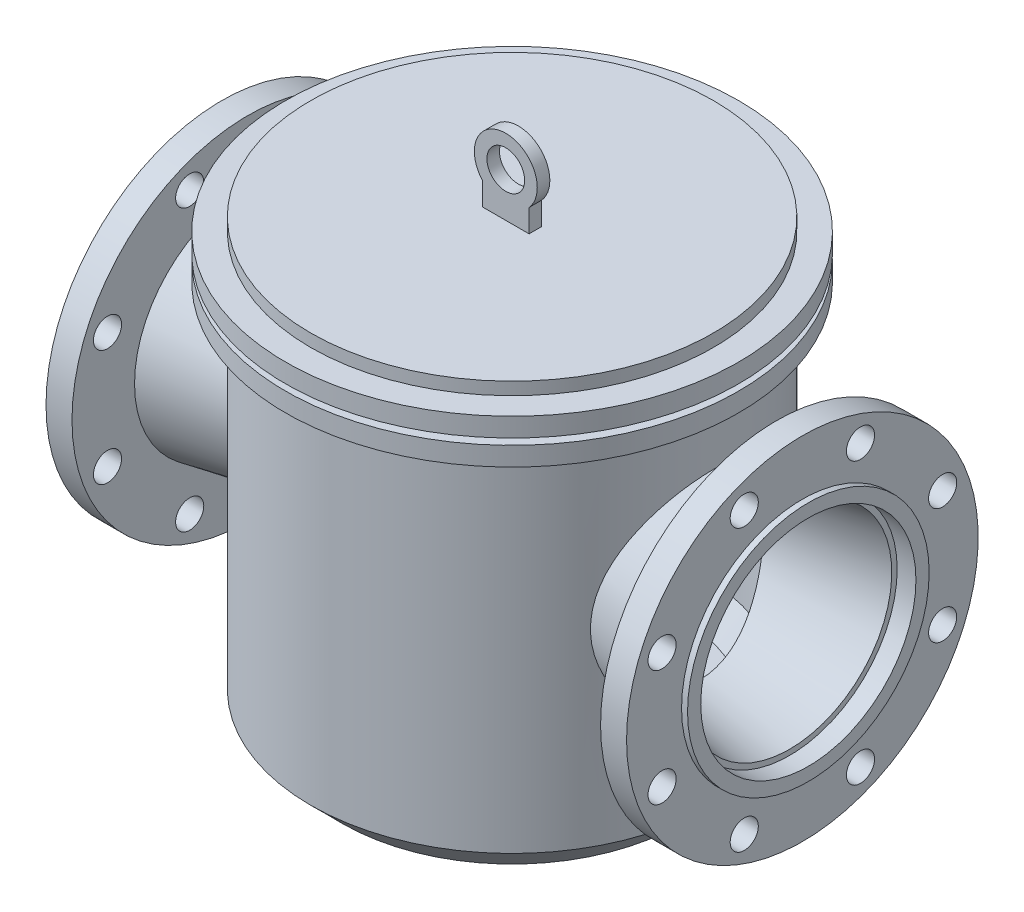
ISO-10303-21;
HEADER;
FILE_DESCRIPTION(('STEP AP214'),'2;1');
FILE_NAME('part.step','',(''),(''),'','','');
FILE_SCHEMA(('AUTOMOTIVE_DESIGN { 1 0 10303 214 1 1 1 1 }'));
ENDSEC;
DATA;
#1=APPLICATION_CONTEXT('core data for automotive mechanical design processes');
#2=APPLICATION_PROTOCOL_DEFINITION('international standard','automotive_design',2000,#1);
#3=PRODUCT_CONTEXT('',#1,'mechanical');
#4=PRODUCT('Part','Part','',(#3));
#5=PRODUCT_RELATED_PRODUCT_CATEGORY('part','',(#4));
#6=PRODUCT_DEFINITION_FORMATION('','',#4);
#7=PRODUCT_DEFINITION_CONTEXT('part definition',#1,'design');
#8=PRODUCT_DEFINITION('design','',#6,#7);
#9=PRODUCT_DEFINITION_SHAPE('','',#8);
#10=(LENGTH_UNIT() NAMED_UNIT(*) SI_UNIT(.MILLI.,.METRE.));
#11=(NAMED_UNIT(*) PLANE_ANGLE_UNIT() SI_UNIT($,.RADIAN.));
#12=(NAMED_UNIT(*) SI_UNIT($,.STERADIAN.) SOLID_ANGLE_UNIT());
#13=UNCERTAINTY_MEASURE_WITH_UNIT(LENGTH_MEASURE(1.E-05),#10,'distance_accuracy_value','');
#14=(GEOMETRIC_REPRESENTATION_CONTEXT(3) GLOBAL_UNCERTAINTY_ASSIGNED_CONTEXT((#13)) GLOBAL_UNIT_ASSIGNED_CONTEXT((#10,
#11,#12)) REPRESENTATION_CONTEXT('',''));
#15=CARTESIAN_POINT('',(0.,0.,0.));
#16=DIRECTION('',(0.,0.,1.));
#17=DIRECTION('',(1.,0.,0.));
#18=AXIS2_PLACEMENT_3D('',#15,#16,#17);
#19=CARTESIAN_POINT('',(235.4,96.,0.));
#20=DIRECTION('',(1.,0.,0.));
#21=DIRECTION('',(0.,0.,-1.));
#22=AXIS2_PLACEMENT_3D('',#19,#20,#21);
#23=PLANE('',#22);
#24=CARTESIAN_POINT('',(235.4,0.,0.));
#25=DIRECTION('',(-1.,0.,0.));
#26=DIRECTION('',(0.,0.,1.));
#27=AXIS2_PLACEMENT_3D('',#24,#25,#26);
#28=CIRCLE('',#27,96.);
#29=CARTESIAN_POINT('',(235.4,0.,96.));
#30=VERTEX_POINT('',#29);
#31=EDGE_CURVE('E573',#30,#30,#28,.T.);
#32=ORIENTED_EDGE('',*,*,#31,.F.);
#33=EDGE_LOOP('',(#32));
#34=FACE_BOUND('',#33,.T.);
#35=CARTESIAN_POINT('',(235.4,0.,0.));
#36=DIRECTION('',(1.,0.,0.));
#37=DIRECTION('',(0.,0.,-1.));
#38=AXIS2_PLACEMENT_3D('',#35,#36,#37);
#39=CIRCLE('',#38,85.5);
#40=CARTESIAN_POINT('',(235.4,0.,-85.5));
#41=VERTEX_POINT('',#40);
#42=EDGE_CURVE('E610',#41,#41,#39,.F.);
#43=ORIENTED_EDGE('',*,*,#42,.T.);
#44=EDGE_LOOP('',(#43));
#45=FACE_BOUND('',#44,.T.);
#46=ADVANCED_FACE('F34',(#34,#45),#23,.T.);
#47=CARTESIAN_POINT('',(0.,-64.0794081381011,0.));
#48=DIRECTION('',(0.,-1.,0.));
#49=DIRECTION('',(0.,0.,-1.));
#50=AXIS2_PLACEMENT_3D('',#47,#48,#49);
#51=CYLINDRICAL_SURFACE('',#50,160.);
#52=CARTESIAN_POINT('',(0.,150.,0.));
#53=DIRECTION('',(0.,-1.,0.));
#54=DIRECTION('',(0.,0.,-1.));
#55=AXIS2_PLACEMENT_3D('',#52,#53,#54);
#56=CIRCLE('',#55,160.);
#57=CARTESIAN_POINT('',(0.,150.,-160.));
#58=VERTEX_POINT('',#57);
#59=EDGE_CURVE('E428',#58,#58,#56,.F.);
#60=ORIENTED_EDGE('',*,*,#59,.F.);
#61=EDGE_LOOP('',(#60));
#62=FACE_BOUND('',#61,.T.);
#63=CARTESIAN_POINT('',(0.,145.,0.));
#64=DIRECTION('',(0.,-1.,0.));
#65=DIRECTION('',(0.,0.,-1.));
#66=AXIS2_PLACEMENT_3D('',#63,#64,#65);
#67=CIRCLE('',#66,160.);
#68=CARTESIAN_POINT('',(0.,145.,-160.));
#69=VERTEX_POINT('',#68);
#70=EDGE_CURVE('E396',#69,#69,#67,.T.);
#71=ORIENTED_EDGE('',*,*,#70,.F.);
#72=EDGE_LOOP('',(#71));
#73=FACE_BOUND('',#72,.T.);
#74=ADVANCED_FACE('F313',(#62,#73),#51,.T.);
#75=CARTESIAN_POINT('',(160.,150.,0.));
#76=DIRECTION('',(0.,-1.,0.));
#77=DIRECTION('',(0.,0.,-1.));
#78=AXIS2_PLACEMENT_3D('',#75,#76,#77);
#79=PLANE('',#78);
#80=CARTESIAN_POINT('',(0.,150.,0.));
#81=DIRECTION('',(0.,-1.,0.));
#82=DIRECTION('',(0.,0.,-1.));
#83=AXIS2_PLACEMENT_3D('',#80,#81,#82);
#84=CIRCLE('',#83,180.);
#85=CARTESIAN_POINT('',(0.,150.,-180.));
#86=VERTEX_POINT('',#85);
#87=EDGE_CURVE('E411',#86,#86,#84,.T.);
#88=ORIENTED_EDGE('',*,*,#87,.T.);
#89=EDGE_LOOP('',(#88));
#90=FACE_BOUND('',#89,.T.);
#91=ORIENTED_EDGE('',*,*,#59,.T.);
#92=EDGE_LOOP('',(#91));
#93=FACE_BOUND('',#92,.T.);
#94=ADVANCED_FACE('F367',(#90,#93),#79,.T.);
#95=CARTESIAN_POINT('',(0.,0.,0.));
#96=DIRECTION('',(0.,-1.,0.));
#97=DIRECTION('',(0.,0.,-1.));
#98=AXIS2_PLACEMENT_3D('',#95,#96,#97);
#99=CYLINDRICAL_SURFACE('',#98,180.);
#100=ORIENTED_EDGE('',*,*,#87,.F.);
#101=EDGE_LOOP('',(#100));
#102=FACE_BOUND('',#101,.T.);
#103=CARTESIAN_POINT('',(0.,165.,0.));
#104=DIRECTION('',(0.,-1.,0.));
#105=DIRECTION('',(0.,0.,-1.));
#106=AXIS2_PLACEMENT_3D('',#103,#104,#105);
#107=CIRCLE('',#106,180.);
#108=CARTESIAN_POINT('',(0.,165.,-180.));
#109=VERTEX_POINT('',#108);
#110=EDGE_CURVE('E408',#109,#109,#107,.T.);
#111=ORIENTED_EDGE('',*,*,#110,.T.);
#112=EDGE_LOOP('',(#111));
#113=FACE_BOUND('',#112,.T.);
#114=ADVANCED_FACE('F370',(#102,#113),#99,.T.);
#115=CARTESIAN_POINT('',(160.,165.,0.));
#116=DIRECTION('',(0.,-1.,0.));
#117=DIRECTION('',(0.,0.,-1.));
#118=AXIS2_PLACEMENT_3D('',#115,#116,#117);
#119=PLANE('',#118);
#120=ORIENTED_EDGE('',*,*,#110,.F.);
#121=EDGE_LOOP('',(#120));
#122=FACE_BOUND('',#121,.T.);
#123=CARTESIAN_POINT('',(0.,165.,0.));
#124=DIRECTION('',(0.,-1.,0.));
#125=DIRECTION('',(0.,0.,-1.));
#126=AXIS2_PLACEMENT_3D('',#123,#124,#125);
#127=CIRCLE('',#126,160.);
#128=CARTESIAN_POINT('',(0.,165.,-160.));
#129=VERTEX_POINT('',#128);
#130=EDGE_CURVE('E399',#129,#129,#127,.T.);
#131=ORIENTED_EDGE('',*,*,#130,.T.);
#132=EDGE_LOOP('',(#131));
#133=FACE_BOUND('',#132,.T.);
#134=ADVANCED_FACE('F374',(#122,#133),#119,.F.);
#135=CARTESIAN_POINT('',(160.,175.,0.));
#136=DIRECTION('',(0.,1.,0.));
#137=DIRECTION('',(0.,0.,1.));
#138=AXIS2_PLACEMENT_3D('',#135,#136,#137);
#139=PLANE('',#138);
#140=DIRECTION('',(0.,0.,-1.));
#141=VECTOR('',#140,1.);
#142=CARTESIAN_POINT('',(-18.5,175.,5.));
#143=LINE('',#142,#141);
#144=CARTESIAN_POINT('',(-18.5,175.,5.));
#145=VERTEX_POINT('',#144);
#146=CARTESIAN_POINT('',(-18.5,175.,-5.));
#147=VERTEX_POINT('',#146);
#148=EDGE_CURVE('E118',#145,#147,#143,.T.);
#149=ORIENTED_EDGE('',*,*,#148,.T.);
#150=DIRECTION('',(1.,0.,0.));
#151=VECTOR('',#150,1.);
#152=CARTESIAN_POINT('',(-18.5,175.,-5.));
#153=LINE('',#152,#151);
#154=CARTESIAN_POINT('',(18.5,175.,-5.));
#155=VERTEX_POINT('',#154);
#156=EDGE_CURVE('E102',#147,#155,#153,.T.);
#157=ORIENTED_EDGE('',*,*,#156,.T.);
#158=DIRECTION('',(0.,0.,-1.));
#159=VECTOR('',#158,1.);
#160=CARTESIAN_POINT('',(18.5,175.,5.));
#161=LINE('',#160,#159);
#162=CARTESIAN_POINT('',(18.5,175.,5.));
#163=VERTEX_POINT('',#162);
#164=EDGE_CURVE('E95',#163,#155,#161,.T.);
#165=ORIENTED_EDGE('',*,*,#164,.F.);
#166=DIRECTION('',(1.,0.,0.));
#167=VECTOR('',#166,1.);
#168=CARTESIAN_POINT('',(-18.5,175.,5.));
#169=LINE('',#168,#167);
#170=EDGE_CURVE('E86',#145,#163,#169,.T.);
#171=ORIENTED_EDGE('',*,*,#170,.F.);
#172=EDGE_LOOP('',(#149,#157,#165,#171));
#173=FACE_BOUND('',#172,.T.);
#174=CARTESIAN_POINT('',(0.,175.,0.));
#175=DIRECTION('',(0.,-1.,0.));
#176=DIRECTION('',(0.,0.,-1.));
#177=AXIS2_PLACEMENT_3D('',#174,#175,#176);
#178=CIRCLE('',#177,160.);
#179=CARTESIAN_POINT('',(0.,175.,-160.));
#180=VERTEX_POINT('',#179);
#181=EDGE_CURVE('E426',#180,#180,#178,.T.);
#182=ORIENTED_EDGE('',*,*,#181,.F.);
#183=EDGE_LOOP('',(#182));
#184=FACE_BOUND('',#183,.T.);
#185=ADVANCED_FACE('F36',(#173,#184),#139,.T.);
#186=ORIENTED_EDGE('',*,*,#181,.T.);
#187=EDGE_LOOP('',(#186));
#188=FACE_BOUND('',#187,.T.);
#189=ORIENTED_EDGE('',*,*,#130,.F.);
#190=EDGE_LOOP('',(#189));
#191=FACE_BOUND('',#190,.T.);
#192=ADVANCED_FACE('F350',(#188,#191),#51,.T.);
#193=CARTESIAN_POINT('',(160.,130.,0.));
#194=DIRECTION('',(0.,-1.,0.));
#195=DIRECTION('',(0.,0.,-1.));
#196=AXIS2_PLACEMENT_3D('',#193,#194,#195);
#197=PLANE('',#196);
#198=CARTESIAN_POINT('',(0.,130.,0.));
#199=DIRECTION('',(0.,-1.,0.));
#200=DIRECTION('',(0.,0.,-1.));
#201=AXIS2_PLACEMENT_3D('',#198,#199,#200);
#202=CIRCLE('',#201,180.);
#203=CARTESIAN_POINT('',(0.,130.,-180.));
#204=VERTEX_POINT('',#203);
#205=EDGE_CURVE('E392',#204,#204,#202,.T.);
#206=ORIENTED_EDGE('',*,*,#205,.T.);
#207=EDGE_LOOP('',(#206));
#208=FACE_BOUND('',#207,.T.);
#209=CARTESIAN_POINT('',(0.,130.,0.));
#210=DIRECTION('',(0.,-1.,0.));
#211=DIRECTION('',(0.,0.,-1.));
#212=AXIS2_PLACEMENT_3D('',#209,#210,#211);
#213=CIRCLE('',#212,160.);
#214=CARTESIAN_POINT('',(0.,130.,-160.));
#215=VERTEX_POINT('',#214);
#216=EDGE_CURVE('E343',#215,#215,#213,.F.);
#217=ORIENTED_EDGE('',*,*,#216,.T.);
#218=EDGE_LOOP('',(#217));
#219=FACE_BOUND('',#218,.T.);
#220=ADVANCED_FACE('F379',(#208,#219),#197,.T.);
#221=CARTESIAN_POINT('',(0.,0.,0.));
#222=DIRECTION('',(0.,-1.,0.));
#223=DIRECTION('',(0.,0.,-1.));
#224=AXIS2_PLACEMENT_3D('',#221,#222,#223);
#225=CYLINDRICAL_SURFACE('',#224,180.);
#226=ORIENTED_EDGE('',*,*,#205,.F.);
#227=EDGE_LOOP('',(#226));
#228=FACE_BOUND('',#227,.T.);
#229=CARTESIAN_POINT('',(0.,145.,0.));
#230=DIRECTION('',(0.,-1.,0.));
#231=DIRECTION('',(0.,0.,-1.));
#232=AXIS2_PLACEMENT_3D('',#229,#230,#231);
#233=CIRCLE('',#232,180.);
#234=CARTESIAN_POINT('',(0.,145.,-180.));
#235=VERTEX_POINT('',#234);
#236=EDGE_CURVE('E395',#235,#235,#233,.T.);
#237=ORIENTED_EDGE('',*,*,#236,.T.);
#238=EDGE_LOOP('',(#237));
#239=FACE_BOUND('',#238,.T.);
#240=ADVANCED_FACE('F381',(#228,#239),#225,.T.);
#241=CARTESIAN_POINT('',(160.,145.,0.));
#242=DIRECTION('',(0.,-1.,0.));
#243=DIRECTION('',(0.,0.,-1.));
#244=AXIS2_PLACEMENT_3D('',#241,#242,#243);
#245=PLANE('',#244);
#246=ORIENTED_EDGE('',*,*,#236,.F.);
#247=EDGE_LOOP('',(#246));
#248=FACE_BOUND('',#247,.T.);
#249=ORIENTED_EDGE('',*,*,#70,.T.);
#250=EDGE_LOOP('',(#249));
#251=FACE_BOUND('',#250,.T.);
#252=ADVANCED_FACE('F336',(#248,#251),#245,.F.);
#253=CARTESIAN_POINT('',(0.,-185.,0.));
#254=DIRECTION('',(0.,-1.,0.));
#255=DIRECTION('',(0.,0.,-1.));
#256=AXIS2_PLACEMENT_3D('',#253,#254,#255);
#257=PLANE('',#256);
#258=CARTESIAN_POINT('',(0.,-185.,0.));
#259=DIRECTION('',(0.,-1.,0.));
#260=DIRECTION('',(0.,0.,-1.));
#261=AXIS2_PLACEMENT_3D('',#258,#259,#260);
#262=CIRCLE('',#261,50.);
#263=CARTESIAN_POINT('',(0.,-185.,-50.));
#264=VERTEX_POINT('',#263);
#265=EDGE_CURVE('E414',#264,#264,#262,.T.);
#266=ORIENTED_EDGE('',*,*,#265,.T.);
#267=EDGE_LOOP('',(#266));
#268=FACE_BOUND('',#267,.T.);
#269=ADVANCED_FACE('F362',(#268),#257,.T.);
#270=CARTESIAN_POINT('',(0.,-64.0794081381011,0.));
#271=DIRECTION('',(0.,-1.,0.));
#272=DIRECTION('',(0.,0.,-1.));
#273=AXIS2_PLACEMENT_3D('',#270,#271,#272);
#274=CYLINDRICAL_SURFACE('',#273,50.);
#275=CARTESIAN_POINT('',(0.,-175.,0.));
#276=DIRECTION('',(0.,-1.,0.));
#277=DIRECTION('',(0.,0.,-1.));
#278=AXIS2_PLACEMENT_3D('',#275,#276,#277);
#279=CIRCLE('',#278,50.);
#280=CARTESIAN_POINT('',(0.,-175.,-50.));
#281=VERTEX_POINT('',#280);
#282=EDGE_CURVE('E417',#281,#281,#279,.T.);
#283=ORIENTED_EDGE('',*,*,#282,.T.);
#284=EDGE_LOOP('',(#283));
#285=FACE_BOUND('',#284,.T.);
#286=ORIENTED_EDGE('',*,*,#265,.F.);
#287=EDGE_LOOP('',(#286));
#288=FACE_BOUND('',#287,.T.);
#289=ADVANCED_FACE('F358',(#285,#288),#274,.T.);
#290=CARTESIAN_POINT('',(50.,-175.,0.));
#291=DIRECTION('',(0.,-1.,0.));
#292=DIRECTION('',(0.,0.,-1.));
#293=AXIS2_PLACEMENT_3D('',#290,#291,#292);
#294=PLANE('',#293);
#295=CARTESIAN_POINT('',(0.,-175.,0.));
#296=DIRECTION('',(0.,-1.,0.));
#297=DIRECTION('',(0.,0.,-1.));
#298=AXIS2_PLACEMENT_3D('',#295,#296,#297);
#299=CIRCLE('',#298,135.);
#300=CARTESIAN_POINT('',(0.,-175.,-135.));
#301=VERTEX_POINT('',#300);
#302=EDGE_CURVE('E420',#301,#301,#299,.T.);
#303=ORIENTED_EDGE('',*,*,#302,.T.);
#304=EDGE_LOOP('',(#303));
#305=FACE_BOUND('',#304,.T.);
#306=ORIENTED_EDGE('',*,*,#282,.F.);
#307=EDGE_LOOP('',(#306));
#308=FACE_BOUND('',#307,.T.);
#309=ADVANCED_FACE('F354',(#305,#308),#294,.T.);
#310=CARTESIAN_POINT('',(0.,-175.,0.));
#311=DIRECTION('',(0.,1.,0.));
#312=DIRECTION('',(0.,0.,1.));
#313=AXIS2_PLACEMENT_3D('',#310,#311,#312);
#314=CONICAL_SURFACE('',#313,135.,0.78539816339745);
#315=CARTESIAN_POINT('',(0.,-150.,0.));
#316=DIRECTION('',(0.,-1.,0.));
#317=DIRECTION('',(0.,0.,-1.));
#318=AXIS2_PLACEMENT_3D('',#315,#316,#317);
#319=CIRCLE('',#318,160.);
#320=CARTESIAN_POINT('',(0.,-150.,-160.));
#321=VERTEX_POINT('',#320);
#322=EDGE_CURVE('E423',#321,#321,#319,.T.);
#323=ORIENTED_EDGE('',*,*,#322,.T.);
#324=EDGE_LOOP('',(#323));
#325=FACE_BOUND('',#324,.T.);
#326=ORIENTED_EDGE('',*,*,#302,.F.);
#327=EDGE_LOOP('',(#326));
#328=FACE_BOUND('',#327,.T.);
#329=ADVANCED_FACE('F348',(#325,#328),#314,.T.);
#330=CARTESIAN_POINT('',(-149.303577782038,-54.5863080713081,-57.5190547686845));
#331=CARTESIAN_POINT('',(-149.855940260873,-56.238611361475,-56.0852695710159));
#332=CARTESIAN_POINT('',(-150.410648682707,-57.8315781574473,-54.5838062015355));
#333=CARTESIAN_POINT('',(-151.510773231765,-60.8894292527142,-51.451353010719));
#334=CARTESIAN_POINT('',(-152.056185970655,-62.3542676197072,-49.8203171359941));
#335=CARTESIAN_POINT('',(-153.124456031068,-65.1472791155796,-46.4333880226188));
#336=CARTESIAN_POINT('',(-153.647274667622,-66.4752228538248,-44.6772932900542));
#337=CARTESIAN_POINT('',(-154.655704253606,-68.9808814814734,-41.050608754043));
#338=CARTESIAN_POINT('',(-155.141318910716,-70.1586113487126,-39.1800303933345));
#339=CARTESIAN_POINT('',(-155.83289909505,-71.8064235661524,-36.2918145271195));
#340=CARTESIAN_POINT('',(-156.057804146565,-72.3370804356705,-35.3127853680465));
#341=CARTESIAN_POINT('',(-156.493277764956,-73.3561711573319,-33.3299214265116));
#342=CARTESIAN_POINT('',(-156.703847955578,-73.8446097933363,-32.3260894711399));
#343=CARTESIAN_POINT('',(-157.109144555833,-74.7779334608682,-30.2950390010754));
#344=CARTESIAN_POINT('',(-157.303868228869,-75.2228109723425,-29.2678164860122));
#345=CARTESIAN_POINT('',(-157.675946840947,-76.067489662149,-27.1920462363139));
#346=CARTESIAN_POINT('',(-157.853303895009,-76.4672963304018,-26.1435011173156));
#347=CARTESIAN_POINT('',(-158.18913312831,-77.220184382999,-24.0279848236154));
#348=CARTESIAN_POINT('',(-158.347623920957,-77.573311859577,-22.9610330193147));
#349=CARTESIAN_POINT('',(-158.644649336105,-78.2320232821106,-20.8099470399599));
#350=CARTESIAN_POINT('',(-158.78318639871,-78.5376130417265,-19.7258149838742));
#351=CARTESIAN_POINT('',(-159.039195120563,-79.1001523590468,-17.5425872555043));
#352=CARTESIAN_POINT('',(-159.156667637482,-79.3571038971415,-16.4434921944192));
#353=CARTESIAN_POINT('',(-159.369574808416,-79.8213770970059,-14.2327669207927));
#354=CARTESIAN_POINT('',(-159.465010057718,-80.028700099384,-13.1211370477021));
#355=CARTESIAN_POINT('',(-159.624605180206,-80.3746077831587,-11.0000163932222));
#356=CARTESIAN_POINT('',(-159.690942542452,-80.518002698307,-9.99147069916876));
#357=CARTESIAN_POINT('',(-159.804675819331,-80.7634846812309,-7.96820211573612));
#358=CARTESIAN_POINT('',(-159.852070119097,-80.865568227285,-6.95347870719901));
#359=CARTESIAN_POINT('',(-159.927568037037,-81.0280432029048,-4.92014840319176));
#360=CARTESIAN_POINT('',(-159.955674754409,-81.0884413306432,-3.90154215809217));
#361=CARTESIAN_POINT('',(-159.992412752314,-81.1673660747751,-1.86225006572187));
#362=CARTESIAN_POINT('',(-160.001042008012,-81.1858883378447,-0.841564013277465));
#363=CARTESIAN_POINT('',(-159.998757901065,-81.1809839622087,1.19941625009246));
#364=CARTESIAN_POINT('',(-159.987849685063,-81.1575683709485,2.21971049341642));
#365=CARTESIAN_POINT('',(-159.94657814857,-81.0688917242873,4.25808903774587));
#366=CARTESIAN_POINT('',(-159.916214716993,-81.0036304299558,5.27617332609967));
#367=CARTESIAN_POINT('',(-159.836248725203,-80.8314915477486,7.30802798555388));
#368=CARTESIAN_POINT('',(-159.786646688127,-80.7246150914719,8.32179847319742));
#369=CARTESIAN_POINT('',(-159.668552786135,-80.4696138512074,10.3430221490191));
#370=CARTESIAN_POINT('',(-159.600061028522,-80.3214893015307,11.3504753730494));
#371=CARTESIAN_POINT('',(-159.449772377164,-79.9955686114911,13.2911194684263));
#372=CARTESIAN_POINT('',(-159.369146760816,-79.8203645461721,14.2248368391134));
#373=CARTESIAN_POINT('',(-159.192310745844,-79.4348931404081,16.0835413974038));
#374=CARTESIAN_POINT('',(-159.096099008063,-79.2246227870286,17.0085278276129));
#375=CARTESIAN_POINT('',(-158.78493158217,-78.5421065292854,19.7678664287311));
#376=CARTESIAN_POINT('',(-158.547397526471,-78.0180560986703,21.5871872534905));
#377=CARTESIAN_POINT('',(-158.017602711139,-76.8374271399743,25.1739143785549));
#378=CARTESIAN_POINT('',(-157.725337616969,-76.180838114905,26.9413165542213));
#379=CARTESIAN_POINT('',(-157.092471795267,-74.7413249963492,30.4149985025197));
#380=CARTESIAN_POINT('',(-156.75186860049,-73.9583944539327,32.121275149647));
#381=CARTESIAN_POINT('',(-156.010192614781,-72.2279166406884,35.5536936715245));
#382=CARTESIAN_POINT('',(-155.606863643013,-71.273816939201,37.2760418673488));
#383=CARTESIAN_POINT('',(-154.763449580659,-69.2408242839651,40.6358870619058));
#384=CARTESIAN_POINT('',(-154.323363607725,-68.1619283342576,42.2733820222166));
#385=CARTESIAN_POINT('',(-153.415636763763,-65.8867520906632,45.4574999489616));
#386=CARTESIAN_POINT('',(-152.947985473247,-64.6904272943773,47.0040881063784));
#387=CARTESIAN_POINT('',(-151.994923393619,-62.1882792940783,50.0001506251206));
#388=CARTESIAN_POINT('',(-151.509511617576,-60.8824499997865,51.44961957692));
#389=CARTESIAN_POINT('',(-150.473966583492,-58.0110267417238,54.4088160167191));
#390=CARTESIAN_POINT('',(-149.92285688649,-56.4328709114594,55.9060320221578));
#391=CARTESIAN_POINT('',(-148.824595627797,-53.158709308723,58.76724130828));
#392=CARTESIAN_POINT('',(-148.277444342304,-51.4626953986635,60.1312253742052));
#393=CARTESIAN_POINT('',(-147.200822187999,-47.9613501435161,62.7206936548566));
#394=CARTESIAN_POINT('',(-146.67136077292,-46.1559617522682,63.9461046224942));
#395=CARTESIAN_POINT('',(-145.644364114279,-42.4457631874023,66.2518868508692));
#396=CARTESIAN_POINT('',(-145.146829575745,-40.5409508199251,67.3322549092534));
#397=CARTESIAN_POINT('',(-144.419914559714,-37.555295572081,68.8711645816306));
#398=CARTESIAN_POINT('',(-144.174025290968,-36.5061088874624,69.3840642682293));
#399=CARTESIAN_POINT('',(-143.697251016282,-34.3841777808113,70.3661710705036));
#400=CARTESIAN_POINT('',(-143.466364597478,-33.3114355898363,70.8353823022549));
#401=CARTESIAN_POINT('',(-143.021537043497,-31.1439037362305,71.7292774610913));
#402=CARTESIAN_POINT('',(-142.807598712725,-30.0491104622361,72.1539540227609));
#403=CARTESIAN_POINT('',(-142.398631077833,-27.8395804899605,72.9577494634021));
#404=CARTESIAN_POINT('',(-142.20359962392,-26.724846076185,73.3368735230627));
#405=CARTESIAN_POINT('',(-141.83431918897,-24.4778846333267,74.0485418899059));
#406=CARTESIAN_POINT('',(-141.6600590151,-23.3456674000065,74.3811113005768));
#407=CARTESIAN_POINT('',(-141.333879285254,-21.0653683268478,74.9990442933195));
#408=CARTESIAN_POINT('',(-141.18195730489,-19.9172882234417,75.2844129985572));
#409=CARTESIAN_POINT('',(-140.901932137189,-17.6074053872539,75.8072125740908));
#410=CARTESIAN_POINT('',(-140.77382849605,-16.4456029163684,76.0446443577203));
#411=CARTESIAN_POINT('',(-140.542738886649,-14.1106404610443,76.4708922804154));
#412=CARTESIAN_POINT('',(-140.439752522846,-12.9374806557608,76.6597091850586));
#413=CARTESIAN_POINT('',(-140.265551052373,-10.6554634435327,76.9779577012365));
#414=CARTESIAN_POINT('',(-140.192759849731,-9.54713815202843,77.1103494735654));
#415=CARTESIAN_POINT('',(-140.070889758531,-7.32484717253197,77.3315059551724));
#416=CARTESIAN_POINT('',(-140.021810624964,-6.2108815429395,77.4202711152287));
#417=CARTESIAN_POINT('',(-139.947830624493,-3.97955552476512,77.5539202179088));
#418=CARTESIAN_POINT('',(-139.922928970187,-2.8621952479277,77.5988055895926));
#419=CARTESIAN_POINT('',(-139.897538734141,-0.626292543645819,77.6445706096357));
#420=CARTESIAN_POINT('',(-139.897050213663,0.492249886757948,77.6454501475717));
#421=CARTESIAN_POINT('',(-139.920489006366,2.72804350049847,77.603204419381));
#422=CARTESIAN_POINT('',(-139.944411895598,3.84529488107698,77.5600871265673));
#423=CARTESIAN_POINT('',(-140.01643834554,6.07645753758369,77.4299845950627));
#424=CARTESIAN_POINT('',(-140.064541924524,7.190368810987,77.3429993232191));
#425=CARTESIAN_POINT('',(-140.184472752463,9.4126129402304,77.1254109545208));
#426=CARTESIAN_POINT('',(-140.256299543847,10.5209459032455,76.9948086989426));
#427=CARTESIAN_POINT('',(-140.423005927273,12.7298966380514,76.690348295));
#428=CARTESIAN_POINT('',(-140.51788527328,13.8305144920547,76.5164906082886));
#429=CARTESIAN_POINT('',(-140.723609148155,15.9576930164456,76.1374382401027));
#430=CARTESIAN_POINT('',(-140.833190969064,16.9848112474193,75.9346794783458));
#431=CARTESIAN_POINT('',(-141.071147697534,19.0288175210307,75.4916849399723));
#432=CARTESIAN_POINT('',(-141.199524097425,20.0457047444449,75.2514461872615));
#433=CARTESIAN_POINT('',(-141.474054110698,22.0674704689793,74.7340470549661));
#434=CARTESIAN_POINT('',(-141.620205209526,23.0723506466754,74.45689189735));
#435=CARTESIAN_POINT('',(-141.929193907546,25.0687910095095,73.8661955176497));
#436=CARTESIAN_POINT('',(-142.09203299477,26.0603499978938,73.5526510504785));
#437=CARTESIAN_POINT('',(-142.603877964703,29.0132007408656,72.5581925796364));
#438=CARTESIAN_POINT('',(-142.97621282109,30.9526754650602,71.8234511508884));
#439=CARTESIAN_POINT('',(-143.772583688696,34.7621815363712,70.2157254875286));
#440=CARTESIAN_POINT('',(-144.196622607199,36.632208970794,69.3427334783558));
#441=CARTESIAN_POINT('',(-145.112631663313,40.4063963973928,67.4057927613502));
#442=CARTESIAN_POINT('',(-145.607173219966,42.3056138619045,66.3334154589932));
#443=CARTESIAN_POINT('',(-146.628356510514,46.0059584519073,64.0444782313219));
#444=CARTESIAN_POINT('',(-147.154999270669,47.8070824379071,62.8279136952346));
#445=CARTESIAN_POINT('',(-148.226810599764,51.3028199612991,60.2557424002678));
#446=CARTESIAN_POINT('',(-148.771988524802,52.9973784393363,58.9000647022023));
#447=CARTESIAN_POINT('',(-149.866779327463,56.2697644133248,56.0559544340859));
#448=CARTESIAN_POINT('',(-150.41639236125,57.8475877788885,54.5675171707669));
#449=CARTESIAN_POINT('',(-151.54274280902,60.9782424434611,51.3602542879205));
#450=CARTESIAN_POINT('',(-152.118837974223,62.5223552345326,49.6326793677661));
#451=CARTESIAN_POINT('',(-153.244082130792,65.4549995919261,46.0411782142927));
#452=CARTESIAN_POINT('',(-153.793229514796,66.8435218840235,44.1772438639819));
#453=CARTESIAN_POINT('',(-154.584395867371,68.7992579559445,41.2875701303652));
#454=CARTESIAN_POINT('',(-154.842693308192,69.4299980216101,40.308712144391));
#455=CARTESIAN_POINT('',(-155.346559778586,70.6476512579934,38.3209722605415));
#456=CARTESIAN_POINT('',(-155.592130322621,71.2345696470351,37.3120939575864));
#457=CARTESIAN_POINT('',(-156.068657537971,72.3629606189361,35.2658180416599));
#458=CARTESIAN_POINT('',(-156.299613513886,72.9044310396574,34.2284190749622));
#459=CARTESIAN_POINT('',(-156.745041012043,73.9401846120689,32.127019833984));
#460=CARTESIAN_POINT('',(-156.959514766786,74.4344741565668,31.0630231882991));
#461=CARTESIAN_POINT('',(-157.357924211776,75.3460898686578,28.9748971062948));
#462=CARTESIAN_POINT('',(-157.542920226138,75.7662549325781,27.9522086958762));
#463=CARTESIAN_POINT('',(-157.895433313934,76.5621571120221,25.8868581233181));
#464=CARTESIAN_POINT('',(-158.062952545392,76.9378997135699,24.8441984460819));
#465=CARTESIAN_POINT('',(-158.379266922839,77.64378066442,22.7406913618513));
#466=CARTESIAN_POINT('',(-158.528061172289,77.9739168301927,21.6798430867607));
#467=CARTESIAN_POINT('',(-158.805752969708,78.5874032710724,19.5421219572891));
#468=CARTESIAN_POINT('',(-158.934650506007,78.8707535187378,18.4652490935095));
#469=CARTESIAN_POINT('',(-159.171417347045,79.3894028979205,16.2986631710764));
#470=CARTESIAN_POINT('',(-159.27930417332,79.6247420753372,15.2089616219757));
#471=CARTESIAN_POINT('',(-159.473302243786,80.0467585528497,13.0182575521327));
#472=CARTESIAN_POINT('',(-159.559413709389,80.2334363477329,11.9172551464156));
#473=CARTESIAN_POINT('',(-159.709140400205,80.5573743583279,9.70658255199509));
#474=CARTESIAN_POINT('',(-159.772757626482,80.6946389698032,8.59691314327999));
#475=CARTESIAN_POINT('',(-159.876968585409,80.9192079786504,6.37147129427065));
#476=CARTESIAN_POINT('',(-159.917563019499,81.0065138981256,5.25569904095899));
#477=CARTESIAN_POINT('',(-159.971978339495,81.1234803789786,3.15255005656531));
#478=CARTESIAN_POINT('',(-159.988391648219,81.1587239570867,2.16554597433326));
#479=CARTESIAN_POINT('',(-160.002933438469,81.1899506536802,0.190694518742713));
#480=CARTESIAN_POINT('',(-160.00106048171,81.1859306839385,-0.797152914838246));
#481=CARTESIAN_POINT('',(-159.979039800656,81.1386388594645,-2.77151957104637));
#482=CARTESIAN_POINT('',(-159.958895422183,81.0953741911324,-3.75803900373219));
#483=CARTESIAN_POINT('',(-159.90046796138,80.9697390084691,-5.72814336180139));
#484=CARTESIAN_POINT('',(-159.862183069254,80.8873645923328,-6.71172798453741));
#485=CARTESIAN_POINT('',(-159.76773630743,80.6837953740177,-8.67380548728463));
#486=CARTESIAN_POINT('',(-159.711578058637,80.5626084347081,-9.65229935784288));
#487=CARTESIAN_POINT('',(-159.581744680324,80.2817829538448,-11.6026778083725));
#488=CARTESIAN_POINT('',(-159.508067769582,80.1221405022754,-12.5745617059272));
#489=CARTESIAN_POINT('',(-159.343680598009,79.7649161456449,-14.5097984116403));
#490=CARTESIAN_POINT('',(-159.252971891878,79.5673377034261,-15.4731519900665));
#491=CARTESIAN_POINT('',(-159.055100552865,79.1348356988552,-17.3897604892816));
#492=CARTESIAN_POINT('',(-158.94793637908,78.8999086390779,-18.3430144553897));
#493=CARTESIAN_POINT('',(-158.609647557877,78.1553038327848,-21.1282663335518));
#494=CARTESIAN_POINT('',(-158.356659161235,77.5948748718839,-22.9443556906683));
#495=CARTESIAN_POINT('',(-157.797007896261,76.3418098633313,-26.5213779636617));
#496=CARTESIAN_POINT('',(-157.490346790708,75.6491781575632,-28.2823126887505));
#497=CARTESIAN_POINT('',(-156.829981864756,74.1379965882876,-31.7404412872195));
#498=CARTESIAN_POINT('',(-156.4762712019,73.3194284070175,-33.4376258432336));
#499=CARTESIAN_POINT('',(-155.729231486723,71.5632716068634,-36.7601240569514));
#500=CARTESIAN_POINT('',(-155.33590021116,70.6256763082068,-38.3854336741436));
#501=CARTESIAN_POINT('',(-154.483644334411,68.5561879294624,-41.6887076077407));
#502=CARTESIAN_POINT('',(-154.021985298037,67.4146407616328,-43.3599207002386));
#503=CARTESIAN_POINT('',(-153.071848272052,65.0087027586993,-46.6032794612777));
#504=CARTESIAN_POINT('',(-152.583369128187,63.7443066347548,-48.1754208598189));
#505=CARTESIAN_POINT('',(-151.590021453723,61.1002236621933,-51.2154663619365));
#506=CARTESIAN_POINT('',(-151.085144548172,59.7204773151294,-52.6833159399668));
#507=CARTESIAN_POINT('',(-150.070115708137,56.85410354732,-55.5086857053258));
#508=CARTESIAN_POINT('',(-149.5599635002,55.3674705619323,-56.8662001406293));
#509=CARTESIAN_POINT('',(-148.487778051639,52.1203520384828,-59.6137072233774));
#510=CARTESIAN_POINT('',(-147.926427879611,50.3479350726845,-60.9898997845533));
#511=CARTESIAN_POINT('',(-146.826145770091,46.6901226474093,-63.593085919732));
#512=CARTESIAN_POINT('',(-146.287215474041,44.804718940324,-64.8200685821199));
#513=CARTESIAN_POINT('',(-145.246905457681,40.9305514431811,-67.1187669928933));
#514=CARTESIAN_POINT('',(-144.745534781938,38.941762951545,-68.1904454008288));
#515=CARTESIAN_POINT('',(-144.033201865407,35.8904920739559,-69.6759508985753));
#516=CARTESIAN_POINT('',(-143.802350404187,34.8619143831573,-70.1508383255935));
#517=CARTESIAN_POINT('',(-143.35567920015,32.7834522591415,-71.0591685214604));
#518=CARTESIAN_POINT('',(-143.139857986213,31.7335699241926,-71.4926153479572));
#519=CARTESIAN_POINT('',(-142.719940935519,29.5881601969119,-72.327325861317));
#520=CARTESIAN_POINT('',(-142.516260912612,28.4921444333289,-72.727543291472));
#521=CARTESIAN_POINT('',(-142.128362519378,26.2813552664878,-73.4827106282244));
#522=CARTESIAN_POINT('',(-141.94414208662,25.1665838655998,-73.8376653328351));
#523=CARTESIAN_POINT('',(-141.596815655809,22.9199868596,-74.5015583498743));
#524=CARTESIAN_POINT('',(-141.433712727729,21.7881588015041,-74.8104899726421));
#525=CARTESIAN_POINT('',(-141.130228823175,19.5098542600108,-75.3814503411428));
#526=CARTESIAN_POINT('',(-140.989845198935,18.3633795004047,-75.6434845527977));
#527=CARTESIAN_POINT('',(-140.733252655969,16.058732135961,-76.1198052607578));
#528=CARTESIAN_POINT('',(-140.617026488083,14.9005685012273,-76.3341258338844));
#529=CARTESIAN_POINT('',(-140.409809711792,12.5742431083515,-76.7146158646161));
#530=CARTESIAN_POINT('',(-140.318816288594,11.4060824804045,-76.8807906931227));
#531=CARTESIAN_POINT('',(-140.162991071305,9.06215847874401,-77.1645134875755));
#532=CARTESIAN_POINT('',(-140.09815868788,7.88639527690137,-77.2820625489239));
#533=CARTESIAN_POINT('',(-139.99533701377,5.52983900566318,-77.4681673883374));
#534=CARTESIAN_POINT('',(-139.957347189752,4.34904603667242,-77.5367241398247));
#535=CARTESIAN_POINT('',(-139.910621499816,2.08259780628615,-77.6210024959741));
#536=CARTESIAN_POINT('',(-139.899731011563,0.997129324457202,-77.6406159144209));
#537=CARTESIAN_POINT('',(-139.900979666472,-1.1737478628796,-77.6383662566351));
#538=CARTESIAN_POINT('',(-139.91311858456,-2.25915656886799,-77.6165035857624));
#539=CARTESIAN_POINT('',(-139.960315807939,-4.42779159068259,-77.5313636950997));
#540=CARTESIAN_POINT('',(-139.995372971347,-5.51101801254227,-77.4680885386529));
#541=CARTESIAN_POINT('',(-140.088091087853,-7.67330363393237,-77.3002969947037));
#542=CARTESIAN_POINT('',(-140.145752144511,-8.75236281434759,-77.1957804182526));
#543=CARTESIAN_POINT('',(-140.28319643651,-10.9047769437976,-76.9457285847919));
#544=CARTESIAN_POINT('',(-140.362989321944,-11.9781291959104,-76.8001754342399));
#545=CARTESIAN_POINT('',(-140.54399726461,-14.1168145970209,-76.4684282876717));
#546=CARTESIAN_POINT('',(-140.645214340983,-15.1821469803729,-76.2822304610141));
#547=CARTESIAN_POINT('',(-140.868186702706,-17.3027143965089,-75.8696838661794));
#548=CARTESIAN_POINT('',(-140.989939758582,-18.3579505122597,-75.6433394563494));
#549=CARTESIAN_POINT('',(-141.252984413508,-20.4567666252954,-75.1509964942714));
#550=CARTESIAN_POINT('',(-141.394277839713,-21.5003455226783,-74.8849942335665));
#551=CARTESIAN_POINT('',(-141.691868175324,-23.5507968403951,-74.3203474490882));
#552=CARTESIAN_POINT('',(-141.847756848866,-24.5579672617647,-74.0225702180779));
#553=CARTESIAN_POINT('',(-142.175920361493,-26.5580371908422,-73.3902880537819));
#554=CARTESIAN_POINT('',(-142.34819663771,-27.5509354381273,-73.0557798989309));
#555=CARTESIAN_POINT('',(-142.887732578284,-30.506038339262,-71.9980807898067));
#556=CARTESIAN_POINT('',(-143.277753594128,-32.4450197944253,-71.2206135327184));
#557=CARTESIAN_POINT('',(-144.106941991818,-36.2473552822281,-69.5275187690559));
#558=CARTESIAN_POINT('',(-144.546046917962,-38.1108014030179,-68.6120663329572));
#559=CARTESIAN_POINT('',(-145.462267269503,-41.7554712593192,-66.6476013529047));
#560=CARTESIAN_POINT('',(-145.939371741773,-43.5367184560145,-65.5986272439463));
#561=CARTESIAN_POINT('',(-146.891800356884,-46.90952070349,-63.4359012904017));
#562=CARTESIAN_POINT('',(-147.365656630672,-48.5060958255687,-62.3293172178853));
#563=CARTESIAN_POINT('',(-148.326920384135,-51.6127380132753,-60.0058776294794));
#564=CARTESIAN_POINT('',(-148.814328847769,-53.1227987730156,-58.7890140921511));
#565=CARTESIAN_POINT('',(-149.303577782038,-54.5863080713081,-57.5190547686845));
#566=B_SPLINE_CURVE_WITH_KNOTS('',3,(#330,#331,#332,#333,#334,#335,#336,#337,#338,#339,#340,
#341,#342,#343,#344,#345,#346,#347,#348,#349,#350,#351,#352,#353,#354,#355,#356,#357,#358,#359,
#360,#361,#362,#363,#364,#365,#366,#367,#368,#369,#370,#371,#372,#373,#374,#375,#376,#377,#378,
#379,#380,#381,#382,#383,#384,#385,#386,#387,#388,#389,#390,#391,#392,#393,#394,#395,#396,#397,
#398,#399,#400,#401,#402,#403,#404,#405,#406,#407,#408,#409,#410,#411,#412,#413,#414,#415,#416,
#417,#418,#419,#420,#421,#422,#423,#424,#425,#426,#427,#428,#429,#430,#431,#432,#433,#434,#435,
#436,#437,#438,#439,#440,#441,#442,#443,#444,#445,#446,#447,#448,#449,#450,#451,#452,#453,#454,
#455,#456,#457,#458,#459,#460,#461,#462,#463,#464,#465,#466,#467,#468,#469,#470,#471,#472,#473,
#474,#475,#476,#477,#478,#479,#480,#481,#482,#483,#484,#485,#486,#487,#488,#489,#490,#491,#492,
#493,#494,#495,#496,#497,#498,#499,#500,#501,#502,#503,#504,#505,#506,#507,#508,#509,#510,#511,
#512,#513,#514,#515,#516,#517,#518,#519,#520,#521,#522,#523,#524,#525,#526,#527,#528,#529,#530,
#531,#532,#533,#534,#535,#536,#537,#538,#539,#540,#541,#542,#543,#544,#545,#546,#547,#548,#549,
#550,#551,#552,#553,#554,#555,#556,#557,#558,#559,#560,#561,#562,#563,#564,#565),.UNSPECIFIED.,
.T.,.F.,(4,2,2,2,2,2,2,2,2,2,2,2,2,2,2,2,2,2,2,2,2,2,2,2,2,2,2,2,2,2,2,2,2,2,2,2,2,2,2,2,2,2,2,
2,2,2,2,2,2,2,2,2,2,2,2,2,2,2,2,2,2,2,2,2,2,2,2,2,2,2,2,2,2,2,2,2,2,2,2,2,2,2,2,2,2,2,2,2,2,2,2,
2,2,2,2,2,2,2,2,2,2,2,2,2,2,2,2,2,2,2,2,2,2,2,2,2,2,4),(0.,6.76733813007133,13.5370924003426,
20.3180122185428,27.0982553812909,30.5055522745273,33.9124625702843,37.3199599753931,
40.7270418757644,44.1307339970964,47.5340095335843,50.9371464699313,54.3401914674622,
57.4017269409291,60.4635233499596,63.5248276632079,66.5864502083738,69.6472663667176,
72.7081000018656,75.7688504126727,78.8295834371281,81.68902243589,84.5487072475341,
90.2662840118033,95.9843137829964,101.702635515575,107.725925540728,113.749360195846,
119.775086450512,125.80114805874,132.526176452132,139.251669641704,145.980701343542,
152.709881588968,156.289284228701,159.868349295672,163.448005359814,167.027253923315,
170.604564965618,174.181487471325,177.758341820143,181.335139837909,184.689769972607,
188.044365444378,191.398851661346,194.753346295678,198.107233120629,201.46112248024,
204.814947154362,208.168736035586,211.325827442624,214.483169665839,217.640065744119,
220.797243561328,227.111570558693,233.426252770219,240.128279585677,246.83052077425,
253.53619684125,260.242110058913,267.396217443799,274.5507510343,278.128050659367,
281.704923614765,285.281966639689,288.858524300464,292.220379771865,295.581819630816,
298.943420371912,302.305023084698,305.663810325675,309.022563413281,312.381017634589,
315.739369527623,318.701752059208,321.6643675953,324.626440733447,327.588809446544,
330.550578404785,333.51264863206,336.474448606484,339.436526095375,345.181764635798,
350.926814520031,356.672700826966,362.418909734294,368.640058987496,374.861476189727,
381.086122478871,387.311093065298,394.242564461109,401.174542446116,408.10818436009,
411.575915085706,415.043305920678,418.595491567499,422.147300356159,425.699624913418,
429.25153517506,432.800900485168,436.34986969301,439.898758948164,443.447577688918,
446.703659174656,449.959708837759,453.215596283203,456.471498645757,459.728822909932,
462.986454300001,466.243732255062,469.501314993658,472.68573518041,475.870434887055,
482.238678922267,488.598910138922,494.957314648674,500.950972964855,506.945067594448),.UNSPECIFIED.);
#567=CARTESIAN_POINT('',(-149.303577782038,-54.5863080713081,-57.5190547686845));
#568=VERTEX_POINT('',#567);
#569=EDGE_CURVE('E11',#568,#568,#566,.T.);
#570=ORIENTED_EDGE('',*,*,#569,.F.);
#571=EDGE_LOOP('',(#570));
#572=FACE_BOUND('',#571,.T.);
#573=CARTESIAN_POINT('',(149.303577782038,-54.5863080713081,-57.5190547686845));
#574=CARTESIAN_POINT('',(148.730907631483,-52.8732555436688,-59.0055428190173));
#575=CARTESIAN_POINT('',(148.160639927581,-51.0960539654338,-60.4195925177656));
#576=CARTESIAN_POINT('',(147.040751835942,-47.4238293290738,-63.0961485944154));
#577=CARTESIAN_POINT('',(146.49114137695,-45.5287507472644,-64.3585827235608));
#578=CARTESIAN_POINT('',(145.427534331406,-41.6277146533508,-66.7272165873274));
#579=CARTESIAN_POINT('',(144.913612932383,-39.6215381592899,-67.8330912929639));
#580=CARTESIAN_POINT('',(144.182404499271,-36.5413546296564,-69.3668134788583));
#581=CARTESIAN_POINT('',(143.945264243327,-35.5027259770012,-69.8572381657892));
#582=CARTESIAN_POINT('',(143.486074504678,-33.4032234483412,-70.7956164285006));
#583=CARTESIAN_POINT('',(143.264023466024,-32.3423518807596,-71.2435743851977));
#584=CARTESIAN_POINT('',(142.836229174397,-30.1967835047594,-72.0974366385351));
#585=CARTESIAN_POINT('',(142.630536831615,-29.1120247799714,-72.5032107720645));
#586=CARTESIAN_POINT('',(142.23801377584,-26.923650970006,-73.2702740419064));
#587=CARTESIAN_POINT('',(142.051181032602,-25.8200379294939,-73.6315679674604));
#588=CARTESIAN_POINT('',(141.698017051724,-23.5955866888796,-74.308935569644));
#589=CARTESIAN_POINT('',(141.531688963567,-22.4747458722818,-74.6250023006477));
#590=CARTESIAN_POINT('',(141.22114239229,-20.2181761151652,-75.2110292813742));
#591=CARTESIAN_POINT('',(141.076921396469,-19.0824488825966,-75.4809947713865));
#592=CARTESIAN_POINT('',(140.812108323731,-16.7994416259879,-75.9738662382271));
#593=CARTESIAN_POINT('',(140.691489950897,-15.6521759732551,-76.1968246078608));
#594=CARTESIAN_POINT('',(140.474888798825,-13.347267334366,-76.5954116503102));
#595=CARTESIAN_POINT('',(140.378903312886,-12.1896255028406,-76.7710455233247));
#596=CARTESIAN_POINT('',(140.212526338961,-9.86627918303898,-77.0744926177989));
#597=CARTESIAN_POINT('',(140.142134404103,-8.70057483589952,-77.2023066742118));
#598=CARTESIAN_POINT('',(140.027671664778,-6.36360619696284,-77.4097231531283));
#599=CARTESIAN_POINT('',(139.983600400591,-5.19234200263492,-77.4893264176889));
#600=CARTESIAN_POINT('',(139.924493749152,-2.93309537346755,-77.596001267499));
#601=CARTESIAN_POINT('',(139.907561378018,-1.84532286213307,-77.626505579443));
#602=CARTESIAN_POINT('',(139.89683258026,0.330703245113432,-77.6458394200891));
#603=CARTESIAN_POINT('',(139.90303594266,1.41895683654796,-77.6346693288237));
#604=CARTESIAN_POINT('',(139.93852187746,3.59380820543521,-77.570686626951));
#605=CARTESIAN_POINT('',(139.96780336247,4.68040605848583,-77.5178759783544));
#606=CARTESIAN_POINT('',(140.049179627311,6.84993392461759,-77.3707589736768));
#607=CARTESIAN_POINT('',(140.101274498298,7.9328639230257,-77.276452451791));
#608=CARTESIAN_POINT('',(140.227818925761,10.0931429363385,-77.0465833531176));
#609=CARTESIAN_POINT('',(140.302270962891,11.1704913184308,-76.9110161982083));
#610=CARTESIAN_POINT('',(140.472877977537,13.3176141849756,-76.5989695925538));
#611=CARTESIAN_POINT('',(140.569035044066,14.3873879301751,-76.4224862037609));
#612=CARTESIAN_POINT('',(140.782210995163,16.5172860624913,-76.0290679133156));
#613=CARTESIAN_POINT('',(140.899228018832,17.5774113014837,-75.8121366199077));
#614=CARTESIAN_POINT('',(141.153134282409,19.6863266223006,-75.3383345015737));
#615=CARTESIAN_POINT('',(141.29002528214,20.7351156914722,-75.0814601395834));
#616=CARTESIAN_POINT('',(141.721064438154,23.8063291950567,-74.2664983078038));
#617=CARTESIAN_POINT('',(142.041428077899,25.8107991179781,-73.6534238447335));
#618=CARTESIAN_POINT('',(142.743788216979,29.7583995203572,-72.2827970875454));
#619=CARTESIAN_POINT('',(143.125783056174,31.7015316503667,-71.5252486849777));
#620=CARTESIAN_POINT('',(143.73692823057,34.5626083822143,-70.2844765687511));
#621=CARTESIAN_POINT('',(143.94705801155,35.5075876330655,-69.8533597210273));
#622=CARTESIAN_POINT('',(144.378636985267,37.3785273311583,-68.9569194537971));
#623=CARTESIAN_POINT('',(144.600085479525,38.3044889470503,-68.4915981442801));
#624=CARTESIAN_POINT('',(145.05286709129,40.136259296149,-67.5273970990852));
#625=CARTESIAN_POINT('',(145.284199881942,41.0420686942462,-67.0285184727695));
#626=CARTESIAN_POINT('',(145.755342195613,42.8326694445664,-65.9977381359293));
#627=CARTESIAN_POINT('',(145.995153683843,43.717455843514,-65.4658287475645));
#628=CARTESIAN_POINT('',(146.764544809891,46.4802976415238,-63.7326410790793));
#629=CARTESIAN_POINT('',(147.30703257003,48.317860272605,-62.471760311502));
#630=CARTESIAN_POINT('',(148.40969900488,51.8790094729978,-59.8050349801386));
#631=CARTESIAN_POINT('',(148.969878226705,53.6025925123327,-58.3991859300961));
#632=CARTESIAN_POINT('',(149.812276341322,56.0951695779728,-56.1863493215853));
#633=CARTESIAN_POINT('',(150.093545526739,56.9108754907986,-55.4310646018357));
#634=CARTESIAN_POINT('',(150.654873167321,58.5098324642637,-53.886768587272));
#635=CARTESIAN_POINT('',(150.934931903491,59.2930914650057,-53.0977656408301));
#636=CARTESIAN_POINT('',(151.492075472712,60.8260848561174,-51.48667492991));
#637=CARTESIAN_POINT('',(151.769159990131,61.5758157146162,-50.6645836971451));
#638=CARTESIAN_POINT('',(152.318521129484,63.0403947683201,-48.9882245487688));
#639=CARTESIAN_POINT('',(152.590797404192,63.755240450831,-48.1339543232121));
#640=CARTESIAN_POINT('',(153.13886083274,65.1749131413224,-46.3614278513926));
#641=CARTESIAN_POINT('',(153.414392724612,65.8783440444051,-45.441973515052));
#642=CARTESIAN_POINT('',(153.956300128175,67.2445132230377,-43.5707063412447));
#643=CARTESIAN_POINT('',(154.222675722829,67.907251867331,-42.6188937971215));
#644=CARTESIAN_POINT('',(154.74434034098,69.1905218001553,-40.6840652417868));
#645=CARTESIAN_POINT('',(154.999627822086,69.8110472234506,-39.7010449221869));
#646=CARTESIAN_POINT('',(155.497111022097,71.0080628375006,-37.7055127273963));
#647=CARTESIAN_POINT('',(155.739308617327,71.5845593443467,-36.6930051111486));
#648=CARTESIAN_POINT('',(156.208649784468,72.6916675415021,-34.640516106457));
#649=CARTESIAN_POINT('',(156.435801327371,73.2223035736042,-33.6005496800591));
#650=CARTESIAN_POINT('',(156.873360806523,74.2363341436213,-31.4945263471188));
#651=CARTESIAN_POINT('',(157.083770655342,74.719734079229,-30.4284724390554));
#652=CARTESIAN_POINT('',(157.486145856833,75.6377271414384,-28.2721887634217));
#653=CARTESIAN_POINT('',(157.678112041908,76.0723224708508,-27.1819600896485));
#654=CARTESIAN_POINT('',(158.041992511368,76.8911702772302,-24.9794775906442));
#655=CARTESIAN_POINT('',(158.213907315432,77.2754240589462,-23.867224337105));
#656=CARTESIAN_POINT('',(158.521455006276,77.9593377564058,-21.7257684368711));
#657=CARTESIAN_POINT('',(158.658968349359,78.2635208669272,-20.6982780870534));
#658=CARTESIAN_POINT('',(158.915215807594,78.8281250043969,-18.6290350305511));
#659=CARTESIAN_POINT('',(159.033950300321,79.088546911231,-17.5872826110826));
#660=CARTESIAN_POINT('',(159.251748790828,79.5647177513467,-15.4916193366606));
#661=CARTESIAN_POINT('',(159.350813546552,79.7804684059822,-14.4377089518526));
#662=CARTESIAN_POINT('',(159.528523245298,80.1665310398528,-12.3198800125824));
#663=CARTESIAN_POINT('',(159.607168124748,80.3368428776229,-11.2559614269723));
#664=CARTESIAN_POINT('',(159.74338475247,80.6312982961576,-9.12109374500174));
#665=CARTESIAN_POINT('',(159.800969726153,80.755470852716,-8.0501494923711));
#666=CARTESIAN_POINT('',(159.894683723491,80.9573230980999,-5.90295644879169));
#667=CARTESIAN_POINT('',(159.930812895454,81.0350031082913,-4.82670769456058));
#668=CARTESIAN_POINT('',(159.981328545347,81.1435666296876,-2.67140932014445));
#669=CARTESIAN_POINT('',(159.995716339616,81.1744529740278,-1.59235987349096));
#670=CARTESIAN_POINT('',(160.002638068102,81.1893155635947,0.566116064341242));
#671=CARTESIAN_POINT('',(159.995172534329,81.1732929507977,1.64554254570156));
#672=CARTESIAN_POINT('',(159.960375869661,81.0985422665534,3.68922957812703));
#673=CARTESIAN_POINT('',(159.935209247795,81.0444669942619,4.6537010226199));
#674=CARTESIAN_POINT('',(159.867573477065,80.8989466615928,6.57929329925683));
#675=CARTESIAN_POINT('',(159.825102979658,80.8074986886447,7.54041386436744));
#676=CARTESIAN_POINT('',(159.723136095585,80.587534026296,9.45731845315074));
#677=CARTESIAN_POINT('',(159.663642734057,80.4590239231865,10.4131033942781));
#678=CARTESIAN_POINT('',(159.527993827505,80.1653062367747,12.317913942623));
#679=CARTESIAN_POINT('',(159.451836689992,80.0000951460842,13.2669388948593));
#680=CARTESIAN_POINT('',(159.283338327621,79.6334823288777,15.1564354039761));
#681=CARTESIAN_POINT('',(159.190998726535,79.4320842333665,16.0969078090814));
#682=CARTESIAN_POINT('',(158.990697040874,78.9936709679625,17.9678610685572));
#683=CARTESIAN_POINT('',(158.882733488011,78.7566524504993,18.8983409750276));
#684=CARTESIAN_POINT('',(158.536356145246,77.9931389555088,21.6724133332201));
#685=CARTESIAN_POINT('',(158.275416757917,77.4141020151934,23.4990699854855));
#686=CARTESIAN_POINT('',(157.698074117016,76.1187477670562,27.1048150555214));
#687=CARTESIAN_POINT('',(157.381383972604,75.4017184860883,28.8835997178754));
#688=CARTESIAN_POINT('',(156.700561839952,73.8391394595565,32.3743084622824));
#689=CARTESIAN_POINT('',(156.336430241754,72.9935907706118,34.0862330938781));
#690=CARTESIAN_POINT('',(155.56842098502,71.180923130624,37.4355382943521));
#691=CARTESIAN_POINT('',(155.164534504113,70.2137771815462,39.0729021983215));
#692=CARTESIAN_POINT('',(154.325330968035,68.1652213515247,42.2660378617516));
#693=CARTESIAN_POINT('',(153.890012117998,67.0838049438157,43.8218049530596));
#694=CARTESIAN_POINT('',(152.950934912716,64.6979165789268,47.0003236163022));
#695=CARTESIAN_POINT('',(152.444724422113,63.3819440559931,48.6137258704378));
#696=CARTESIAN_POINT('',(151.416309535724,60.6287741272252,51.7280502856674));
#697=CARTESIAN_POINT('',(150.894104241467,59.1915699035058,53.228966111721));
#698=CARTESIAN_POINT('',(149.845361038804,56.2036315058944,56.1134960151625));
#699=CARTESIAN_POINT('',(149.318820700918,54.6528291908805,57.497038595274));
#700=CARTESIAN_POINT('',(148.273831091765,51.4466748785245,60.1405982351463));
#701=CARTESIAN_POINT('',(147.755382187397,49.791318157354,61.4006097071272));
#702=CARTESIAN_POINT('',(146.687613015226,46.2127014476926,63.9123573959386));
#703=CARTESIAN_POINT('',(146.140436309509,44.2792452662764,65.1505010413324));
#704=CARTESIAN_POINT('',(145.086849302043,40.3062240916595,67.4642346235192));
#705=CARTESIAN_POINT('',(144.580441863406,38.2666516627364,68.5398131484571));
#706=CARTESIAN_POINT('',(143.863572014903,35.1376857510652,70.0255285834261));
#707=CARTESIAN_POINT('',(143.631725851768,34.0830280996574,70.4995171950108));
#708=CARTESIAN_POINT('',(143.184152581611,31.9519684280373,71.4041539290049));
#709=CARTESIAN_POINT('',(142.968423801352,30.8755686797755,71.8348065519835));
#710=CARTESIAN_POINT('',(142.554925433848,28.7026580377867,72.6519300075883));
#711=CARTESIAN_POINT('',(142.357157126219,27.6061457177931,73.0383976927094));
#712=CARTESIAN_POINT('',(141.981376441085,25.395039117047,73.7662286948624));
#713=CARTESIAN_POINT('',(141.803361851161,24.2804468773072,74.1075970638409));
#714=CARTESIAN_POINT('',(141.471020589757,22.0505595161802,74.7400575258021));
#715=CARTESIAN_POINT('',(141.316400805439,20.935486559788,75.0317786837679));
#716=CARTESIAN_POINT('',(141.029403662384,18.6917386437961,75.569837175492));
#717=CARTESIAN_POINT('',(140.897023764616,17.5630652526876,75.8161796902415));
#718=CARTESIAN_POINT('',(140.655744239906,15.2940860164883,76.2628748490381));
#719=CARTESIAN_POINT('',(140.546846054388,14.1537794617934,76.4632246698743));
#720=CARTESIAN_POINT('',(140.353609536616,11.8638846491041,76.8173482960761));
#721=CARTESIAN_POINT('',(140.269271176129,10.7142964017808,76.9711221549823));
#722=CARTESIAN_POINT('',(140.126043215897,8.40891449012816,77.2315615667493));
#723=CARTESIAN_POINT('',(140.067138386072,7.25312496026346,77.3382553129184));
#724=CARTESIAN_POINT('',(139.975303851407,4.93711446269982,77.5043439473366));
#725=CARTESIAN_POINT('',(139.942374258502,3.77689347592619,77.5637386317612));
#726=CARTESIAN_POINT('',(139.902830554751,1.45461738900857,77.6350414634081));
#727=CARTESIAN_POINT('',(139.896214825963,0.292562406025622,77.6469525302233));
#728=CARTESIAN_POINT('',(139.909363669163,-2.03089969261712,77.6232578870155));
#729=CARTESIAN_POINT('',(139.929127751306,-3.19230681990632,77.5876530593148));
#730=CARTESIAN_POINT('',(139.992063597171,-5.41433555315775,77.4740336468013));
#731=CARTESIAN_POINT('',(140.033125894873,-6.47521494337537,77.399839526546));
#732=CARTESIAN_POINT('',(140.136853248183,-8.59249928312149,77.2118766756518));
#733=CARTESIAN_POINT('',(140.199520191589,-9.64890383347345,77.0981044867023));
#734=CARTESIAN_POINT('',(140.345912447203,-11.7550988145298,76.8312956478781));
#735=CARTESIAN_POINT('',(140.42963442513,-12.8048902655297,76.6782652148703));
#736=CARTESIAN_POINT('',(140.617450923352,-14.8963224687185,76.3332893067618));
#737=CARTESIAN_POINT('',(140.721547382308,-15.9379624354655,76.1413401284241));
#738=CARTESIAN_POINT('',(140.949266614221,-18.011354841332,75.7189658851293));
#739=CARTESIAN_POINT('',(141.072891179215,-19.0431063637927,75.488537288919));
#740=CARTESIAN_POINT('',(141.338683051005,-21.0950676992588,74.9897094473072));
#741=CARTESIAN_POINT('',(141.480852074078,-22.1152764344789,74.7213066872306));
#742=CARTESIAN_POINT('',(141.782614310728,-24.1424520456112,74.1471204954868));
#743=CARTESIAN_POINT('',(141.942206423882,-25.1494197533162,73.8413394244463));
#744=CARTESIAN_POINT('',(142.277614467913,-27.1487328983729,73.1929879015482));
#745=CARTESIAN_POINT('',(142.453431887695,-28.1410769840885,72.8504140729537));
#746=CARTESIAN_POINT('',(143.008333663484,-31.1209695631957,71.7585565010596));
#747=CARTESIAN_POINT('',(143.410729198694,-33.0839109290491,70.9529121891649));
#748=CARTESIAN_POINT('',(144.265460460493,-36.9330262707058,69.1984699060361));
#749=CARTESIAN_POINT('',(144.717796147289,-38.8192003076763,68.2496720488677));
#750=CARTESIAN_POINT('',(145.660522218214,-42.5064871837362,66.2138256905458));
#751=CARTESIAN_POINT('',(146.150927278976,-44.3075667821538,65.1267237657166));
#752=CARTESIAN_POINT('',(147.157225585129,-47.8151951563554,62.8198567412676));
#753=CARTESIAN_POINT('',(147.673120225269,-49.5217387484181,61.6000843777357));
#754=CARTESIAN_POINT('',(148.76341375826,-52.9761121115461,58.9212655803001));
#755=CARTESIAN_POINT('',(149.338996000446,-54.7146029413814,57.4506332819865));
#756=CARTESIAN_POINT('',(150.48956310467,-58.0592864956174,54.3654440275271));
#757=CARTESIAN_POINT('',(151.064547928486,-59.6654712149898,52.7508783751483));
#758=CARTESIAN_POINT('',(152.198204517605,-62.7346167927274,49.3848302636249));
#759=CARTESIAN_POINT('',(152.756872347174,-64.1975432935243,47.6333151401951));
#760=CARTESIAN_POINT('',(153.84226543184,-66.9681121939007,44.0016602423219));
#761=CARTESIAN_POINT('',(154.368991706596,-68.2757595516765,42.1215245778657));
#762=CARTESIAN_POINT('',(155.122700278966,-70.1088255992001,39.2166516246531));
#763=CARTESIAN_POINT('',(155.367496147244,-70.6975742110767,38.2359490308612));
#764=CARTESIAN_POINT('',(155.843582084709,-71.8318212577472,36.2466985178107));
#765=CARTESIAN_POINT('',(156.074873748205,-72.3773248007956,35.2381539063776));
#766=CARTESIAN_POINT('',(156.522237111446,-73.4236107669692,33.1946326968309));
#767=CARTESIAN_POINT('',(156.73830640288,-73.9243861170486,32.1596519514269));
#768=CARTESIAN_POINT('',(157.153482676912,-74.8795220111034,30.0653008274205));
#769=CARTESIAN_POINT('',(157.352591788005,-75.3338883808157,29.0059335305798));
#770=CARTESIAN_POINT('',(157.732135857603,-76.1944310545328,26.8654760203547));
#771=CARTESIAN_POINT('',(157.912584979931,-76.6006439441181,25.7844030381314));
#772=CARTESIAN_POINT('',(158.253477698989,-77.3637925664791,23.6020405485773));
#773=CARTESIAN_POINT('',(158.413923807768,-77.7207344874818,22.5007535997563));
#774=CARTESIAN_POINT('',(158.713473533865,-78.3840371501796,20.2802451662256));
#775=CARTESIAN_POINT('',(158.852578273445,-78.690400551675,19.1610246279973));
#776=CARTESIAN_POINT('',(159.108247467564,-79.2513440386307,16.9071510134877));
#777=CARTESIAN_POINT('',(159.224812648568,-79.5059257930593,15.7724984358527));
#778=CARTESIAN_POINT('',(159.422469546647,-79.9363293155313,13.6201273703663));
#779=CARTESIAN_POINT('',(159.506086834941,-80.1178129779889,12.6037686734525));
#780=CARTESIAN_POINT('',(159.654215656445,-80.4386590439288,10.5630462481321));
#781=CARTESIAN_POINT('',(159.718727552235,-80.5780222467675,9.53868267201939));
#782=CARTESIAN_POINT('',(159.828178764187,-80.8141353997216,7.48408630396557));
#783=CARTESIAN_POINT('',(159.87311943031,-80.9108882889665,6.45385392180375));
#784=CARTESIAN_POINT('',(159.943109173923,-81.0614525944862,4.38957364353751));
#785=CARTESIAN_POINT('',(159.968158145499,-81.1152637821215,3.35552572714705));
#786=CARTESIAN_POINT('',(159.998174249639,-81.1797356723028,1.28625561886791));
#787=CARTESIAN_POINT('',(160.003150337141,-81.1904156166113,0.251034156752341));
#788=CARTESIAN_POINT('',(159.993008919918,-81.1686394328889,-1.81885453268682));
#789=CARTESIAN_POINT('',(159.977891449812,-81.1361833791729,-2.85352176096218));
#790=CARTESIAN_POINT('',(159.927674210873,-81.0282538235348,-4.92009125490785));
#791=CARTESIAN_POINT('',(159.892575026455,-80.9527815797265,-5.95199360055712));
#792=CARTESIAN_POINT('',(159.802651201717,-80.7590921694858,-8.01089746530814));
#793=CARTESIAN_POINT('',(159.747826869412,-80.6408756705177,-9.03789906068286));
#794=CARTESIAN_POINT('',(159.623883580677,-80.3729964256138,-11.0049797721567));
#795=CARTESIAN_POINT('',(159.556215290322,-80.2265103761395,-11.9455837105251));
#796=CARTESIAN_POINT('',(159.404865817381,-79.8979962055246,-13.8192904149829));
#797=CARTESIAN_POINT('',(159.321183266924,-79.7159650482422,-14.7523925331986));
#798=CARTESIAN_POINT('',(159.046855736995,-79.1173412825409,-17.537822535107));
#799=CARTESIAN_POINT('',(158.832892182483,-78.6481354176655,-19.3768808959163));
#800=CARTESIAN_POINT('',(158.347702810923,-77.5743984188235,-23.0079060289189));
#801=CARTESIAN_POINT('',(158.07645018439,-76.969803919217,-24.7998503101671));
#802=CARTESIAN_POINT('',(157.482795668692,-75.6313634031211,-28.3260600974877));
#803=CARTESIAN_POINT('',(157.160392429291,-74.8975139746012,-30.060324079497));
#804=CARTESIAN_POINT('',(156.456500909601,-73.2728978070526,-33.5356649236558));
#805=CARTESIAN_POINT('',(156.073067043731,-72.3767373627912,-35.2738233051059));
#806=CARTESIAN_POINT('',(155.266535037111,-70.4585897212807,-38.6697509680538));
#807=CARTESIAN_POINT('',(154.843432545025,-69.4365887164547,-40.3275114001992));
#808=CARTESIAN_POINT('',(153.967118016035,-67.2758380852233,-43.5536179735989));
#809=CARTESIAN_POINT('',(153.513942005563,-66.137227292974,-45.1220670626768));
#810=CARTESIAN_POINT('',(152.586434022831,-63.7500415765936,-48.165444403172));
#811=CARTESIAN_POINT('',(152.112108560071,-62.5015003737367,-49.6404010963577));
#812=CARTESIAN_POINT('',(151.248108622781,-60.1624477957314,-52.2059025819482));
#813=CARTESIAN_POINT('',(150.860552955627,-59.0905188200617,-53.3141825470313));
#814=CARTESIAN_POINT('',(150.082821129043,-56.8843652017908,-55.4658045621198));
#815=CARTESIAN_POINT('',(149.692645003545,-55.7501413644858,-56.5091474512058));
#816=CARTESIAN_POINT('',(149.303577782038,-54.5863080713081,-57.5190547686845));
#817=B_SPLINE_CURVE_WITH_KNOTS('',3,(#573,#574,#575,#576,#577,#578,#579,#580,#581,#582,#583,
#584,#585,#586,#587,#588,#589,#590,#591,#592,#593,#594,#595,#596,#597,#598,#599,#600,#601,#602,
#603,#604,#605,#606,#607,#608,#609,#610,#611,#612,#613,#614,#615,#616,#617,#618,#619,#620,#621,
#622,#623,#624,#625,#626,#627,#628,#629,#630,#631,#632,#633,#634,#635,#636,#637,#638,#639,#640,
#641,#642,#643,#644,#645,#646,#647,#648,#649,#650,#651,#652,#653,#654,#655,#656,#657,#658,#659,
#660,#661,#662,#663,#664,#665,#666,#667,#668,#669,#670,#671,#672,#673,#674,#675,#676,#677,#678,
#679,#680,#681,#682,#683,#684,#685,#686,#687,#688,#689,#690,#691,#692,#693,#694,#695,#696,#697,
#698,#699,#700,#701,#702,#703,#704,#705,#706,#707,#708,#709,#710,#711,#712,#713,#714,#715,#716,
#717,#718,#719,#720,#721,#722,#723,#724,#725,#726,#727,#728,#729,#730,#731,#732,#733,#734,#735,
#736,#737,#738,#739,#740,#741,#742,#743,#744,#745,#746,#747,#748,#749,#750,#751,#752,#753,#754,
#755,#756,#757,#758,#759,#760,#761,#762,#763,#764,#765,#766,#767,#768,#769,#770,#771,#772,#773,
#774,#775,#776,#777,#778,#779,#780,#781,#782,#783,#784,#785,#786,#787,#788,#789,#790,#791,#792,
#793,#794,#795,#796,#797,#798,#799,#800,#801,#802,#803,#804,#805,#806,#807,#808,#809,#810,#811,
#812,#813,#814,#815,#816),.UNSPECIFIED.,.T.,.F.,(4,2,2,2,2,2,2,2,2,2,2,2,2,2,2,2,2,2,2,2,2,2,2,
2,2,2,2,2,2,2,2,2,2,2,2,2,2,2,2,2,2,2,2,2,2,2,2,2,2,2,2,2,2,2,2,2,2,2,2,2,2,2,2,2,2,2,2,2,2,2,2,
2,2,2,2,2,2,2,2,2,2,2,2,2,2,2,2,2,2,2,2,2,2,2,2,2,2,2,2,2,2,2,2,2,2,2,2,2,2,2,2,2,2,2,2,2,2,2,2,
2,2,4),(0.,7.01639225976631,14.036114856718,21.070203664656,24.5877787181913,28.1049904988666,
31.6327515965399,35.1601325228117,38.6880545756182,42.2155753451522,45.7391434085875,
49.2623241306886,52.7854433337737,56.3085009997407,59.57246852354,62.8364062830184,
66.1001902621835,69.3639872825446,72.6281465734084,75.892620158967,79.156802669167,
82.4212743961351,88.7753422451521,95.1292389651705,98.3077380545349,101.486041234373,
104.66423939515,107.843179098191,114.716028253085,121.589090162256,125.028422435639,
128.466908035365,131.905754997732,135.344849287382,138.913726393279,142.482571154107,
146.051910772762,149.6207373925,153.187657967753,156.754170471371,160.320521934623,
163.886780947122,167.126746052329,170.366646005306,173.606421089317,176.846206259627,
180.083953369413,183.321678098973,186.559206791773,189.79665666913,192.69473113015,
195.593031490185,198.490817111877,201.388879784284,204.286651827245,207.184696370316,
212.97946536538,218.804975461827,224.630437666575,230.457195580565,236.284286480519,
242.705636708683,249.127348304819,255.552943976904,261.978830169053,269.051364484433,
276.124395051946,279.661350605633,283.197938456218,286.734778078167,290.271221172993,
293.758838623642,297.246057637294,300.733490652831,304.220919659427,307.706257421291,
311.191610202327,314.67674867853,318.161822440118,321.353659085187,324.545774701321,
327.737385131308,330.929299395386,334.12150674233,337.314009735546,340.506311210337,
343.698905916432,350.170380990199,356.641850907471,363.115828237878,369.590160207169,
376.628113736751,383.666492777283,390.706555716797,397.746393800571,401.254669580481,
404.762530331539,408.270944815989,411.778918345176,415.284209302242,418.789059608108,
422.293725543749,425.798278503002,428.904692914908,432.011048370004,435.117189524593,
438.22334721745,441.328119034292,444.43288550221,447.537561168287,450.642188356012,
453.504364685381,456.366785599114,462.089792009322,467.815482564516,473.541324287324,
479.513569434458,485.486470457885,491.452341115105,497.416388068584,502.183326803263,
506.950203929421),.UNSPECIFIED.);
#818=CARTESIAN_POINT('',(149.303577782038,-54.5863080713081,-57.5190547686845));
#819=VERTEX_POINT('',#818);
#820=EDGE_CURVE('E46',#819,#819,#817,.T.);
#821=ORIENTED_EDGE('',*,*,#820,.F.);
#822=EDGE_LOOP('',(#821));
#823=FACE_BOUND('',#822,.T.);
#824=ORIENTED_EDGE('',*,*,#216,.F.);
#825=EDGE_LOOP('',(#824));
#826=FACE_BOUND('',#825,.T.);
#827=ORIENTED_EDGE('',*,*,#322,.F.);
#828=EDGE_LOOP('',(#827));
#829=FACE_BOUND('',#828,.T.);
#830=ADVANCED_FACE('F334',(#572,#823,#826,#829),#51,.T.);
#831=CARTESIAN_POINT('',(0.,0.,0.));
#832=DIRECTION('',(1.,0.,0.));
#833=DIRECTION('',(0.,0.,-1.));
#834=AXIS2_PLACEMENT_3D('',#831,#832,#833);
#835=CONICAL_SURFACE('',#834,52.9713340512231,0.17453292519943);
#836=ORIENTED_EDGE('',*,*,#820,.T.);
#837=EDGE_LOOP('',(#836));
#838=FACE_BOUND('',#837,.T.);
#839=CARTESIAN_POINT('',(210.,0.,0.));
#840=DIRECTION('',(-1.,0.,0.));
#841=DIRECTION('',(0.,0.,1.));
#842=AXIS2_PLACEMENT_3D('',#839,#840,#841);
#843=CIRCLE('',#842,90.);
#844=CARTESIAN_POINT('',(210.,0.,90.));
#845=VERTEX_POINT('',#844);
#846=EDGE_CURVE('E402',#845,#845,#843,.T.);
#847=ORIENTED_EDGE('',*,*,#846,.T.);
#848=EDGE_LOOP('',(#847));
#849=FACE_BOUND('',#848,.T.);
#850=ADVANCED_FACE('F329',(#838,#849),#835,.T.);
#851=CARTESIAN_POINT('',(210.,90.,0.));
#852=DIRECTION('',(-1.,0.,0.));
#853=DIRECTION('',(0.,0.,1.));
#854=AXIS2_PLACEMENT_3D('',#851,#852,#853);
#855=PLANE('',#854);
#856=CARTESIAN_POINT('',(210.,111.466065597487,-46.1707561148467));
#857=DIRECTION('',(-1.,0.,0.));
#858=DIRECTION('',(0.,0.,1.));
#859=AXIS2_PLACEMENT_3D('',#856,#857,#858);
#860=CIRCLE('',#859,11.175);
#861=CARTESIAN_POINT('',(210.,111.466065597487,-34.9957561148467));
#862=VERTEX_POINT('',#861);
#863=EDGE_CURVE('E169',#862,#862,#860,.F.);
#864=ORIENTED_EDGE('',*,*,#863,.T.);
#865=EDGE_LOOP('',(#864));
#866=FACE_BOUND('',#865,.T.);
#867=CARTESIAN_POINT('',(210.,46.1707561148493,-111.466065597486));
#868=DIRECTION('',(-1.,0.,0.));
#869=DIRECTION('',(0.,0.,1.));
#870=AXIS2_PLACEMENT_3D('',#867,#868,#869);
#871=CIRCLE('',#870,11.175);
#872=CARTESIAN_POINT('',(210.,46.1707561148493,-100.291065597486));
#873=VERTEX_POINT('',#872);
#874=EDGE_CURVE('E175',#873,#873,#871,.F.);
#875=ORIENTED_EDGE('',*,*,#874,.T.);
#876=EDGE_LOOP('',(#875));
#877=FACE_BOUND('',#876,.T.);
#878=CARTESIAN_POINT('',(210.,-46.170756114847,-111.466065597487));
#879=DIRECTION('',(-1.,0.,0.));
#880=DIRECTION('',(0.,0.,1.));
#881=AXIS2_PLACEMENT_3D('',#878,#879,#880);
#882=CIRCLE('',#881,11.175);
#883=CARTESIAN_POINT('',(210.,-46.170756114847,-100.291065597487));
#884=VERTEX_POINT('',#883);
#885=EDGE_CURVE('E181',#884,#884,#882,.F.);
#886=ORIENTED_EDGE('',*,*,#885,.T.);
#887=EDGE_LOOP('',(#886));
#888=FACE_BOUND('',#887,.T.);
#889=CARTESIAN_POINT('',(210.,-111.466065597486,-46.1707561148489));
#890=DIRECTION('',(-1.,0.,0.));
#891=DIRECTION('',(0.,0.,1.));
#892=AXIS2_PLACEMENT_3D('',#889,#890,#891);
#893=CIRCLE('',#892,11.175);
#894=CARTESIAN_POINT('',(210.,-111.466065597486,-34.9957561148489));
#895=VERTEX_POINT('',#894);
#896=EDGE_CURVE('E187',#895,#895,#893,.F.);
#897=ORIENTED_EDGE('',*,*,#896,.T.);
#898=EDGE_LOOP('',(#897));
#899=FACE_BOUND('',#898,.T.);
#900=CARTESIAN_POINT('',(210.,-111.466065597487,46.1707561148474));
#901=DIRECTION('',(-1.,0.,0.));
#902=DIRECTION('',(0.,0.,1.));
#903=AXIS2_PLACEMENT_3D('',#900,#901,#902);
#904=CIRCLE('',#903,11.175);
#905=CARTESIAN_POINT('',(210.,-111.466065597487,57.3457561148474));
#906=VERTEX_POINT('',#905);
#907=EDGE_CURVE('E193',#906,#906,#904,.F.);
#908=ORIENTED_EDGE('',*,*,#907,.T.);
#909=EDGE_LOOP('',(#908));
#910=FACE_BOUND('',#909,.T.);
#911=CARTESIAN_POINT('',(210.,-46.1707561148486,111.466065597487));
#912=DIRECTION('',(-1.,0.,0.));
#913=DIRECTION('',(0.,0.,1.));
#914=AXIS2_PLACEMENT_3D('',#911,#912,#913);
#915=CIRCLE('',#914,11.175);
#916=CARTESIAN_POINT('',(210.,-46.1707561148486,122.641065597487));
#917=VERTEX_POINT('',#916);
#918=EDGE_CURVE('E199',#917,#917,#915,.F.);
#919=ORIENTED_EDGE('',*,*,#918,.T.);
#920=EDGE_LOOP('',(#919));
#921=FACE_BOUND('',#920,.T.);
#922=CARTESIAN_POINT('',(210.,46.1707561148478,111.466065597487));
#923=DIRECTION('',(-1.,0.,0.));
#924=DIRECTION('',(0.,0.,1.));
#925=AXIS2_PLACEMENT_3D('',#922,#923,#924);
#926=CIRCLE('',#925,11.175);
#927=CARTESIAN_POINT('',(210.,46.1707561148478,122.641065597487));
#928=VERTEX_POINT('',#927);
#929=EDGE_CURVE('E205',#928,#928,#926,.F.);
#930=ORIENTED_EDGE('',*,*,#929,.T.);
#931=EDGE_LOOP('',(#930));
#932=FACE_BOUND('',#931,.T.);
#933=CARTESIAN_POINT('',(210.,111.466065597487,46.1707561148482));
#934=DIRECTION('',(-1.,0.,0.));
#935=DIRECTION('',(0.,0.,1.));
#936=AXIS2_PLACEMENT_3D('',#933,#934,#935);
#937=CIRCLE('',#936,11.175);
#938=CARTESIAN_POINT('',(210.,111.466065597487,57.3457561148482));
#939=VERTEX_POINT('',#938);
#940=EDGE_CURVE('E211',#939,#939,#937,.F.);
#941=ORIENTED_EDGE('',*,*,#940,.T.);
#942=EDGE_LOOP('',(#941));
#943=FACE_BOUND('',#942,.T.);
#944=CARTESIAN_POINT('',(210.,0.,0.));
#945=DIRECTION('',(-1.,0.,0.));
#946=DIRECTION('',(0.,0.,1.));
#947=AXIS2_PLACEMENT_3D('',#944,#945,#946);
#948=CIRCLE('',#947,139.7);
#949=CARTESIAN_POINT('',(210.,0.,139.7));
#950=VERTEX_POINT('',#949);
#951=EDGE_CURVE('E565',#950,#950,#948,.T.);
#952=ORIENTED_EDGE('',*,*,#951,.T.);
#953=EDGE_LOOP('',(#952));
#954=FACE_BOUND('',#953,.T.);
#955=ORIENTED_EDGE('',*,*,#846,.F.);
#956=EDGE_LOOP('',(#955));
#957=FACE_BOUND('',#956,.T.);
#958=ADVANCED_FACE('F325',(#866,#877,#888,#899,#910,#921,#932,#943,#954,#957),#855,.T.);
#959=CARTESIAN_POINT('',(0.,0.,0.));
#960=DIRECTION('',(-1.,0.,0.));
#961=DIRECTION('',(0.,0.,1.));
#962=AXIS2_PLACEMENT_3D('',#959,#960,#961);
#963=CYLINDRICAL_SURFACE('',#962,139.7);
#964=CARTESIAN_POINT('',(230.65,0.,0.));
#965=DIRECTION('',(-1.,0.,0.));
#966=DIRECTION('',(0.,0.,1.));
#967=AXIS2_PLACEMENT_3D('',#964,#965,#966);
#968=CIRCLE('',#967,139.7);
#969=CARTESIAN_POINT('',(230.65,0.,139.7));
#970=VERTEX_POINT('',#969);
#971=EDGE_CURVE('E563',#970,#970,#968,.T.);
#972=ORIENTED_EDGE('',*,*,#971,.T.);
#973=EDGE_LOOP('',(#972));
#974=FACE_BOUND('',#973,.T.);
#975=ORIENTED_EDGE('',*,*,#951,.F.);
#976=EDGE_LOOP('',(#975));
#977=FACE_BOUND('',#976,.T.);
#978=ADVANCED_FACE('F321',(#974,#977),#963,.T.);
#979=CARTESIAN_POINT('',(230.65,139.7,0.));
#980=DIRECTION('',(1.,0.,0.));
#981=DIRECTION('',(0.,0.,-1.));
#982=AXIS2_PLACEMENT_3D('',#979,#980,#981);
#983=PLANE('',#982);
#984=CARTESIAN_POINT('',(230.65,111.466065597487,-46.1707561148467));
#985=DIRECTION('',(1.,0.,0.));
#986=DIRECTION('',(0.,-0.707106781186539,-0.707106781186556));
#987=AXIS2_PLACEMENT_3D('',#984,#985,#986);
#988=CIRCLE('',#987,11.175);
#989=CARTESIAN_POINT('',(230.65,103.564147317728,-54.0726743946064));
#990=VERTEX_POINT('',#989);
#991=EDGE_CURVE('E172',#990,#990,#988,.T.);
#992=ORIENTED_EDGE('',*,*,#991,.F.);
#993=EDGE_LOOP('',(#992));
#994=FACE_BOUND('',#993,.T.);
#995=CARTESIAN_POINT('',(230.65,46.1707561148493,-111.466065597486));
#996=DIRECTION('',(1.,0.,0.));
#997=DIRECTION('',(0.,-1.,0.));
#998=AXIS2_PLACEMENT_3D('',#995,#996,#997);
#999=CIRCLE('',#998,11.175);
#1000=CARTESIAN_POINT('',(230.65,34.9957561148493,-111.466065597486));
#1001=VERTEX_POINT('',#1000);
#1002=EDGE_CURVE('E178',#1001,#1001,#999,.T.);
#1003=ORIENTED_EDGE('',*,*,#1002,.F.);
#1004=EDGE_LOOP('',(#1003));
#1005=FACE_BOUND('',#1004,.T.);
#1006=CARTESIAN_POINT('',(230.65,-46.170756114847,-111.466065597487));
#1007=DIRECTION('',(1.,0.,0.));
#1008=DIRECTION('',(0.,-0.707106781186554,0.707106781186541));
#1009=AXIS2_PLACEMENT_3D('',#1006,#1007,#1008);
#1010=CIRCLE('',#1009,11.175);
#1011=CARTESIAN_POINT('',(230.65,-54.0726743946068,-103.564147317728));
#1012=VERTEX_POINT('',#1011);
#1013=EDGE_CURVE('E184',#1012,#1012,#1010,.T.);
#1014=ORIENTED_EDGE('',*,*,#1013,.F.);
#1015=EDGE_LOOP('',(#1014));
#1016=FACE_BOUND('',#1015,.T.);
#1017=CARTESIAN_POINT('',(230.65,-111.466065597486,-46.1707561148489));
#1018=DIRECTION('',(1.,0.,0.));
#1019=DIRECTION('',(0.,0.,1.));
#1020=AXIS2_PLACEMENT_3D('',#1017,#1018,#1019);
#1021=CIRCLE('',#1020,11.175);
#1022=CARTESIAN_POINT('',(230.65,-111.466065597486,-34.9957561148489));
#1023=VERTEX_POINT('',#1022);
#1024=EDGE_CURVE('E190',#1023,#1023,#1021,.T.);
#1025=ORIENTED_EDGE('',*,*,#1024,.F.);
#1026=EDGE_LOOP('',(#1025));
#1027=FACE_BOUND('',#1026,.T.);
#1028=CARTESIAN_POINT('',(230.65,-111.466065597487,46.1707561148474));
#1029=DIRECTION('',(1.,0.,0.));
#1030=DIRECTION('',(0.,0.707106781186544,0.707106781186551));
#1031=AXIS2_PLACEMENT_3D('',#1028,#1029,#1030);
#1032=CIRCLE('',#1031,11.175);
#1033=CARTESIAN_POINT('',(230.65,-103.564147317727,54.0726743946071));
#1034=VERTEX_POINT('',#1033);
#1035=EDGE_CURVE('E196',#1034,#1034,#1032,.T.);
#1036=ORIENTED_EDGE('',*,*,#1035,.F.);
#1037=EDGE_LOOP('',(#1036));
#1038=FACE_BOUND('',#1037,.T.);
#1039=CARTESIAN_POINT('',(230.65,-46.1707561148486,111.466065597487));
#1040=DIRECTION('',(1.,0.,0.));
#1041=DIRECTION('',(0.,1.,0.));
#1042=AXIS2_PLACEMENT_3D('',#1039,#1040,#1041);
#1043=CIRCLE('',#1042,11.175);
#1044=CARTESIAN_POINT('',(230.65,-34.9957561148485,111.466065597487));
#1045=VERTEX_POINT('',#1044);
#1046=EDGE_CURVE('E202',#1045,#1045,#1043,.T.);
#1047=ORIENTED_EDGE('',*,*,#1046,.F.);
#1048=EDGE_LOOP('',(#1047));
#1049=FACE_BOUND('',#1048,.T.);
#1050=CARTESIAN_POINT('',(230.65,46.1707561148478,111.466065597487));
#1051=DIRECTION('',(1.,0.,0.));
#1052=DIRECTION('',(0.,0.707106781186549,-0.707106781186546));
#1053=AXIS2_PLACEMENT_3D('',#1050,#1051,#1052);
#1054=CIRCLE('',#1053,11.175);
#1055=CARTESIAN_POINT('',(230.65,54.0726743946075,103.564147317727));
#1056=VERTEX_POINT('',#1055);
#1057=EDGE_CURVE('E208',#1056,#1056,#1054,.T.);
#1058=ORIENTED_EDGE('',*,*,#1057,.F.);
#1059=EDGE_LOOP('',(#1058));
#1060=FACE_BOUND('',#1059,.T.);
#1061=CARTESIAN_POINT('',(230.65,111.466065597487,46.1707561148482));
#1062=DIRECTION('',(1.,0.,0.));
#1063=DIRECTION('',(0.,0.,-1.));
#1064=AXIS2_PLACEMENT_3D('',#1061,#1062,#1063);
#1065=CIRCLE('',#1064,11.175);
#1066=CARTESIAN_POINT('',(230.65,111.466065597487,34.9957561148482));
#1067=VERTEX_POINT('',#1066);
#1068=EDGE_CURVE('E214',#1067,#1067,#1065,.T.);
#1069=ORIENTED_EDGE('',*,*,#1068,.F.);
#1070=EDGE_LOOP('',(#1069));
#1071=FACE_BOUND('',#1070,.T.);
#1072=CARTESIAN_POINT('',(230.65,0.,0.));
#1073=DIRECTION('',(-1.,0.,0.));
#1074=DIRECTION('',(0.,0.,1.));
#1075=AXIS2_PLACEMENT_3D('',#1072,#1073,#1074);
#1076=CIRCLE('',#1075,96.);
#1077=CARTESIAN_POINT('',(230.65,0.,96.));
#1078=VERTEX_POINT('',#1077);
#1079=EDGE_CURVE('E560',#1078,#1078,#1076,.T.);
#1080=ORIENTED_EDGE('',*,*,#1079,.T.);
#1081=EDGE_LOOP('',(#1080));
#1082=FACE_BOUND('',#1081,.T.);
#1083=ORIENTED_EDGE('',*,*,#971,.F.);
#1084=EDGE_LOOP('',(#1083));
#1085=FACE_BOUND('',#1084,.T.);
#1086=ADVANCED_FACE('F317',(#994,#1005,#1016,#1027,#1038,#1049,#1060,#1071,#1082,#1085),#983,.T.);
#1087=CARTESIAN_POINT('',(0.,0.,0.));
#1088=DIRECTION('',(-1.,0.,0.));
#1089=DIRECTION('',(0.,0.,1.));
#1090=AXIS2_PLACEMENT_3D('',#1087,#1088,#1089);
#1091=CYLINDRICAL_SURFACE('',#1090,96.);
#1092=ORIENTED_EDGE('',*,*,#31,.T.);
#1093=EDGE_LOOP('',(#1092));
#1094=FACE_BOUND('',#1093,.T.);
#1095=ORIENTED_EDGE('',*,*,#1079,.F.);
#1096=EDGE_LOOP('',(#1095));
#1097=FACE_BOUND('',#1096,.T.);
#1098=ADVANCED_FACE('F309',(#1094,#1097),#1091,.T.);
#1099=CARTESIAN_POINT('',(0.,0.,0.));
#1100=DIRECTION('',(-1.,0.,0.));
#1101=DIRECTION('',(0.,0.,-1.));
#1102=AXIS2_PLACEMENT_3D('',#1099,#1100,#1101);
#1103=CONICAL_SURFACE('',#1102,52.9713340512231,0.17453292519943);
#1104=ORIENTED_EDGE('',*,*,#569,.T.);
#1105=EDGE_LOOP('',(#1104));
#1106=FACE_BOUND('',#1105,.T.);
#1107=CARTESIAN_POINT('',(-210.,0.,0.));
#1108=DIRECTION('',(-1.,0.,0.));
#1109=DIRECTION('',(0.,0.,1.));
#1110=AXIS2_PLACEMENT_3D('',#1107,#1108,#1109);
#1111=CIRCLE('',#1110,90.);
#1112=CARTESIAN_POINT('',(-210.,0.,90.));
#1113=VERTEX_POINT('',#1112);
#1114=EDGE_CURVE('E582',#1113,#1113,#1111,.T.);
#1115=ORIENTED_EDGE('',*,*,#1114,.F.);
#1116=EDGE_LOOP('',(#1115));
#1117=FACE_BOUND('',#1116,.T.);
#1118=ADVANCED_FACE('F304',(#1106,#1117),#1103,.T.);
#1119=CARTESIAN_POINT('',(-210.,90.,0.));
#1120=DIRECTION('',(1.,0.,0.));
#1121=DIRECTION('',(0.,0.,1.));
#1122=AXIS2_PLACEMENT_3D('',#1119,#1120,#1121);
#1123=PLANE('',#1122);
#1124=CARTESIAN_POINT('',(-210.,111.466065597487,-46.1707561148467));
#1125=DIRECTION('',(1.,0.,0.));
#1126=DIRECTION('',(0.,0.,-1.));
#1127=AXIS2_PLACEMENT_3D('',#1124,#1125,#1126);
#1128=CIRCLE('',#1127,11.175);
#1129=CARTESIAN_POINT('',(-210.,111.466065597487,-57.3457561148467));
#1130=VERTEX_POINT('',#1129);
#1131=EDGE_CURVE('E117',#1130,#1130,#1128,.F.);
#1132=ORIENTED_EDGE('',*,*,#1131,.T.);
#1133=EDGE_LOOP('',(#1132));
#1134=FACE_BOUND('',#1133,.T.);
#1135=CARTESIAN_POINT('',(-210.,46.1707561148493,-111.466065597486));
#1136=DIRECTION('',(1.,0.,0.));
#1137=DIRECTION('',(0.,0.,-1.));
#1138=AXIS2_PLACEMENT_3D('',#1135,#1136,#1137);
#1139=CIRCLE('',#1138,11.175);
#1140=CARTESIAN_POINT('',(-210.,46.1707561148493,-122.641065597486));
#1141=VERTEX_POINT('',#1140);
#1142=EDGE_CURVE('E127',#1141,#1141,#1139,.F.);
#1143=ORIENTED_EDGE('',*,*,#1142,.T.);
#1144=EDGE_LOOP('',(#1143));
#1145=FACE_BOUND('',#1144,.T.);
#1146=CARTESIAN_POINT('',(-210.,-46.170756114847,-111.466065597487));
#1147=DIRECTION('',(1.,0.,0.));
#1148=DIRECTION('',(0.,0.,-1.));
#1149=AXIS2_PLACEMENT_3D('',#1146,#1147,#1148);
#1150=CIRCLE('',#1149,11.175);
#1151=CARTESIAN_POINT('',(-210.,-46.170756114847,-122.641065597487));
#1152=VERTEX_POINT('',#1151);
#1153=EDGE_CURVE('E133',#1152,#1152,#1150,.F.);
#1154=ORIENTED_EDGE('',*,*,#1153,.T.);
#1155=EDGE_LOOP('',(#1154));
#1156=FACE_BOUND('',#1155,.T.);
#1157=CARTESIAN_POINT('',(-210.,-111.466065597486,-46.1707561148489));
#1158=DIRECTION('',(1.,0.,0.));
#1159=DIRECTION('',(0.,0.,-1.));
#1160=AXIS2_PLACEMENT_3D('',#1157,#1158,#1159);
#1161=CIRCLE('',#1160,11.175);
#1162=CARTESIAN_POINT('',(-210.,-111.466065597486,-57.3457561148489));
#1163=VERTEX_POINT('',#1162);
#1164=EDGE_CURVE('E139',#1163,#1163,#1161,.F.);
#1165=ORIENTED_EDGE('',*,*,#1164,.T.);
#1166=EDGE_LOOP('',(#1165));
#1167=FACE_BOUND('',#1166,.T.);
#1168=CARTESIAN_POINT('',(-210.,-111.466065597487,46.1707561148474));
#1169=DIRECTION('',(1.,0.,0.));
#1170=DIRECTION('',(0.,0.,-1.));
#1171=AXIS2_PLACEMENT_3D('',#1168,#1169,#1170);
#1172=CIRCLE('',#1171,11.175);
#1173=CARTESIAN_POINT('',(-210.,-111.466065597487,34.9957561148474));
#1174=VERTEX_POINT('',#1173);
#1175=EDGE_CURVE('E145',#1174,#1174,#1172,.F.);
#1176=ORIENTED_EDGE('',*,*,#1175,.T.);
#1177=EDGE_LOOP('',(#1176));
#1178=FACE_BOUND('',#1177,.T.);
#1179=CARTESIAN_POINT('',(-210.,-46.1707561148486,111.466065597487));
#1180=DIRECTION('',(1.,0.,0.));
#1181=DIRECTION('',(0.,0.,-1.));
#1182=AXIS2_PLACEMENT_3D('',#1179,#1180,#1181);
#1183=CIRCLE('',#1182,11.175);
#1184=CARTESIAN_POINT('',(-210.,-46.1707561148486,100.291065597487));
#1185=VERTEX_POINT('',#1184);
#1186=EDGE_CURVE('E151',#1185,#1185,#1183,.F.);
#1187=ORIENTED_EDGE('',*,*,#1186,.T.);
#1188=EDGE_LOOP('',(#1187));
#1189=FACE_BOUND('',#1188,.T.);
#1190=CARTESIAN_POINT('',(-210.,46.1707561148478,111.466065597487));
#1191=DIRECTION('',(1.,0.,0.));
#1192=DIRECTION('',(0.,0.,-1.));
#1193=AXIS2_PLACEMENT_3D('',#1190,#1191,#1192);
#1194=CIRCLE('',#1193,11.175);
#1195=CARTESIAN_POINT('',(-210.,46.1707561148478,100.291065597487));
#1196=VERTEX_POINT('',#1195);
#1197=EDGE_CURVE('E157',#1196,#1196,#1194,.F.);
#1198=ORIENTED_EDGE('',*,*,#1197,.T.);
#1199=EDGE_LOOP('',(#1198));
#1200=FACE_BOUND('',#1199,.T.);
#1201=CARTESIAN_POINT('',(-210.,111.466065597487,46.1707561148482));
#1202=DIRECTION('',(1.,0.,0.));
#1203=DIRECTION('',(0.,0.,-1.));
#1204=AXIS2_PLACEMENT_3D('',#1201,#1202,#1203);
#1205=CIRCLE('',#1204,11.175);
#1206=CARTESIAN_POINT('',(-210.,111.466065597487,34.9957561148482));
#1207=VERTEX_POINT('',#1206);
#1208=EDGE_CURVE('E163',#1207,#1207,#1205,.F.);
#1209=ORIENTED_EDGE('',*,*,#1208,.T.);
#1210=EDGE_LOOP('',(#1209));
#1211=FACE_BOUND('',#1210,.T.);
#1212=CARTESIAN_POINT('',(-210.,0.,0.));
#1213=DIRECTION('',(-1.,0.,0.));
#1214=DIRECTION('',(0.,0.,1.));
#1215=AXIS2_PLACEMENT_3D('',#1212,#1213,#1214);
#1216=CIRCLE('',#1215,139.7);
#1217=CARTESIAN_POINT('',(-210.,0.,139.7));
#1218=VERTEX_POINT('',#1217);
#1219=EDGE_CURVE('E585',#1218,#1218,#1216,.T.);
#1220=ORIENTED_EDGE('',*,*,#1219,.F.);
#1221=EDGE_LOOP('',(#1220));
#1222=FACE_BOUND('',#1221,.T.);
#1223=ORIENTED_EDGE('',*,*,#1114,.T.);
#1224=EDGE_LOOP('',(#1223));
#1225=FACE_BOUND('',#1224,.T.);
#1226=ADVANCED_FACE('F301',(#1134,#1145,#1156,#1167,#1178,#1189,#1200,#1211,#1222,#1225),#1123,.T.);
#1227=CARTESIAN_POINT('',(0.,0.,0.));
#1228=DIRECTION('',(1.,0.,0.));
#1229=DIRECTION('',(0.,0.,1.));
#1230=AXIS2_PLACEMENT_3D('',#1227,#1228,#1229);
#1231=CYLINDRICAL_SURFACE('',#1230,139.7);
#1232=CARTESIAN_POINT('',(-230.65,0.,0.));
#1233=DIRECTION('',(-1.,0.,0.));
#1234=DIRECTION('',(0.,0.,1.));
#1235=AXIS2_PLACEMENT_3D('',#1232,#1233,#1234);
#1236=CIRCLE('',#1235,139.7);
#1237=CARTESIAN_POINT('',(-230.65,0.,139.7));
#1238=VERTEX_POINT('',#1237);
#1239=EDGE_CURVE('E589',#1238,#1238,#1236,.T.);
#1240=ORIENTED_EDGE('',*,*,#1239,.F.);
#1241=EDGE_LOOP('',(#1240));
#1242=FACE_BOUND('',#1241,.T.);
#1243=ORIENTED_EDGE('',*,*,#1219,.T.);
#1244=EDGE_LOOP('',(#1243));
#1245=FACE_BOUND('',#1244,.T.);
#1246=ADVANCED_FACE('F297',(#1242,#1245),#1231,.T.);
#1247=CARTESIAN_POINT('',(-230.65,139.7,0.));
#1248=DIRECTION('',(-1.,0.,0.));
#1249=DIRECTION('',(0.,0.,-1.));
#1250=AXIS2_PLACEMENT_3D('',#1247,#1248,#1249);
#1251=PLANE('',#1250);
#1252=CARTESIAN_POINT('',(-230.65,111.466065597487,-46.1707561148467));
#1253=DIRECTION('',(-1.,0.,0.));
#1254=DIRECTION('',(0.,0.707106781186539,0.707106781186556));
#1255=AXIS2_PLACEMENT_3D('',#1252,#1253,#1254);
#1256=CIRCLE('',#1255,11.175);
#1257=CARTESIAN_POINT('',(-230.65,119.367983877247,-38.2688378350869));
#1258=VERTEX_POINT('',#1257);
#1259=EDGE_CURVE('E124',#1258,#1258,#1256,.T.);
#1260=ORIENTED_EDGE('',*,*,#1259,.F.);
#1261=EDGE_LOOP('',(#1260));
#1262=FACE_BOUND('',#1261,.T.);
#1263=CARTESIAN_POINT('',(-230.65,46.1707561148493,-111.466065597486));
#1264=DIRECTION('',(-1.,0.,0.));
#1265=DIRECTION('',(0.,1.,0.));
#1266=AXIS2_PLACEMENT_3D('',#1263,#1264,#1265);
#1267=CIRCLE('',#1266,11.175);
#1268=CARTESIAN_POINT('',(-230.65,57.3457561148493,-111.466065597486));
#1269=VERTEX_POINT('',#1268);
#1270=EDGE_CURVE('E130',#1269,#1269,#1267,.T.);
#1271=ORIENTED_EDGE('',*,*,#1270,.F.);
#1272=EDGE_LOOP('',(#1271));
#1273=FACE_BOUND('',#1272,.T.);
#1274=CARTESIAN_POINT('',(-230.65,-46.170756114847,-111.466065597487));
#1275=DIRECTION('',(-1.,0.,0.));
#1276=DIRECTION('',(0.,0.707106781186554,-0.707106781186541));
#1277=AXIS2_PLACEMENT_3D('',#1274,#1275,#1276);
#1278=CIRCLE('',#1277,11.175);
#1279=CARTESIAN_POINT('',(-230.65,-38.2688378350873,-119.367983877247));
#1280=VERTEX_POINT('',#1279);
#1281=EDGE_CURVE('E136',#1280,#1280,#1278,.T.);
#1282=ORIENTED_EDGE('',*,*,#1281,.F.);
#1283=EDGE_LOOP('',(#1282));
#1284=FACE_BOUND('',#1283,.T.);
#1285=CARTESIAN_POINT('',(-230.65,-111.466065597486,-46.1707561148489));
#1286=DIRECTION('',(-1.,0.,0.));
#1287=DIRECTION('',(0.,0.,-1.));
#1288=AXIS2_PLACEMENT_3D('',#1285,#1286,#1287);
#1289=CIRCLE('',#1288,11.175);
#1290=CARTESIAN_POINT('',(-230.65,-111.466065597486,-57.3457561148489));
#1291=VERTEX_POINT('',#1290);
#1292=EDGE_CURVE('E142',#1291,#1291,#1289,.T.);
#1293=ORIENTED_EDGE('',*,*,#1292,.F.);
#1294=EDGE_LOOP('',(#1293));
#1295=FACE_BOUND('',#1294,.T.);
#1296=CARTESIAN_POINT('',(-230.65,-111.466065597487,46.1707561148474));
#1297=DIRECTION('',(-1.,0.,0.));
#1298=DIRECTION('',(0.,-0.707106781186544,-0.707106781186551));
#1299=AXIS2_PLACEMENT_3D('',#1296,#1297,#1298);
#1300=CIRCLE('',#1299,11.175);
#1301=CARTESIAN_POINT('',(-230.65,-119.367983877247,38.2688378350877));
#1302=VERTEX_POINT('',#1301);
#1303=EDGE_CURVE('E148',#1302,#1302,#1300,.T.);
#1304=ORIENTED_EDGE('',*,*,#1303,.F.);
#1305=EDGE_LOOP('',(#1304));
#1306=FACE_BOUND('',#1305,.T.);
#1307=CARTESIAN_POINT('',(-230.65,-46.1707561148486,111.466065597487));
#1308=DIRECTION('',(-1.,0.,0.));
#1309=DIRECTION('',(0.,-1.,0.));
#1310=AXIS2_PLACEMENT_3D('',#1307,#1308,#1309);
#1311=CIRCLE('',#1310,11.175);
#1312=CARTESIAN_POINT('',(-230.65,-57.3457561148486,111.466065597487));
#1313=VERTEX_POINT('',#1312);
#1314=EDGE_CURVE('E154',#1313,#1313,#1311,.T.);
#1315=ORIENTED_EDGE('',*,*,#1314,.F.);
#1316=EDGE_LOOP('',(#1315));
#1317=FACE_BOUND('',#1316,.T.);
#1318=CARTESIAN_POINT('',(-230.65,46.1707561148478,111.466065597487));
#1319=DIRECTION('',(-1.,0.,0.));
#1320=DIRECTION('',(0.,-0.707106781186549,0.707106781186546));
#1321=AXIS2_PLACEMENT_3D('',#1318,#1319,#1320);
#1322=CIRCLE('',#1321,11.175);
#1323=CARTESIAN_POINT('',(-230.65,38.2688378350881,119.367983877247));
#1324=VERTEX_POINT('',#1323);
#1325=EDGE_CURVE('E160',#1324,#1324,#1322,.T.);
#1326=ORIENTED_EDGE('',*,*,#1325,.F.);
#1327=EDGE_LOOP('',(#1326));
#1328=FACE_BOUND('',#1327,.T.);
#1329=CARTESIAN_POINT('',(-230.65,111.466065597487,46.1707561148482));
#1330=DIRECTION('',(-1.,0.,0.));
#1331=DIRECTION('',(0.,0.,1.));
#1332=AXIS2_PLACEMENT_3D('',#1329,#1330,#1331);
#1333=CIRCLE('',#1332,11.175);
#1334=CARTESIAN_POINT('',(-230.65,111.466065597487,57.3457561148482));
#1335=VERTEX_POINT('',#1334);
#1336=EDGE_CURVE('E166',#1335,#1335,#1333,.T.);
#1337=ORIENTED_EDGE('',*,*,#1336,.F.);
#1338=EDGE_LOOP('',(#1337));
#1339=FACE_BOUND('',#1338,.T.);
#1340=CARTESIAN_POINT('',(-230.65,0.,0.));
#1341=DIRECTION('',(-1.,0.,0.));
#1342=DIRECTION('',(0.,0.,1.));
#1343=AXIS2_PLACEMENT_3D('',#1340,#1341,#1342);
#1344=CIRCLE('',#1343,96.);
#1345=CARTESIAN_POINT('',(-230.65,0.,96.));
#1346=VERTEX_POINT('',#1345);
#1347=EDGE_CURVE('E593',#1346,#1346,#1344,.T.);
#1348=ORIENTED_EDGE('',*,*,#1347,.F.);
#1349=EDGE_LOOP('',(#1348));
#1350=FACE_BOUND('',#1349,.T.);
#1351=ORIENTED_EDGE('',*,*,#1239,.T.);
#1352=EDGE_LOOP('',(#1351));
#1353=FACE_BOUND('',#1352,.T.);
#1354=ADVANCED_FACE('F293',(#1262,#1273,#1284,#1295,#1306,#1317,#1328,#1339,#1350,#1353),#1251,.T.);
#1355=CARTESIAN_POINT('',(0.,0.,0.));
#1356=DIRECTION('',(1.,0.,0.));
#1357=DIRECTION('',(0.,0.,1.));
#1358=AXIS2_PLACEMENT_3D('',#1355,#1356,#1357);
#1359=CYLINDRICAL_SURFACE('',#1358,96.);
#1360=CARTESIAN_POINT('',(-235.4,0.,0.));
#1361=DIRECTION('',(-1.,0.,0.));
#1362=DIRECTION('',(0.,0.,1.));
#1363=AXIS2_PLACEMENT_3D('',#1360,#1361,#1362);
#1364=CIRCLE('',#1363,96.);
#1365=CARTESIAN_POINT('',(-235.4,0.,96.));
#1366=VERTEX_POINT('',#1365);
#1367=EDGE_CURVE('E597',#1366,#1366,#1364,.T.);
#1368=ORIENTED_EDGE('',*,*,#1367,.F.);
#1369=EDGE_LOOP('',(#1368));
#1370=FACE_BOUND('',#1369,.T.);
#1371=ORIENTED_EDGE('',*,*,#1347,.T.);
#1372=EDGE_LOOP('',(#1371));
#1373=FACE_BOUND('',#1372,.T.);
#1374=ADVANCED_FACE('F289',(#1370,#1373),#1359,.T.);
#1375=CARTESIAN_POINT('',(-235.4,96.,0.));
#1376=DIRECTION('',(-1.,0.,0.));
#1377=DIRECTION('',(0.,0.,-1.));
#1378=AXIS2_PLACEMENT_3D('',#1375,#1376,#1377);
#1379=PLANE('',#1378);
#1380=CARTESIAN_POINT('',(-235.4,0.,0.));
#1381=DIRECTION('',(-1.,0.,0.));
#1382=DIRECTION('',(0.,0.,1.));
#1383=AXIS2_PLACEMENT_3D('',#1380,#1381,#1382);
#1384=CIRCLE('',#1383,85.5);
#1385=CARTESIAN_POINT('',(-235.4,0.,85.5));
#1386=VERTEX_POINT('',#1385);
#1387=EDGE_CURVE('E217',#1386,#1386,#1384,.T.);
#1388=ORIENTED_EDGE('',*,*,#1387,.F.);
#1389=EDGE_LOOP('',(#1388));
#1390=FACE_BOUND('',#1389,.T.);
#1391=ORIENTED_EDGE('',*,*,#1367,.T.);
#1392=EDGE_LOOP('',(#1391));
#1393=FACE_BOUND('',#1392,.T.);
#1394=ADVANCED_FACE('F285',(#1390,#1393),#1379,.T.);
#1395=CARTESIAN_POINT('',(0.,0.,0.));
#1396=DIRECTION('',(1.,0.,0.));
#1397=DIRECTION('',(0.,0.,1.));
#1398=AXIS2_PLACEMENT_3D('',#1395,#1396,#1397);
#1399=CYLINDRICAL_SURFACE('',#1398,85.5);
#1400=ORIENTED_EDGE('',*,*,#1387,.T.);
#1401=EDGE_LOOP('',(#1400));
#1402=FACE_BOUND('',#1401,.T.);
#1403=CARTESIAN_POINT('',(-220.5,0.,0.));
#1404=DIRECTION('',(1.,0.,0.));
#1405=DIRECTION('',(0.,0.,-1.));
#1406=AXIS2_PLACEMENT_3D('',#1403,#1404,#1405);
#1407=CIRCLE('',#1406,85.5);
#1408=CARTESIAN_POINT('',(-220.5,0.,-85.5));
#1409=VERTEX_POINT('',#1408);
#1410=EDGE_CURVE('E601',#1409,#1409,#1407,.F.);
#1411=ORIENTED_EDGE('',*,*,#1410,.F.);
#1412=EDGE_LOOP('',(#1411));
#1413=FACE_BOUND('',#1412,.T.);
#1414=ADVANCED_FACE('F277',(#1402,#1413),#1399,.F.);
#1415=CARTESIAN_POINT('',(0.,0.,0.));
#1416=DIRECTION('',(-1.,0.,0.));
#1417=DIRECTION('',(0.,0.,1.));
#1418=AXIS2_PLACEMENT_3D('',#1415,#1416,#1417);
#1419=CYLINDRICAL_SURFACE('',#1418,85.5);
#1420=ORIENTED_EDGE('',*,*,#42,.F.);
#1421=EDGE_LOOP('',(#1420));
#1422=FACE_BOUND('',#1421,.T.);
#1423=CARTESIAN_POINT('',(220.5,0.,0.));
#1424=DIRECTION('',(-1.,0.,0.));
#1425=DIRECTION('',(0.,0.,1.));
#1426=AXIS2_PLACEMENT_3D('',#1423,#1424,#1425);
#1427=CIRCLE('',#1426,85.5);
#1428=CARTESIAN_POINT('',(220.5,0.,85.5));
#1429=VERTEX_POINT('',#1428);
#1430=EDGE_CURVE('E231',#1429,#1429,#1427,.F.);
#1431=ORIENTED_EDGE('',*,*,#1430,.F.);
#1432=EDGE_LOOP('',(#1431));
#1433=FACE_BOUND('',#1432,.T.);
#1434=ADVANCED_FACE('F255',(#1422,#1433),#1419,.F.);
#1435=CARTESIAN_POINT('',(160.,164.5,0.));
#1436=DIRECTION('',(0.,1.,0.));
#1437=DIRECTION('',(0.,0.,1.));
#1438=AXIS2_PLACEMENT_3D('',#1435,#1436,#1437);
#1439=PLANE('',#1438);
#1440=CARTESIAN_POINT('',(0.,164.5,0.));
#1441=DIRECTION('',(0.,1.,0.));
#1442=DIRECTION('',(0.,0.,1.));
#1443=AXIS2_PLACEMENT_3D('',#1440,#1441,#1442);
#1444=CIRCLE('',#1443,149.5);
#1445=CARTESIAN_POINT('',(0.,164.5,149.5));
#1446=VERTEX_POINT('',#1445);
#1447=EDGE_CURVE('E218',#1446,#1446,#1444,.F.);
#1448=ORIENTED_EDGE('',*,*,#1447,.T.);
#1449=EDGE_LOOP('',(#1448));
#1450=FACE_BOUND('',#1449,.T.);
#1451=ADVANCED_FACE('F251',(#1450),#1439,.F.);
#1452=CARTESIAN_POINT('',(0.,-174.5,0.));
#1453=DIRECTION('',(0.,-1.,0.));
#1454=DIRECTION('',(0.,0.,-1.));
#1455=AXIS2_PLACEMENT_3D('',#1452,#1453,#1454);
#1456=PLANE('',#1455);
#1457=CARTESIAN_POINT('',(0.,-174.5,0.));
#1458=DIRECTION('',(0.,-1.,0.));
#1459=DIRECTION('',(0.,0.,-1.));
#1460=AXIS2_PLACEMENT_3D('',#1457,#1458,#1459);
#1461=CIRCLE('',#1460,39.5);
#1462=CARTESIAN_POINT('',(0.,-174.5,-39.5));
#1463=VERTEX_POINT('',#1462);
#1464=EDGE_CURVE('E619',#1463,#1463,#1461,.T.);
#1465=ORIENTED_EDGE('',*,*,#1464,.F.);
#1466=EDGE_LOOP('',(#1465));
#1467=FACE_BOUND('',#1466,.T.);
#1468=ADVANCED_FACE('F254',(#1467),#1456,.F.);
#1469=CARTESIAN_POINT('',(0.,-64.0794081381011,0.));
#1470=DIRECTION('',(0.,-1.,0.));
#1471=DIRECTION('',(0.,0.,-1.));
#1472=AXIS2_PLACEMENT_3D('',#1469,#1470,#1471);
#1473=CYLINDRICAL_SURFACE('',#1472,39.5);
#1474=CARTESIAN_POINT('',(0.,-164.5,0.));
#1475=DIRECTION('',(0.,-1.,0.));
#1476=DIRECTION('',(0.,0.,-1.));
#1477=AXIS2_PLACEMENT_3D('',#1474,#1475,#1476);
#1478=CIRCLE('',#1477,39.5);
#1479=CARTESIAN_POINT('',(0.,-164.5,-39.5));
#1480=VERTEX_POINT('',#1479);
#1481=EDGE_CURVE('E622',#1480,#1480,#1478,.T.);
#1482=ORIENTED_EDGE('',*,*,#1481,.F.);
#1483=EDGE_LOOP('',(#1482));
#1484=FACE_BOUND('',#1483,.T.);
#1485=ORIENTED_EDGE('',*,*,#1464,.T.);
#1486=EDGE_LOOP('',(#1485));
#1487=FACE_BOUND('',#1486,.T.);
#1488=ADVANCED_FACE('F259',(#1484,#1487),#1473,.F.);
#1489=CARTESIAN_POINT('',(50.,-164.5,0.));
#1490=DIRECTION('',(0.,-1.,0.));
#1491=DIRECTION('',(0.,0.,-1.));
#1492=AXIS2_PLACEMENT_3D('',#1489,#1490,#1491);
#1493=PLANE('',#1492);
#1494=CARTESIAN_POINT('',(0.,-164.5,0.));
#1495=DIRECTION('',(0.,-1.,0.));
#1496=DIRECTION('',(0.,0.,-1.));
#1497=AXIS2_PLACEMENT_3D('',#1494,#1495,#1496);
#1498=CIRCLE('',#1497,130.650757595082);
#1499=CARTESIAN_POINT('',(0.,-164.5,-130.650757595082));
#1500=VERTEX_POINT('',#1499);
#1501=EDGE_CURVE('E625',#1500,#1500,#1498,.T.);
#1502=ORIENTED_EDGE('',*,*,#1501,.F.);
#1503=EDGE_LOOP('',(#1502));
#1504=FACE_BOUND('',#1503,.T.);
#1505=ORIENTED_EDGE('',*,*,#1481,.T.);
#1506=EDGE_LOOP('',(#1505));
#1507=FACE_BOUND('',#1506,.T.);
#1508=ADVANCED_FACE('F263',(#1504,#1507),#1493,.F.);
#1509=CARTESIAN_POINT('',(0.,-167.575378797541,0.));
#1510=DIRECTION('',(0.,1.,0.));
#1511=DIRECTION('',(0.,0.,1.));
#1512=AXIS2_PLACEMENT_3D('',#1509,#1510,#1511);
#1513=CONICAL_SURFACE('',#1512,127.575378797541,0.78539816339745);
#1514=CARTESIAN_POINT('',(0.,-145.650757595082,0.));
#1515=DIRECTION('',(0.,1.,0.));
#1516=DIRECTION('',(0.,0.,1.));
#1517=AXIS2_PLACEMENT_3D('',#1514,#1515,#1516);
#1518=CIRCLE('',#1517,149.5);
#1519=CARTESIAN_POINT('',(0.,-145.650757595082,149.5));
#1520=VERTEX_POINT('',#1519);
#1521=EDGE_CURVE('E222',#1520,#1520,#1518,.F.);
#1522=ORIENTED_EDGE('',*,*,#1521,.F.);
#1523=EDGE_LOOP('',(#1522));
#1524=FACE_BOUND('',#1523,.T.);
#1525=ORIENTED_EDGE('',*,*,#1501,.T.);
#1526=EDGE_LOOP('',(#1525));
#1527=FACE_BOUND('',#1526,.T.);
#1528=ADVANCED_FACE('F267',(#1524,#1527),#1513,.F.);
#1529=CARTESIAN_POINT('',(0.,-64.0794081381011,0.));
#1530=DIRECTION('',(0.,-1.,0.));
#1531=DIRECTION('',(0.,0.,-1.));
#1532=AXIS2_PLACEMENT_3D('',#1529,#1530,#1531);
#1533=CYLINDRICAL_SURFACE('',#1532,149.5);
#1534=ORIENTED_EDGE('',*,*,#1521,.T.);
#1535=EDGE_LOOP('',(#1534));
#1536=FACE_BOUND('',#1535,.T.);
#1537=CARTESIAN_POINT('',(140.139198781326,42.1945738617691,52.0697125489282));
#1538=CARTESIAN_POINT('',(139.716745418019,40.6731742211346,53.2066933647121));
#1539=CARTESIAN_POINT('',(139.301692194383,39.1026642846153,54.2813754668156));
#1540=CARTESIAN_POINT('',(138.498009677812,35.8723099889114,56.3003845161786));
#1541=CARTESIAN_POINT('',(138.109393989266,34.2124204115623,57.2446446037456));
#1542=CARTESIAN_POINT('',(137.554685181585,31.6621552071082,58.5592451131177));
#1543=CARTESIAN_POINT('',(137.374295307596,30.8009791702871,58.9809025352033));
#1544=CARTESIAN_POINT('',(137.02444019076,29.0601956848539,59.7891861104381));
#1545=CARTESIAN_POINT('',(136.854973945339,28.1805899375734,60.1758154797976));
#1546=CARTESIAN_POINT('',(136.528303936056,26.404334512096,60.9133391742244));
#1547=CARTESIAN_POINT('',(136.371099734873,25.5076854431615,61.2642347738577));
#1548=CARTESIAN_POINT('',(136.070230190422,23.6988348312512,61.9296033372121));
#1549=CARTESIAN_POINT('',(135.92656345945,22.7866348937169,62.2440800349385));
#1550=CARTESIAN_POINT('',(135.65362642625,20.9459613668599,62.8366957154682));
#1551=CARTESIAN_POINT('',(135.524390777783,20.0174545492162,63.1147474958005));
#1552=CARTESIAN_POINT('',(135.281828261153,18.1479843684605,63.6330009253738));
#1553=CARTESIAN_POINT('',(135.168499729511,17.2070223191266,63.8732065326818));
#1554=CARTESIAN_POINT('',(134.95871820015,15.3141176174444,64.3152724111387));
#1555=CARTESIAN_POINT('',(134.862267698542,14.3621733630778,64.5171270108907));
#1556=CARTESIAN_POINT('',(134.687141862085,12.4493402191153,64.8819294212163));
#1557=CARTESIAN_POINT('',(134.608464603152,11.4884523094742,65.044881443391));
#1558=CARTESIAN_POINT('',(134.46965579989,9.5603402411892,65.3313630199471));
#1559=CARTESIAN_POINT('',(134.409508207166,8.59312231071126,65.4549266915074));
#1560=CARTESIAN_POINT('',(134.308232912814,6.65355785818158,65.6624848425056));
#1561=CARTESIAN_POINT('',(134.267103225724,5.68121188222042,65.746483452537));
#1562=CARTESIAN_POINT('',(134.204242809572,3.73327395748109,65.8747016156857));
#1563=CARTESIAN_POINT('',(134.18251209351,2.75768200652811,65.9189211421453));
#1564=CARTESIAN_POINT('',(134.158657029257,0.805273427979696,65.9674578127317));
#1565=CARTESIAN_POINT('',(134.156532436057,-0.171543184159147,65.9717754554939));
#1566=CARTESIAN_POINT('',(134.171460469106,-2.06755290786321,65.941408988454));
#1567=CARTESIAN_POINT('',(134.187404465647,-2.9867918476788,65.9089795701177));
#1568=CARTESIAN_POINT('',(134.236565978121,-4.82296120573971,65.8087948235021));
#1569=CARTESIAN_POINT('',(134.269784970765,-5.73989141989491,65.7410364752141));
#1570=CARTESIAN_POINT('',(134.353213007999,-7.56957256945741,65.5703680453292));
#1571=CARTESIAN_POINT('',(134.403419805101,-8.48232404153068,65.4674626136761));
#1572=CARTESIAN_POINT('',(134.520412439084,-10.3022282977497,65.2267317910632));
#1573=CARTESIAN_POINT('',(134.587199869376,-11.2093805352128,65.0889030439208));
#1574=CARTESIAN_POINT('',(134.736812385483,-13.0165183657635,64.7786310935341));
#1575=CARTESIAN_POINT('',(134.819639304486,-13.9165031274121,64.6061839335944));
#1576=CARTESIAN_POINT('',(135.000665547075,-15.7077540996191,64.2270535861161));
#1577=CARTESIAN_POINT('',(135.098866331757,-16.5990194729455,64.0203671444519));
#1578=CARTESIAN_POINT('',(135.309854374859,-18.3712276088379,63.573221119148));
#1579=CARTESIAN_POINT('',(135.422640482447,-19.2521711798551,63.3327641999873));
#1580=CARTESIAN_POINT('',(135.661929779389,-21.0024270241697,62.818556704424));
#1581=CARTESIAN_POINT('',(135.788434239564,-21.8717382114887,62.5448030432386));
#1582=CARTESIAN_POINT('',(136.187103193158,-24.4600576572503,61.6743984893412));
#1583=CARTESIAN_POINT('',(136.47847432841,-26.1598747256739,61.02849717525));
#1584=CARTESIAN_POINT('',(137.103885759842,-29.4973934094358,59.6101875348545));
#1585=CARTESIAN_POINT('',(137.437925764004,-31.1350954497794,58.8377800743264));
#1586=CARTESIAN_POINT('',(138.139643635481,-34.3402898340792,57.170854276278));
#1587=CARTESIAN_POINT('',(138.507331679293,-35.9077607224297,56.2762989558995));
#1588=CARTESIAN_POINT('',(139.266638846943,-38.9637210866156,54.3700805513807));
#1589=CARTESIAN_POINT('',(139.65825909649,-40.4522068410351,53.3584119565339));
#1590=CARTESIAN_POINT('',(140.482791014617,-43.4410186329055,51.1499515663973));
#1591=CARTESIAN_POINT('',(140.916697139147,-44.9352273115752,49.9452394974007));
#1592=CARTESIAN_POINT('',(141.788487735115,-47.815329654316,47.4137788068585));
#1593=CARTESIAN_POINT('',(142.226372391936,-49.2012182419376,46.0870244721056));
#1594=CARTESIAN_POINT('',(143.094128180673,-51.8555198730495,43.3177402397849));
#1595=CARTESIAN_POINT('',(143.523997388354,-53.1239049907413,41.8751829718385));
#1596=CARTESIAN_POINT('',(144.363756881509,-55.5333450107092,38.8814944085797));
#1597=CARTESIAN_POINT('',(144.773647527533,-56.6744022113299,37.3303650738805));
#1598=CARTESIAN_POINT('',(145.365546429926,-58.2850853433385,34.9255610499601));
#1599=CARTESIAN_POINT('',(145.55945720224,-58.8062819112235,34.1089037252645));
#1600=CARTESIAN_POINT('',(145.937872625,-59.8127220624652,32.451645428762));
#1601=CARTESIAN_POINT('',(146.122378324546,-60.2979696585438,31.6110471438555));
#1602=CARTESIAN_POINT('',(146.480629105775,-61.2313229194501,29.9070806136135));
#1603=CARTESIAN_POINT('',(146.654372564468,-61.6794229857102,29.043708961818));
#1604=CARTESIAN_POINT('',(146.989721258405,-62.5371058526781,27.2958522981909));
#1605=CARTESIAN_POINT('',(147.151327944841,-62.9466932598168,26.4113698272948));
#1606=CARTESIAN_POINT('',(147.46106683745,-63.7259572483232,24.6232933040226));
#1607=CARTESIAN_POINT('',(147.609206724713,-64.0956566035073,23.7197105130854));
#1608=CARTESIAN_POINT('',(147.890910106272,-64.7941964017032,21.8947713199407));
#1609=CARTESIAN_POINT('',(148.024475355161,-65.1230417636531,20.9734170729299));
#1610=CARTESIAN_POINT('',(148.275947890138,-65.7388071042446,19.114725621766));
#1611=CARTESIAN_POINT('',(148.393855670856,-66.0257284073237,18.1773889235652));
#1612=CARTESIAN_POINT('',(148.613025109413,-66.556635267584,16.2887215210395));
#1613=CARTESIAN_POINT('',(148.714287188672,-66.8006219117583,15.3373911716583));
#1614=CARTESIAN_POINT('',(148.890607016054,-67.2238920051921,13.5128270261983));
#1615=CARTESIAN_POINT('',(148.967232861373,-67.407100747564,12.640653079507));
#1616=CARTESIAN_POINT('',(149.105568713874,-67.7369728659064,10.888158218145));
#1617=CARTESIAN_POINT('',(149.167277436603,-67.8836330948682,10.0078366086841));
#1618=CARTESIAN_POINT('',(149.275312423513,-68.1398875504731,8.24101424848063));
#1619=CARTESIAN_POINT('',(149.321641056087,-68.2494874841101,7.35451447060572));
#1620=CARTESIAN_POINT('',(149.398592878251,-68.4312974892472,5.57691384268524));
#1621=CARTESIAN_POINT('',(149.429214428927,-68.5035036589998,4.68581252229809));
#1622=CARTESIAN_POINT('',(149.47450642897,-68.6102373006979,2.9013910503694));
#1623=CARTESIAN_POINT('',(149.489184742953,-68.6447833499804,2.00807221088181));
#1624=CARTESIAN_POINT('',(149.502509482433,-68.6761452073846,0.220556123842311));
#1625=CARTESIAN_POINT('',(149.501154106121,-68.672956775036,-0.673641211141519));
#1626=CARTESIAN_POINT('',(149.482415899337,-68.6288489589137,-2.46082315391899));
#1627=CARTESIAN_POINT('',(149.465035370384,-68.5879349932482,-3.35380791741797));
#1628=CARTESIAN_POINT('',(149.414386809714,-68.4685347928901,-5.13683383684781));
#1629=CARTESIAN_POINT('',(149.381117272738,-68.390044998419,-6.02687470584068));
#1630=CARTESIAN_POINT('',(149.263965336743,-68.1131147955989,-8.55675224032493));
#1631=CARTESIAN_POINT('',(149.161097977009,-67.8694223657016,-10.1910238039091));
#1632=CARTESIAN_POINT('',(148.904291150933,-67.2569747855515,-13.4315036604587));
#1633=CARTESIAN_POINT('',(148.750354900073,-66.8882275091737,-15.0377137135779));
#1634=CARTESIAN_POINT('',(148.395144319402,-66.0295698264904,-18.2121328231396));
#1635=CARTESIAN_POINT('',(148.193867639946,-65.5396534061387,-19.7803399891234));
#1636=CARTESIAN_POINT('',(147.748708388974,-64.4435115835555,-22.8692988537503));
#1637=CARTESIAN_POINT('',(147.504824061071,-63.8372813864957,-24.3900485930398));
#1638=CARTESIAN_POINT('',(146.97231989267,-62.4947122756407,-27.4193486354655));
#1639=CARTESIAN_POINT('',(146.682603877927,-61.7550977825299,-28.9262531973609));
#1640=CARTESIAN_POINT('',(146.070561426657,-60.1648696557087,-31.8732879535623));
#1641=CARTESIAN_POINT('',(145.74823469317,-59.3142550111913,-33.3134175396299));
#1642=CARTESIAN_POINT('',(145.078005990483,-57.5082636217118,-36.1207075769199));
#1643=CARTESIAN_POINT('',(144.730096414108,-56.5528556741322,-37.4878461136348));
#1644=CARTESIAN_POINT('',(144.016238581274,-54.5439433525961,-40.1430370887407));
#1645=CARTESIAN_POINT('',(143.650289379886,-53.4904338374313,-41.4310853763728));
#1646=CARTESIAN_POINT('',(142.87167135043,-51.1839873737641,-44.0451229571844));
#1647=CARTESIAN_POINT('',(142.457935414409,-49.9216235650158,-45.3624871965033));
#1648=CARTESIAN_POINT('',(141.628266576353,-47.2944354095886,-47.8900186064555));
#1649=CARTESIAN_POINT('',(141.212333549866,-45.9296051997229,-49.1001796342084));
#1650=CARTESIAN_POINT('',(140.388485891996,-43.1048500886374,-51.4084194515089));
#1651=CARTESIAN_POINT('',(139.98057510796,-41.6448809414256,-52.506445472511));
#1652=CARTESIAN_POINT('',(139.183371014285,-38.6384670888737,-54.5845961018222));
#1653=CARTESIAN_POINT('',(138.794078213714,-37.0920200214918,-55.5647174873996));
#1654=CARTESIAN_POINT('',(138.018906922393,-33.8132172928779,-57.4643754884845));
#1655=CARTESIAN_POINT('',(137.63505479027,-32.0753680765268,-58.3752805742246));
#1656=CARTESIAN_POINT('',(136.912372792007,-28.5213243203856,-60.0506878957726));
#1657=CARTESIAN_POINT('',(136.573545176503,-26.705125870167,-60.815182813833));
#1658=CARTESIAN_POINT('',(135.952324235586,-23.0071266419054,-62.1915263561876));
#1659=CARTESIAN_POINT('',(135.66990980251,-21.1253507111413,-62.8034320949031));
#1660=CARTESIAN_POINT('',(135.171329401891,-17.3090623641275,-63.8694661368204));
#1661=CARTESIAN_POINT('',(134.955159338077,-15.3745532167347,-64.3236041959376));
#1662=CARTESIAN_POINT('',(134.603576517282,-11.5387291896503,-65.0560238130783));
#1663=CARTESIAN_POINT('',(134.465514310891,-9.63876306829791,-65.3400967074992));
#1664=CARTESIAN_POINT('',(134.26328352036,-5.81822071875,-65.7546522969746));
#1665=CARTESIAN_POINT('',(134.199113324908,-3.89764494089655,-65.8851383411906));
#1666=CARTESIAN_POINT('',(134.147032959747,-0.0517101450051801,-65.9911134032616));
#1667=CARTESIAN_POINT('',(134.15910218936,1.87364744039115,-65.9666442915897));
#1668=CARTESIAN_POINT('',(134.259009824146,5.714144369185,-65.7630681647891));
#1669=CARTESIAN_POINT('',(134.346845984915,7.6292840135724,-65.5839657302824));
#1670=CARTESIAN_POINT('',(134.588143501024,11.3283240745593,-65.0872697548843));
#1671=CARTESIAN_POINT('',(134.737682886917,13.1135991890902,-64.7779335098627));
#1672=CARTESIAN_POINT('',(135.096694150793,16.6495790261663,-64.0258279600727));
#1673=CARTESIAN_POINT('',(135.306163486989,18.4002852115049,-63.5830643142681));
#1674=CARTESIAN_POINT('',(135.778696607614,21.8564328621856,-62.5676337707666));
#1675=CARTESIAN_POINT('',(136.041770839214,23.5618654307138,-61.9949415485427));
#1676=CARTESIAN_POINT('',(136.613923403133,26.9174456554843,-60.7237302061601));
#1677=CARTESIAN_POINT('',(136.923003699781,28.5675909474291,-60.0252057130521));
#1678=CARTESIAN_POINT('',(137.420644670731,31.0237423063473,-58.8727415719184));
#1679=CARTESIAN_POINT('',(137.595568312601,31.8535886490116,-58.4630044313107));
#1680=CARTESIAN_POINT('',(137.954221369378,33.4947925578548,-57.6115983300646));
#1681=CARTESIAN_POINT('',(138.137950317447,34.3061511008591,-57.1699310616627));
#1682=CARTESIAN_POINT('',(138.512927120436,35.9091900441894,-56.2553395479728));
#1683=CARTESIAN_POINT('',(138.704174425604,36.7008718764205,-55.7824175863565));
#1684=CARTESIAN_POINT('',(139.092934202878,38.2636783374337,-54.8058568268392));
#1685=CARTESIAN_POINT('',(139.290448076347,39.0347982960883,-54.3022111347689));
#1686=CARTESIAN_POINT('',(139.890477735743,41.3158979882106,-52.7460014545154));
#1687=CARTESIAN_POINT('',(140.300442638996,42.7934529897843,-51.6482587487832));
#1688=CARTESIAN_POINT('',(141.129457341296,45.6531913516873,-49.3379353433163));
#1689=CARTESIAN_POINT('',(141.548507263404,47.0353734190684,-48.1253530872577));
#1690=CARTESIAN_POINT('',(142.188304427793,49.0704376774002,-46.186971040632));
#1691=CARTESIAN_POINT('',(142.409674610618,49.7607341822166,-45.5002802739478));
#1692=CARTESIAN_POINT('',(142.850360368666,51.110901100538,-44.0972221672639));
#1693=CARTESIAN_POINT('',(143.069676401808,51.7707784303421,-43.3808616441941));
#1694=CARTESIAN_POINT('',(143.504760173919,53.0590786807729,-41.9191518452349));
#1695=CARTESIAN_POINT('',(143.720527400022,53.6874970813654,-41.1737984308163));
#1696=CARTESIAN_POINT('',(144.146931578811,54.911508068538,-39.6551942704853));
#1697=CARTESIAN_POINT('',(144.357568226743,55.507098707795,-38.881941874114));
#1698=CARTESIAN_POINT('',(144.979391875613,57.2424485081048,-36.5221875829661));
#1699=CARTESIAN_POINT('',(145.380666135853,58.3312943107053,-34.8951120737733));
#1700=CARTESIAN_POINT('',(146.144597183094,60.361982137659,-31.5429857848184));
#1701=CARTESIAN_POINT('',(146.507256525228,61.3038338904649,-29.8179414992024));
#1702=CARTESIAN_POINT('',(147.007240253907,62.5815544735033,-27.2005700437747));
#1703=CARTESIAN_POINT('',(147.163772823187,62.9780965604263,-26.3410669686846));
#1704=CARTESIAN_POINT('',(147.464193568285,63.7337251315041,-24.603622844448));
#1705=CARTESIAN_POINT('',(147.608083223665,64.0928159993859,-23.7256839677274));
#1706=CARTESIAN_POINT('',(147.882144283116,64.7725125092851,-21.9528169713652));
#1707=CARTESIAN_POINT('',(148.012314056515,65.0931135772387,-21.0578868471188));
#1708=CARTESIAN_POINT('',(148.257896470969,65.6947379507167,-19.2529349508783));
#1709=CARTESIAN_POINT('',(148.373310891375,65.9757660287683,-18.3429150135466));
#1710=CARTESIAN_POINT('',(148.588419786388,66.4971907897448,-16.510069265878));
#1711=CARTESIAN_POINT('',(148.688123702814,66.7376118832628,-15.5872515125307));
#1712=CARTESIAN_POINT('',(148.871079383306,67.1771643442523,-13.7303312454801));
#1713=CARTESIAN_POINT('',(148.95433312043,67.3763006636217,-12.7962300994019));
#1714=CARTESIAN_POINT('',(149.103716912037,67.7325930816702,-10.9187190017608));
#1715=CARTESIAN_POINT('',(149.169847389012,67.8897502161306,-9.97530928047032));
#1716=CARTESIAN_POINT('',(149.284433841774,68.1614995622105,-8.08132426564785));
#1717=CARTESIAN_POINT('',(149.332890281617,68.276092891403,-7.13074916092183));
#1718=CARTESIAN_POINT('',(149.407654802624,68.4526735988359,-5.32302072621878));
#1719=CARTESIAN_POINT('',(149.435732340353,68.5188690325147,-4.46634858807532));
#1720=CARTESIAN_POINT('',(149.477157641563,68.6164781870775,-2.75059000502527));
#1721=CARTESIAN_POINT('',(149.490504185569,68.6478890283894,-1.89150336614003));
#1722=CARTESIAN_POINT('',(149.502369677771,68.6758159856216,-0.172807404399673));
#1723=CARTESIAN_POINT('',(149.500891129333,68.6723379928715,0.68680180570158));
#1724=CARTESIAN_POINT('',(149.483122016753,68.6305108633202,2.40510425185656));
#1725=CARTESIAN_POINT('',(149.466829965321,68.5921582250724,3.26379738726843));
#1726=CARTESIAN_POINT('',(149.419552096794,68.4807177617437,4.97820590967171));
#1727=CARTESIAN_POINT('',(149.388571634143,68.4076425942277,5.83392226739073));
#1728=CARTESIAN_POINT('',(149.312127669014,68.226982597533,7.54113795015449));
#1729=CARTESIAN_POINT('',(149.266662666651,68.1193941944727,8.39263682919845));
#1730=CARTESIAN_POINT('',(149.161561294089,67.8700476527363,10.08965587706));
#1731=CARTESIAN_POINT('',(149.101926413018,67.7282931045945,10.9351766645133));
#1732=CARTESIAN_POINT('',(148.968887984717,67.4110418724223,12.6187954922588));
#1733=CARTESIAN_POINT('',(148.895483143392,67.2355420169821,13.4568928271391));
#1734=CARTESIAN_POINT('',(148.661596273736,66.6742321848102,15.8923361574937));
#1735=CARTESIAN_POINT('',(148.483189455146,66.2436122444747,17.4779063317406));
#1736=CARTESIAN_POINT('',(148.081518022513,65.264054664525,20.6058733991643));
#1737=CARTESIAN_POINT('',(147.858254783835,64.715120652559,22.148271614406));
#1738=CARTESIAN_POINT('',(147.371831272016,63.5036818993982,25.1824402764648));
#1739=CARTESIAN_POINT('',(147.108645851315,62.841105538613,26.6741780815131));
#1740=CARTESIAN_POINT('',(146.548309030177,61.4083128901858,29.5983094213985));
#1741=CARTESIAN_POINT('',(146.251156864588,60.638094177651,31.0307016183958));
#1742=CARTESIAN_POINT('',(145.609076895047,58.942777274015,33.920145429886));
#1743=CARTESIAN_POINT('',(145.262302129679,58.0108838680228,35.3728001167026));
#1744=CARTESIAN_POINT('',(144.545423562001,56.038824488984,38.1967732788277));
#1745=CARTESIAN_POINT('',(144.175316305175,54.9986424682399,39.5680796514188));
#1746=CARTESIAN_POINT('',(143.420760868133,52.8188873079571,42.2212619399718));
#1747=CARTESIAN_POINT('',(143.036335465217,51.6794684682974,43.503271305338));
#1748=CARTESIAN_POINT('',(142.261227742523,49.3070872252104,45.9746613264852));
#1749=CARTESIAN_POINT('',(141.870548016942,48.0741628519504,47.1640792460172));
#1750=CARTESIAN_POINT('',(141.255530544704,46.058967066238,48.9654212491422));
#1751=CARTESIAN_POINT('',(141.03041704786,45.3055307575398,49.6096311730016));
#1752=CARTESIAN_POINT('',(140.582595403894,43.7707223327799,50.8647994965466));
#1753=CARTESIAN_POINT('',(140.359887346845,42.9893491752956,51.4757566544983));
#1754=CARTESIAN_POINT('',(140.139198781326,42.1945738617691,52.0697125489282));
#1755=B_SPLINE_CURVE_WITH_KNOTS('',3,(#1537,#1538,#1539,#1540,#1541,#1542,#1543,#1544,#1545,
#1546,#1547,#1548,#1549,#1550,#1551,#1552,#1553,#1554,#1555,#1556,#1557,#1558,#1559,#1560,#1561,
#1562,#1563,#1564,#1565,#1566,#1567,#1568,#1569,#1570,#1571,#1572,#1573,#1574,#1575,#1576,#1577,
#1578,#1579,#1580,#1581,#1582,#1583,#1584,#1585,#1586,#1587,#1588,#1589,#1590,#1591,#1592,#1593,
#1594,#1595,#1596,#1597,#1598,#1599,#1600,#1601,#1602,#1603,#1604,#1605,#1606,#1607,#1608,#1609,
#1610,#1611,#1612,#1613,#1614,#1615,#1616,#1617,#1618,#1619,#1620,#1621,#1622,#1623,#1624,#1625,
#1626,#1627,#1628,#1629,#1630,#1631,#1632,#1633,#1634,#1635,#1636,#1637,#1638,#1639,#1640,#1641,
#1642,#1643,#1644,#1645,#1646,#1647,#1648,#1649,#1650,#1651,#1652,#1653,#1654,#1655,#1656,#1657,
#1658,#1659,#1660,#1661,#1662,#1663,#1664,#1665,#1666,#1667,#1668,#1669,#1670,#1671,#1672,#1673,
#1674,#1675,#1676,#1677,#1678,#1679,#1680,#1681,#1682,#1683,#1684,#1685,#1686,#1687,#1688,#1689,
#1690,#1691,#1692,#1693,#1694,#1695,#1696,#1697,#1698,#1699,#1700,#1701,#1702,#1703,#1704,#1705,
#1706,#1707,#1708,#1709,#1710,#1711,#1712,#1713,#1714,#1715,#1716,#1717,#1718,#1719,#1720,#1721,
#1722,#1723,#1724,#1725,#1726,#1727,#1728,#1729,#1730,#1731,#1732,#1733,#1734,#1735,#1736,#1737,
#1738,#1739,#1740,#1741,#1742,#1743,#1744,#1745,#1746,#1747,#1748,#1749,#1750,#1751,#1752,#1753,
#1754),.UNSPECIFIED.,.T.,.F.,(4,2,2,2,2,2,2,2,2,2,2,2,2,2,2,2,2,2,2,2,2,2,2,2,2,2,2,2,2,2,2,2,2,
2,2,2,2,2,2,2,2,2,2,2,2,2,2,2,2,2,2,2,2,2,2,2,2,2,2,2,2,2,2,2,2,2,2,2,2,2,2,2,2,2,2,2,2,2,2,2,2,
2,2,2,2,2,2,2,2,2,2,2,2,2,2,2,2,2,2,2,2,2,2,2,2,2,2,2,4),(0.,5.83633203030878,11.6756449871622,
14.6019777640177,17.528041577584,20.454000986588,23.3796601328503,26.3122001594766,
29.2444332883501,32.1770997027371,35.1094484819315,38.0392503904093,40.9687463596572,
43.8982442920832,46.827705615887,49.586716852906,52.345963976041,55.1048461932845,
57.8639936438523,60.6234566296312,63.3831820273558,66.1426898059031,68.902453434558,
74.4206670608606,79.9388429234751,85.4586932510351,90.9788034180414,96.8754301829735,
102.772333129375,108.670633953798,114.568828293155,117.532065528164,120.49497149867,
123.458323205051,126.421320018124,129.382616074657,132.343555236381,135.304400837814,
138.265171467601,140.947777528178,143.63061449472,146.313038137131,148.99574161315,
151.677121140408,154.358801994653,157.040097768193,159.721647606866,164.681942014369,
169.641924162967,174.602152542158,179.562585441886,184.667512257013,189.772485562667,
194.878983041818,199.985748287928,205.592329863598,211.199232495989,216.808761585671,
222.418443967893,228.408996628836,234.399848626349,240.388454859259,246.376690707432,
252.14729545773,257.917774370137,263.686694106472,269.455442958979,274.903321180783,
280.350968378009,285.79967829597,291.248620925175,294.073609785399,296.898449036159,
299.723082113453,302.548351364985,308.199468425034,313.850662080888,316.845471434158,
319.839596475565,322.834150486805,325.82888194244,331.815988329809,337.802698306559,
340.680153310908,343.557271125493,346.434730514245,349.311842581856,352.187218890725,
355.062250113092,357.937210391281,360.812095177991,363.390334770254,365.968787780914,
368.546805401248,371.125081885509,373.702419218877,376.28002352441,378.85735706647,
381.434932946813,386.386900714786,391.338716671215,396.293664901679,401.248724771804,
406.524261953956,411.800582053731,417.068839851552,422.334966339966,425.383737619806,
428.432622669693),.UNSPECIFIED.);
#1756=CARTESIAN_POINT('',(140.139198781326,42.1945738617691,52.0697125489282));
#1757=VERTEX_POINT('',#1756);
#1758=EDGE_CURVE('E221',#1757,#1757,#1755,.T.);
#1759=ORIENTED_EDGE('',*,*,#1758,.T.);
#1760=EDGE_LOOP('',(#1759));
#1761=FACE_BOUND('',#1760,.T.);
#1762=CARTESIAN_POINT('',(-143.021989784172,51.6243065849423,43.5311433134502));
#1763=CARTESIAN_POINT('',(-143.425622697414,52.8356465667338,42.2049937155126));
#1764=CARTESIAN_POINT('',(-143.82428164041,53.9943262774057,40.8289285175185));
#1765=CARTESIAN_POINT('',(-144.601965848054,56.1984923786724,37.9828711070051));
#1766=CARTESIAN_POINT('',(-144.980983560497,57.2439353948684,36.5128432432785));
#1767=CARTESIAN_POINT('',(-145.710347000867,59.2145688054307,33.4839448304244));
#1768=CARTESIAN_POINT('',(-146.060646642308,60.1395672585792,31.9249380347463));
#1769=CARTESIAN_POINT('',(-146.722764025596,61.8589630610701,28.7287876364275));
#1770=CARTESIAN_POINT('',(-147.034585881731,62.6533743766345,27.091652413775));
#1771=CARTESIAN_POINT('',(-147.612473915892,64.106463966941,23.7424915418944));
#1772=CARTESIAN_POINT('',(-147.878356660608,64.7646000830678,22.030198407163));
#1773=CARTESIAN_POINT('',(-148.355287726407,65.9336468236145,18.5484651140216));
#1774=CARTESIAN_POINT('',(-148.56633423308,66.4445525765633,16.7790230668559));
#1775=CARTESIAN_POINT('',(-148.927135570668,67.312222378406,13.1982254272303));
#1776=CARTESIAN_POINT('',(-149.0769449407,67.6691236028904,11.3869086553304));
#1777=CARTESIAN_POINT('',(-149.31091344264,68.2245256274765,7.73600873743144));
#1778=CARTESIAN_POINT('',(-149.395078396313,68.4230404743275,5.89642811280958));
#1779=CARTESIAN_POINT('',(-149.49112708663,68.6494199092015,2.35329199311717));
#1780=CARTESIAN_POINT('',(-149.508266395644,68.6896937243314,0.650659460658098));
#1781=CARTESIAN_POINT('',(-149.484350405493,68.6334062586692,-2.75187303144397));
#1782=CARTESIAN_POINT('',(-149.443298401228,68.5368527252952,-4.45177314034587));
#1783=CARTESIAN_POINT('',(-149.30410614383,68.2081145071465,-7.83595563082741));
#1784=CARTESIAN_POINT('',(-149.205967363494,67.9759333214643,-9.52023841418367));
#1785=CARTESIAN_POINT('',(-148.955202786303,67.3787272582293,-12.8609281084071));
#1786=CARTESIAN_POINT('',(-148.802576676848,67.0137016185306,-14.5173348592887));
#1787=CARTESIAN_POINT('',(-148.451616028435,66.1666295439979,-17.7463735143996));
#1788=CARTESIAN_POINT('',(-148.254633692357,65.6880260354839,-19.3200590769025));
#1789=CARTESIAN_POINT('',(-147.817502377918,64.6138373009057,-22.4206913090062));
#1790=CARTESIAN_POINT('',(-147.577354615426,64.0182553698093,-23.9476392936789));
#1791=CARTESIAN_POINT('',(-147.059316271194,62.7154585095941,-26.9466842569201));
#1792=CARTESIAN_POINT('',(-146.781420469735,62.0082281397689,-28.4187736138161));
#1793=CARTESIAN_POINT('',(-146.193981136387,60.4880066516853,-31.3006876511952));
#1794=CARTESIAN_POINT('',(-145.884435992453,59.6750101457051,-32.7105091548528));
#1795=CARTESIAN_POINT('',(-145.217213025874,57.8876255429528,-35.5598364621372));
#1796=CARTESIAN_POINT('',(-144.857676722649,56.9058603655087,-36.9942807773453));
#1797=CARTESIAN_POINT('',(-144.118147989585,54.8351365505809,-39.7779325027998));
#1798=CARTESIAN_POINT('',(-143.738154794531,53.7461739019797,-41.1271367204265));
#1799=CARTESIAN_POINT('',(-142.966189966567,51.4677255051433,-43.7352147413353));
#1800=CARTESIAN_POINT('',(-142.574212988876,50.2781944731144,-44.9940473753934));
#1801=CARTESIAN_POINT('',(-141.787249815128,47.8060166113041,-47.4156841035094));
#1802=CARTESIAN_POINT('',(-141.392263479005,46.5233654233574,-48.5784836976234));
#1803=CARTESIAN_POINT('',(-140.569862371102,43.7422474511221,-50.9120830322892));
#1804=CARTESIAN_POINT('',(-140.143047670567,42.2349372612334,-52.072574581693));
#1805=CARTESIAN_POINT('',(-139.308253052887,39.1253872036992,-54.2663671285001));
#1806=CARTESIAN_POINT('',(-138.900274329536,37.523141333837,-55.2996600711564));
#1807=CARTESIAN_POINT('',(-138.114734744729,34.2329434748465,-57.2333784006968));
#1808=CARTESIAN_POINT('',(-137.737178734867,32.544977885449,-58.1337826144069));
#1809=CARTESIAN_POINT('',(-137.023783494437,29.093277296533,-59.7959152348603));
#1810=CARTESIAN_POINT('',(-136.687943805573,27.329543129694,-60.5576451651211));
#1811=CARTESIAN_POINT('',(-136.220357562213,24.6179685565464,-61.5988006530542));
#1812=CARTESIAN_POINT('',(-136.069216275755,23.6936360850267,-61.9317151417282));
#1813=CARTESIAN_POINT('',(-135.781821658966,21.829829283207,-62.5593012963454));
#1814=CARTESIAN_POINT('',(-135.645566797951,20.8903565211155,-62.8539768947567));
#1815=CARTESIAN_POINT('',(-135.389127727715,18.9978004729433,-63.4044658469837));
#1816=CARTESIAN_POINT('',(-135.268945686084,18.0447153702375,-63.6602739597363));
#1817=CARTESIAN_POINT('',(-135.045767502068,16.126916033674,-64.1323542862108));
#1818=CARTESIAN_POINT('',(-134.942769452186,15.1622031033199,-64.3486308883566));
#1819=CARTESIAN_POINT('',(-134.754938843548,13.2233333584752,-64.7410516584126));
#1820=CARTESIAN_POINT('',(-134.670098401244,12.2491808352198,-64.9172132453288));
#1821=CARTESIAN_POINT('',(-134.519335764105,10.2930652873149,-65.2290449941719));
#1822=CARTESIAN_POINT('',(-134.453411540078,9.31110311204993,-65.3647194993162));
#1823=CARTESIAN_POINT('',(-134.341103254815,7.34128690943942,-65.5952316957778));
#1824=CARTESIAN_POINT('',(-134.294719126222,6.35343290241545,-65.690069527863));
#1825=CARTESIAN_POINT('',(-134.221943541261,4.37391160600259,-65.838641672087));
#1826=CARTESIAN_POINT('',(-134.195551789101,3.38224437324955,-65.8923765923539));
#1827=CARTESIAN_POINT('',(-134.164075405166,1.46172856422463,-65.9564402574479));
#1828=CARTESIAN_POINT('',(-134.157717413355,0.532986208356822,-65.9693631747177));
#1829=CARTESIAN_POINT('',(-134.162757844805,-1.3243352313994,-65.9591119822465));
#1830=CARTESIAN_POINT('',(-134.174157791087,-2.25291429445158,-65.9359347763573));
#1831=CARTESIAN_POINT('',(-134.214616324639,-4.10795631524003,-65.8535410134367));
#1832=CARTESIAN_POINT('',(-134.243672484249,-5.03441954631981,-65.7943294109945));
#1833=CARTESIAN_POINT('',(-134.319195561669,-6.88372887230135,-65.6400112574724));
#1834=CARTESIAN_POINT('',(-134.365664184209,-7.80657460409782,-65.5449011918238));
#1835=CARTESIAN_POINT('',(-134.475613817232,-9.64681521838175,-65.3190252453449));
#1836=CARTESIAN_POINT('',(-134.539093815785,-10.564210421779,-65.1882614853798));
#1837=CARTESIAN_POINT('',(-134.682540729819,-12.3920485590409,-64.8913737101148));
#1838=CARTESIAN_POINT('',(-134.7625092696,-13.3024907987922,-64.7252462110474));
#1839=CARTESIAN_POINT('',(-134.938265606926,-15.1146823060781,-64.3580293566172));
#1840=CARTESIAN_POINT('',(-135.034051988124,-16.016432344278,-64.1569431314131));
#1841=CARTESIAN_POINT('',(-135.240668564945,-17.8098177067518,-63.7202457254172));
#1842=CARTESIAN_POINT('',(-135.35150016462,-18.7014520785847,-63.4846313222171));
#1843=CARTESIAN_POINT('',(-135.701453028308,-21.3302014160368,-62.7349025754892));
#1844=CARTESIAN_POINT('',(-135.960974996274,-23.0509548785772,-62.1718362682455));
#1845=CARTESIAN_POINT('',(-136.527289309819,-26.4369560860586,-60.9181544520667));
#1846=CARTESIAN_POINT('',(-136.834080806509,-28.1022048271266,-60.2275412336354));
#1847=CARTESIAN_POINT('',(-137.486472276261,-31.3687392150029,-58.7230121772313));
#1848=CARTESIAN_POINT('',(-137.832083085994,-32.9700068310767,-57.9090618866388));
#1849=CARTESIAN_POINT('',(-138.552859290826,-36.0996253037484,-56.1626858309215));
#1850=CARTESIAN_POINT('',(-138.928026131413,-37.6279725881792,-55.2302542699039));
#1851=CARTESIAN_POINT('',(-139.723622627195,-40.7013640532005,-53.1868266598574));
#1852=CARTESIAN_POINT('',(-140.145407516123,-42.2409486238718,-52.0681361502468));
#1853=CARTESIAN_POINT('',(-140.999992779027,-45.2192731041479,-49.707420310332));
#1854=CARTESIAN_POINT('',(-141.432793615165,-46.6580087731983,-48.4653897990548));
#1855=CARTESIAN_POINT('',(-142.297781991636,-49.4260218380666,-45.8636113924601));
#1856=CARTESIAN_POINT('',(-142.729969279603,-50.7552626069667,-44.5038244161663));
#1857=CARTESIAN_POINT('',(-143.581885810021,-53.294518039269,-41.673444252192));
#1858=CARTESIAN_POINT('',(-144.001615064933,-54.5045328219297,-40.2028511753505));
#1859=CARTESIAN_POINT('',(-144.825822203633,-56.8203000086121,-37.1257501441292));
#1860=CARTESIAN_POINT('',(-145.229784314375,-57.923280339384,-35.5170133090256));
#1861=CARTESIAN_POINT('',(-146.00086814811,-59.9846422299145,-32.2008356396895));
#1862=CARTESIAN_POINT('',(-146.367988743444,-60.9430193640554,-30.4933917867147));
#1863=CARTESIAN_POINT('',(-147.053942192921,-62.7042091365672,-26.9920015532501));
#1864=CARTESIAN_POINT('',(-147.37280454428,-63.5071168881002,-25.1981089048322));
#1865=CARTESIAN_POINT('',(-147.952274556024,-64.9480847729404,-21.5362216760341));
#1866=CARTESIAN_POINT('',(-148.212888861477,-65.5861637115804,-19.668235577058));
#1867=CARTESIAN_POINT('',(-148.647996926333,-66.6421652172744,-16.0338692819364));
#1868=CARTESIAN_POINT('',(-148.82789997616,-67.0741161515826,-14.2722055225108));
#1869=CARTESIAN_POINT('',(-149.126321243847,-67.7869513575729,-10.7134314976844));
#1870=CARTESIAN_POINT('',(-149.244842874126,-68.0678440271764,-8.91632320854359));
#1871=CARTESIAN_POINT('',(-149.416882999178,-68.4746500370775,-5.30244956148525));
#1872=CARTESIAN_POINT('',(-149.470433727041,-68.6006402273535,-3.48569440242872));
#1873=CARTESIAN_POINT('',(-149.510988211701,-68.6961090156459,0.152627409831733));
#1874=CARTESIAN_POINT('',(-149.497995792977,-68.6655966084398,1.97419378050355));
#1875=CARTESIAN_POINT('',(-149.409869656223,-68.457911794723,5.44956618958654));
#1876=CARTESIAN_POINT('',(-149.340189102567,-68.2936083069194,7.10429802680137));
#1877=CARTESIAN_POINT('',(-149.147425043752,-67.8366738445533,10.392678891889));
#1878=CARTESIAN_POINT('',(-149.024345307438,-67.5440519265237,12.026329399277));
#1879=CARTESIAN_POINT('',(-148.727856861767,-66.8337489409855,15.2615086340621));
#1880=CARTESIAN_POINT('',(-148.554447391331,-66.4160659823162,16.8630368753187));
#1881=CARTESIAN_POINT('',(-148.161508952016,-65.4600229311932,20.023834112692));
#1882=CARTESIAN_POINT('',(-147.941978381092,-64.9216586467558,21.5831016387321));
#1883=CARTESIAN_POINT('',(-147.458845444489,-63.7217815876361,24.6700462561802));
#1884=CARTESIAN_POINT('',(-147.194711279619,-63.0587703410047,26.1970567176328));
#1885=CARTESIAN_POINT('',(-146.630507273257,-61.6202755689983,29.1901344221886));
#1886=CARTESIAN_POINT('',(-146.330437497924,-60.8447922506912,30.6562017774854));
#1887=CARTESIAN_POINT('',(-145.700938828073,-59.1873913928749,33.5207040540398));
#1888=CARTESIAN_POINT('',(-145.371502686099,-58.3054475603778,34.9191221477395));
#1889=CARTESIAN_POINT('',(-144.690377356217,-56.4415729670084,37.6419262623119));
#1890=CARTESIAN_POINT('',(-144.338686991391,-55.4596369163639,38.9663083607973));
#1891=CARTESIAN_POINT('',(-143.586994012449,-53.3064213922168,41.6551375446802));
#1892=CARTESIAN_POINT('',(-143.185537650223,-52.1260267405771,43.0118860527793));
#1893=CARTESIAN_POINT('',(-142.374537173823,-49.6611731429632,45.6246959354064));
#1894=CARTESIAN_POINT('',(-141.964992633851,-48.37670870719,46.8807519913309));
#1895=CARTESIAN_POINT('',(-141.147518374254,-45.7107978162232,49.287361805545));
#1896=CARTESIAN_POINT('',(-140.73958956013,-44.3293033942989,50.4378627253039));
#1897=CARTESIAN_POINT('',(-139.935501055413,-41.477520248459,52.6276189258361));
#1898=CARTESIAN_POINT('',(-139.539341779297,-40.0072284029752,53.6668702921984));
#1899=CARTESIAN_POINT('',(-138.738004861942,-36.8652572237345,55.7073745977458));
#1900=CARTESIAN_POINT('',(-138.33462179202,-35.1868648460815,56.6990093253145));
#1901=CARTESIAN_POINT('',(-137.56530358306,-31.7455245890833,58.5408760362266));
#1902=CARTESIAN_POINT('',(-137.199370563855,-29.9825719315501,59.3911000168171));
#1903=CARTESIAN_POINT('',(-136.687453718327,-27.2840030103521,60.5555057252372));
#1904=CARTESIAN_POINT('',(-136.522973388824,-26.375423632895,60.9251636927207));
#1905=CARTESIAN_POINT('',(-136.207660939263,-24.541559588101,61.626870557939));
#1906=CARTESIAN_POINT('',(-136.056827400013,-23.6162766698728,61.9589233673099));
#1907=CARTESIAN_POINT('',(-135.770092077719,-21.7505153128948,62.5847470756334));
#1908=CARTESIAN_POINT('',(-135.634191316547,-20.8100358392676,62.8785153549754));
#1909=CARTESIAN_POINT('',(-135.378540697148,-18.915709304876,63.4270628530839));
#1910=CARTESIAN_POINT('',(-135.258789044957,-17.9618637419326,63.6818464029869));
#1911=CARTESIAN_POINT('',(-135.038864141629,-16.0628642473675,64.1468620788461));
#1912=CARTESIAN_POINT('',(-134.938329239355,-15.117955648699,64.3579251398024));
#1913=CARTESIAN_POINT('',(-134.754656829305,-13.2187951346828,64.7416227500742));
#1914=CARTESIAN_POINT('',(-134.671517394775,-12.2645442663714,64.9142615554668));
#1915=CARTESIAN_POINT('',(-134.523368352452,-10.3483246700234,65.220720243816));
#1916=CARTESIAN_POINT('',(-134.458360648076,-9.3863551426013,65.3545360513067));
#1917=CARTESIAN_POINT('',(-134.347092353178,-7.45679510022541,65.5829621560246));
#1918=CARTESIAN_POINT('',(-134.300829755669,-6.48920519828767,65.6775766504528));
#1919=CARTESIAN_POINT('',(-134.227488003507,-4.55061542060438,65.8273379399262));
#1920=CARTESIAN_POINT('',(-134.200401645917,-3.57961696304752,65.8824995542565));
#1921=CARTESIAN_POINT('',(-134.165641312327,-1.63593171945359,65.9532580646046));
#1922=CARTESIAN_POINT('',(-134.157965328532,-0.663245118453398,65.9688590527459));
#1923=CARTESIAN_POINT('',(-134.162092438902,1.28192582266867,65.9604652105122));
#1924=CARTESIAN_POINT('',(-134.173895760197,2.25441016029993,65.936469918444));
#1925=CARTESIAN_POINT('',(-134.216870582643,4.19716024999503,65.8489486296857));
#1926=CARTESIAN_POINT('',(-134.248041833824,5.16742603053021,65.7854231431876));
#1927=CARTESIAN_POINT('',(-134.32688623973,7.0426176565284,65.6242722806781));
#1928=CARTESIAN_POINT('',(-134.373393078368,7.94780061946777,65.5290534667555));
#1929=CARTESIAN_POINT('',(-134.482770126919,9.75297872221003,65.3042890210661));
#1930=CARTESIAN_POINT('',(-134.54564169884,10.6529734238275,65.1747405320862));
#1931=CARTESIAN_POINT('',(-134.687229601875,12.4460252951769,64.8816357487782));
#1932=CARTESIAN_POINT('',(-134.765943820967,13.3390833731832,64.7180839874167));
#1933=CARTESIAN_POINT('',(-134.938604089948,15.1169667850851,64.3573080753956));
#1934=CARTESIAN_POINT('',(-135.032551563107,16.0017913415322,64.1600807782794));
#1935=CARTESIAN_POINT('',(-135.235005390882,17.7622250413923,63.7322476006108));
#1936=CARTESIAN_POINT('',(-135.343520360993,18.6378283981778,63.5016219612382));
#1937=CARTESIAN_POINT('',(-135.57423421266,20.3779264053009,63.0075486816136));
#1938=CARTESIAN_POINT('',(-135.696434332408,21.2424200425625,62.7440980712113));
#1939=CARTESIAN_POINT('',(-136.082202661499,23.8170819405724,61.9052835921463));
#1940=CARTESIAN_POINT('',(-136.364989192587,25.5088629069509,61.2813520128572));
#1941=CARTESIAN_POINT('',(-136.980666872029,28.8711368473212,59.8927070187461));
#1942=CARTESIAN_POINT('',(-137.314566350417,30.5402304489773,59.1250690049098));
#1943=CARTESIAN_POINT('',(-138.018022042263,33.8069287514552,57.4638059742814));
#1944=CARTESIAN_POINT('',(-138.387582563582,35.4045247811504,56.5701657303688));
#1945=CARTESIAN_POINT('',(-139.151679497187,38.5166885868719,54.6636331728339));
#1946=CARTESIAN_POINT('',(-139.546173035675,40.0313909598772,53.6509431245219));
#1947=CARTESIAN_POINT('',(-140.350364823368,42.9720681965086,51.5104951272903));
#1948=CARTESIAN_POINT('',(-140.760056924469,44.3980783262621,50.3827833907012));
#1949=CARTESIAN_POINT('',(-141.480553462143,46.8065927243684,48.3154302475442));
#1950=CARTESIAN_POINT('',(-141.790264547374,47.8103134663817,47.3999950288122));
#1951=CARTESIAN_POINT('',(-142.408263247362,49.7608489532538,45.5096212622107));
#1952=CARTESIAN_POINT('',(-142.716550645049,50.7076552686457,44.5346739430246));
#1953=CARTESIAN_POINT('',(-143.021989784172,51.6243065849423,43.5311433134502));
#1954=B_SPLINE_CURVE_WITH_KNOTS('',3,(#1762,#1763,#1764,#1765,#1766,#1767,#1768,#1769,#1770,
#1771,#1772,#1773,#1774,#1775,#1776,#1777,#1778,#1779,#1780,#1781,#1782,#1783,#1784,#1785,#1786,
#1787,#1788,#1789,#1790,#1791,#1792,#1793,#1794,#1795,#1796,#1797,#1798,#1799,#1800,#1801,#1802,
#1803,#1804,#1805,#1806,#1807,#1808,#1809,#1810,#1811,#1812,#1813,#1814,#1815,#1816,#1817,#1818,
#1819,#1820,#1821,#1822,#1823,#1824,#1825,#1826,#1827,#1828,#1829,#1830,#1831,#1832,#1833,#1834,
#1835,#1836,#1837,#1838,#1839,#1840,#1841,#1842,#1843,#1844,#1845,#1846,#1847,#1848,#1849,#1850,
#1851,#1852,#1853,#1854,#1855,#1856,#1857,#1858,#1859,#1860,#1861,#1862,#1863,#1864,#1865,#1866,
#1867,#1868,#1869,#1870,#1871,#1872,#1873,#1874,#1875,#1876,#1877,#1878,#1879,#1880,#1881,#1882,
#1883,#1884,#1885,#1886,#1887,#1888,#1889,#1890,#1891,#1892,#1893,#1894,#1895,#1896,#1897,#1898,
#1899,#1900,#1901,#1902,#1903,#1904,#1905,#1906,#1907,#1908,#1909,#1910,#1911,#1912,#1913,#1914,
#1915,#1916,#1917,#1918,#1919,#1920,#1921,#1922,#1923,#1924,#1925,#1926,#1927,#1928,#1929,#1930,
#1931,#1932,#1933,#1934,#1935,#1936,#1937,#1938,#1939,#1940,#1941,#1942,#1943,#1944,#1945,#1946,
#1947,#1948,#1949,#1950,#1951,#1952,#1953),.UNSPECIFIED.,.T.,.F.,(4,2,2,2,2,2,2,2,2,2,2,2,2,2,2,
2,2,2,2,2,2,2,2,2,2,2,2,2,2,2,2,2,2,2,2,2,2,2,2,2,2,2,2,2,2,2,2,2,2,2,2,2,2,2,2,2,2,2,2,2,2,2,2,
2,2,2,2,2,2,2,2,2,2,2,2,2,2,2,2,2,2,2,2,2,2,2,2,2,2,2,2,2,2,2,2,4),(0.,5.52159889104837,
11.0453053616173,16.5777094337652,22.1095214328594,27.6629354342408,33.2165331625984,
38.7651739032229,44.3133224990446,49.4165123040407,54.5194131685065,59.6221823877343,
64.7249808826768,69.6893598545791,74.6535990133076,79.6185253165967,84.5837046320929,
89.9032164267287,95.2229273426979,100.545046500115,105.8674149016,111.709549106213,
117.552053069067,123.395486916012,129.23885656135,132.220106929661,135.201050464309,
138.182395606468,141.163409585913,144.143126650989,147.122523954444,150.10191098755,
153.081253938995,155.866955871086,158.652896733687,161.438454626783,164.224285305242,
167.009950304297,169.795889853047,172.581580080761,175.367530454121,180.848077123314,
186.328525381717,191.810507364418,197.292757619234,203.133983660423,208.975455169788,
214.81887282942,220.662284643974,226.630247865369,232.598393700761,238.56287672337,
244.52667895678,249.987537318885,255.448092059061,260.905936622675,266.36346750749,
271.350555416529,276.337291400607,281.324102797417,286.311087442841,291.362378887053,
296.413661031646,301.466193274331,306.518992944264,312.040968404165,317.563235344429,
323.08825169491,328.613462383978,334.578715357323,340.544305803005,343.527311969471,
346.510007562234,349.492907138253,352.475475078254,355.394728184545,358.313657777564,
361.232893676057,364.151816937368,367.069643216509,369.987167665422,372.90472613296,
375.822246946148,378.555538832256,381.289058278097,384.02221355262,386.75562433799,
389.490658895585,392.225941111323,397.695168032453,403.291001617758,408.887512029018,
414.474647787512,420.059547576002,424.23726257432,428.415594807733),.UNSPECIFIED.);
#1955=CARTESIAN_POINT('',(-143.021989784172,51.6243065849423,43.5311433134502));
#1956=VERTEX_POINT('',#1955);
#1957=EDGE_CURVE('E223',#1956,#1956,#1954,.T.);
#1958=ORIENTED_EDGE('',*,*,#1957,.T.);
#1959=EDGE_LOOP('',(#1958));
#1960=FACE_BOUND('',#1959,.T.);
#1961=ORIENTED_EDGE('',*,*,#1447,.F.);
#1962=EDGE_LOOP('',(#1961));
#1963=FACE_BOUND('',#1962,.T.);
#1964=ADVANCED_FACE('F237',(#1536,#1761,#1960,#1963),#1533,.F.);
#1965=CARTESIAN_POINT('',(1.82330586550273,0.,0.));
#1966=DIRECTION('',(1.,0.,0.));
#1967=DIRECTION('',(0.,0.,-1.));
#1968=AXIS2_PLACEMENT_3D('',#1965,#1966,#1967);
#1969=CONICAL_SURFACE('',#1968,42.6308526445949,0.17453292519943);
#1970=ORIENTED_EDGE('',*,*,#1758,.F.);
#1971=EDGE_LOOP('',(#1970));
#1972=FACE_BOUND('',#1971,.T.);
#1973=CARTESIAN_POINT('',(220.5,0.,0.));
#1974=DIRECTION('',(-1.,0.,0.));
#1975=DIRECTION('',(0.,0.,1.));
#1976=AXIS2_PLACEMENT_3D('',#1973,#1974,#1975);
#1977=CIRCLE('',#1976,81.1894538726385);
#1978=CARTESIAN_POINT('',(220.5,0.,81.1894538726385));
#1979=VERTEX_POINT('',#1978);
#1980=EDGE_CURVE('E613',#1979,#1979,#1977,.T.);
#1981=ORIENTED_EDGE('',*,*,#1980,.F.);
#1982=EDGE_LOOP('',(#1981));
#1983=FACE_BOUND('',#1982,.T.);
#1984=ADVANCED_FACE('F246',(#1972,#1983),#1969,.F.);
#1985=CARTESIAN_POINT('',(220.5,90.,0.));
#1986=DIRECTION('',(-1.,0.,0.));
#1987=DIRECTION('',(0.,0.,1.));
#1988=AXIS2_PLACEMENT_3D('',#1985,#1986,#1987);
#1989=PLANE('',#1988);
#1990=ORIENTED_EDGE('',*,*,#1430,.T.);
#1991=EDGE_LOOP('',(#1990));
#1992=FACE_BOUND('',#1991,.T.);
#1993=ORIENTED_EDGE('',*,*,#1980,.T.);
#1994=EDGE_LOOP('',(#1993));
#1995=FACE_BOUND('',#1994,.T.);
#1996=ADVANCED_FACE('F244',(#1992,#1995),#1989,.F.);
#1997=CARTESIAN_POINT('',(-1.82330586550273,0.,0.));
#1998=DIRECTION('',(-1.,0.,0.));
#1999=DIRECTION('',(0.,0.,-1.));
#2000=AXIS2_PLACEMENT_3D('',#1997,#1998,#1999);
#2001=CONICAL_SURFACE('',#2000,42.6308526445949,0.17453292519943);
#2002=ORIENTED_EDGE('',*,*,#1957,.F.);
#2003=EDGE_LOOP('',(#2002));
#2004=FACE_BOUND('',#2003,.T.);
#2005=CARTESIAN_POINT('',(-220.5,0.,0.));
#2006=DIRECTION('',(1.,0.,0.));
#2007=DIRECTION('',(0.,0.,-1.));
#2008=AXIS2_PLACEMENT_3D('',#2005,#2006,#2007);
#2009=CIRCLE('',#2008,81.1894538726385);
#2010=CARTESIAN_POINT('',(-220.5,0.,-81.1894538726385));
#2011=VERTEX_POINT('',#2010);
#2012=EDGE_CURVE('E609',#2011,#2011,#2009,.F.);
#2013=ORIENTED_EDGE('',*,*,#2012,.T.);
#2014=EDGE_LOOP('',(#2013));
#2015=FACE_BOUND('',#2014,.T.);
#2016=ADVANCED_FACE('F240',(#2004,#2015),#2001,.F.);
#2017=CARTESIAN_POINT('',(-220.5,90.,0.));
#2018=DIRECTION('',(1.,0.,0.));
#2019=DIRECTION('',(0.,0.,1.));
#2020=AXIS2_PLACEMENT_3D('',#2017,#2018,#2019);
#2021=PLANE('',#2020);
#2022=ORIENTED_EDGE('',*,*,#1410,.T.);
#2023=EDGE_LOOP('',(#2022));
#2024=FACE_BOUND('',#2023,.T.);
#2025=ORIENTED_EDGE('',*,*,#2012,.F.);
#2026=EDGE_LOOP('',(#2025));
#2027=FACE_BOUND('',#2026,.T.);
#2028=ADVANCED_FACE('F243',(#2024,#2027),#2021,.F.);
#2029=CARTESIAN_POINT('',(-235.401,111.466065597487,46.1707561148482));
#2030=DIRECTION('',(1.,0.,0.));
#2031=DIRECTION('',(0.,0.,-1.));
#2032=AXIS2_PLACEMENT_3D('',#2029,#2030,#2031);
#2033=CYLINDRICAL_SURFACE('',#2032,11.175);
#2034=ORIENTED_EDGE('',*,*,#940,.F.);
#2035=EDGE_LOOP('',(#2034));
#2036=FACE_BOUND('',#2035,.T.);
#2037=ORIENTED_EDGE('',*,*,#1068,.T.);
#2038=EDGE_LOOP('',(#2037));
#2039=FACE_BOUND('',#2038,.T.);
#2040=ADVANCED_FACE('F281',(#2036,#2039),#2033,.F.);
#2041=CARTESIAN_POINT('',(-235.401,46.1707561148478,111.466065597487));
#2042=DIRECTION('',(1.,0.,0.));
#2043=DIRECTION('',(0.,0.,-1.));
#2044=AXIS2_PLACEMENT_3D('',#2041,#2042,#2043);
#2045=CYLINDRICAL_SURFACE('',#2044,11.175);
#2046=ORIENTED_EDGE('',*,*,#929,.F.);
#2047=EDGE_LOOP('',(#2046));
#2048=FACE_BOUND('',#2047,.T.);
#2049=ORIENTED_EDGE('',*,*,#1057,.T.);
#2050=EDGE_LOOP('',(#2049));
#2051=FACE_BOUND('',#2050,.T.);
#2052=ADVANCED_FACE('F544',(#2048,#2051),#2045,.F.);
#2053=CARTESIAN_POINT('',(-235.401,-46.1707561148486,111.466065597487));
#2054=DIRECTION('',(1.,0.,0.));
#2055=DIRECTION('',(0.,0.,-1.));
#2056=AXIS2_PLACEMENT_3D('',#2053,#2054,#2055);
#2057=CYLINDRICAL_SURFACE('',#2056,11.175);
#2058=ORIENTED_EDGE('',*,*,#918,.F.);
#2059=EDGE_LOOP('',(#2058));
#2060=FACE_BOUND('',#2059,.T.);
#2061=ORIENTED_EDGE('',*,*,#1046,.T.);
#2062=EDGE_LOOP('',(#2061));
#2063=FACE_BOUND('',#2062,.T.);
#2064=ADVANCED_FACE('F540',(#2060,#2063),#2057,.F.);
#2065=CARTESIAN_POINT('',(-235.401,-111.466065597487,46.1707561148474));
#2066=DIRECTION('',(1.,0.,0.));
#2067=DIRECTION('',(0.,0.,-1.));
#2068=AXIS2_PLACEMENT_3D('',#2065,#2066,#2067);
#2069=CYLINDRICAL_SURFACE('',#2068,11.175);
#2070=ORIENTED_EDGE('',*,*,#907,.F.);
#2071=EDGE_LOOP('',(#2070));
#2072=FACE_BOUND('',#2071,.T.);
#2073=ORIENTED_EDGE('',*,*,#1035,.T.);
#2074=EDGE_LOOP('',(#2073));
#2075=FACE_BOUND('',#2074,.T.);
#2076=ADVANCED_FACE('F536',(#2072,#2075),#2069,.F.);
#2077=CARTESIAN_POINT('',(-235.401,-111.466065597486,-46.1707561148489));
#2078=DIRECTION('',(1.,0.,0.));
#2079=DIRECTION('',(0.,0.,-1.));
#2080=AXIS2_PLACEMENT_3D('',#2077,#2078,#2079);
#2081=CYLINDRICAL_SURFACE('',#2080,11.175);
#2082=ORIENTED_EDGE('',*,*,#896,.F.);
#2083=EDGE_LOOP('',(#2082));
#2084=FACE_BOUND('',#2083,.T.);
#2085=ORIENTED_EDGE('',*,*,#1024,.T.);
#2086=EDGE_LOOP('',(#2085));
#2087=FACE_BOUND('',#2086,.T.);
#2088=ADVANCED_FACE('F532',(#2084,#2087),#2081,.F.);
#2089=CARTESIAN_POINT('',(-235.401,-46.170756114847,-111.466065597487));
#2090=DIRECTION('',(1.,0.,0.));
#2091=DIRECTION('',(0.,0.,-1.));
#2092=AXIS2_PLACEMENT_3D('',#2089,#2090,#2091);
#2093=CYLINDRICAL_SURFACE('',#2092,11.175);
#2094=ORIENTED_EDGE('',*,*,#885,.F.);
#2095=EDGE_LOOP('',(#2094));
#2096=FACE_BOUND('',#2095,.T.);
#2097=ORIENTED_EDGE('',*,*,#1013,.T.);
#2098=EDGE_LOOP('',(#2097));
#2099=FACE_BOUND('',#2098,.T.);
#2100=ADVANCED_FACE('F528',(#2096,#2099),#2093,.F.);
#2101=CARTESIAN_POINT('',(-235.401,46.1707561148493,-111.466065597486));
#2102=DIRECTION('',(1.,0.,0.));
#2103=DIRECTION('',(0.,0.,-1.));
#2104=AXIS2_PLACEMENT_3D('',#2101,#2102,#2103);
#2105=CYLINDRICAL_SURFACE('',#2104,11.175);
#2106=ORIENTED_EDGE('',*,*,#874,.F.);
#2107=EDGE_LOOP('',(#2106));
#2108=FACE_BOUND('',#2107,.T.);
#2109=ORIENTED_EDGE('',*,*,#1002,.T.);
#2110=EDGE_LOOP('',(#2109));
#2111=FACE_BOUND('',#2110,.T.);
#2112=ADVANCED_FACE('F524',(#2108,#2111),#2105,.F.);
#2113=CARTESIAN_POINT('',(-235.401,111.466065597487,-46.1707561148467));
#2114=DIRECTION('',(1.,0.,0.));
#2115=DIRECTION('',(0.,0.,-1.));
#2116=AXIS2_PLACEMENT_3D('',#2113,#2114,#2115);
#2117=CYLINDRICAL_SURFACE('',#2116,11.175);
#2118=ORIENTED_EDGE('',*,*,#863,.F.);
#2119=EDGE_LOOP('',(#2118));
#2120=FACE_BOUND('',#2119,.T.);
#2121=ORIENTED_EDGE('',*,*,#991,.T.);
#2122=EDGE_LOOP('',(#2121));
#2123=FACE_BOUND('',#2122,.T.);
#2124=ADVANCED_FACE('F520',(#2120,#2123),#2117,.F.);
#2125=CARTESIAN_POINT('',(235.401,111.466065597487,46.1707561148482));
#2126=DIRECTION('',(-1.,0.,0.));
#2127=DIRECTION('',(0.,0.,1.));
#2128=AXIS2_PLACEMENT_3D('',#2125,#2126,#2127);
#2129=CYLINDRICAL_SURFACE('',#2128,11.175);
#2130=ORIENTED_EDGE('',*,*,#1208,.F.);
#2131=EDGE_LOOP('',(#2130));
#2132=FACE_BOUND('',#2131,.T.);
#2133=ORIENTED_EDGE('',*,*,#1336,.T.);
#2134=EDGE_LOOP('',(#2133));
#2135=FACE_BOUND('',#2134,.T.);
#2136=ADVANCED_FACE('F516',(#2132,#2135),#2129,.F.);
#2137=CARTESIAN_POINT('',(235.401,46.1707561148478,111.466065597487));
#2138=DIRECTION('',(-1.,0.,0.));
#2139=DIRECTION('',(0.,0.,1.));
#2140=AXIS2_PLACEMENT_3D('',#2137,#2138,#2139);
#2141=CYLINDRICAL_SURFACE('',#2140,11.175);
#2142=ORIENTED_EDGE('',*,*,#1197,.F.);
#2143=EDGE_LOOP('',(#2142));
#2144=FACE_BOUND('',#2143,.T.);
#2145=ORIENTED_EDGE('',*,*,#1325,.T.);
#2146=EDGE_LOOP('',(#2145));
#2147=FACE_BOUND('',#2146,.T.);
#2148=ADVANCED_FACE('F512',(#2144,#2147),#2141,.F.);
#2149=CARTESIAN_POINT('',(235.401,-46.1707561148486,111.466065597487));
#2150=DIRECTION('',(-1.,0.,0.));
#2151=DIRECTION('',(0.,0.,1.));
#2152=AXIS2_PLACEMENT_3D('',#2149,#2150,#2151);
#2153=CYLINDRICAL_SURFACE('',#2152,11.175);
#2154=ORIENTED_EDGE('',*,*,#1186,.F.);
#2155=EDGE_LOOP('',(#2154));
#2156=FACE_BOUND('',#2155,.T.);
#2157=ORIENTED_EDGE('',*,*,#1314,.T.);
#2158=EDGE_LOOP('',(#2157));
#2159=FACE_BOUND('',#2158,.T.);
#2160=ADVANCED_FACE('F508',(#2156,#2159),#2153,.F.);
#2161=CARTESIAN_POINT('',(235.401,-111.466065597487,46.1707561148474));
#2162=DIRECTION('',(-1.,0.,0.));
#2163=DIRECTION('',(0.,0.,1.));
#2164=AXIS2_PLACEMENT_3D('',#2161,#2162,#2163);
#2165=CYLINDRICAL_SURFACE('',#2164,11.175);
#2166=ORIENTED_EDGE('',*,*,#1175,.F.);
#2167=EDGE_LOOP('',(#2166));
#2168=FACE_BOUND('',#2167,.T.);
#2169=ORIENTED_EDGE('',*,*,#1303,.T.);
#2170=EDGE_LOOP('',(#2169));
#2171=FACE_BOUND('',#2170,.T.);
#2172=ADVANCED_FACE('F504',(#2168,#2171),#2165,.F.);
#2173=CARTESIAN_POINT('',(235.401,-111.466065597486,-46.1707561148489));
#2174=DIRECTION('',(-1.,0.,0.));
#2175=DIRECTION('',(0.,0.,1.));
#2176=AXIS2_PLACEMENT_3D('',#2173,#2174,#2175);
#2177=CYLINDRICAL_SURFACE('',#2176,11.175);
#2178=ORIENTED_EDGE('',*,*,#1164,.F.);
#2179=EDGE_LOOP('',(#2178));
#2180=FACE_BOUND('',#2179,.T.);
#2181=ORIENTED_EDGE('',*,*,#1292,.T.);
#2182=EDGE_LOOP('',(#2181));
#2183=FACE_BOUND('',#2182,.T.);
#2184=ADVANCED_FACE('F500',(#2180,#2183),#2177,.F.);
#2185=CARTESIAN_POINT('',(235.401,-46.170756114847,-111.466065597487));
#2186=DIRECTION('',(-1.,0.,0.));
#2187=DIRECTION('',(0.,0.,1.));
#2188=AXIS2_PLACEMENT_3D('',#2185,#2186,#2187);
#2189=CYLINDRICAL_SURFACE('',#2188,11.175);
#2190=ORIENTED_EDGE('',*,*,#1153,.F.);
#2191=EDGE_LOOP('',(#2190));
#2192=FACE_BOUND('',#2191,.T.);
#2193=ORIENTED_EDGE('',*,*,#1281,.T.);
#2194=EDGE_LOOP('',(#2193));
#2195=FACE_BOUND('',#2194,.T.);
#2196=ADVANCED_FACE('F496',(#2192,#2195),#2189,.F.);
#2197=CARTESIAN_POINT('',(235.401,46.1707561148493,-111.466065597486));
#2198=DIRECTION('',(-1.,0.,0.));
#2199=DIRECTION('',(0.,0.,1.));
#2200=AXIS2_PLACEMENT_3D('',#2197,#2198,#2199);
#2201=CYLINDRICAL_SURFACE('',#2200,11.175);
#2202=ORIENTED_EDGE('',*,*,#1142,.F.);
#2203=EDGE_LOOP('',(#2202));
#2204=FACE_BOUND('',#2203,.T.);
#2205=ORIENTED_EDGE('',*,*,#1270,.T.);
#2206=EDGE_LOOP('',(#2205));
#2207=FACE_BOUND('',#2206,.T.);
#2208=ADVANCED_FACE('F483',(#2204,#2207),#2201,.F.);
#2209=CARTESIAN_POINT('',(235.401,111.466065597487,-46.1707561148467));
#2210=DIRECTION('',(-1.,0.,0.));
#2211=DIRECTION('',(0.,0.,1.));
#2212=AXIS2_PLACEMENT_3D('',#2209,#2210,#2211);
#2213=CYLINDRICAL_SURFACE('',#2212,11.175);
#2214=ORIENTED_EDGE('',*,*,#1131,.F.);
#2215=EDGE_LOOP('',(#2214));
#2216=FACE_BOUND('',#2215,.T.);
#2217=ORIENTED_EDGE('',*,*,#1259,.T.);
#2218=EDGE_LOOP('',(#2217));
#2219=FACE_BOUND('',#2218,.T.);
#2220=ADVANCED_FACE('F478',(#2216,#2219),#2213,.F.);
#2221=CARTESIAN_POINT('',(0.,210.,5.));
#2222=DIRECTION('',(0.,0.,-1.));
#2223=DIRECTION('',(-1.,0.,0.));
#2224=AXIS2_PLACEMENT_3D('',#2221,#2222,#2223);
#2225=PLANE('',#2224);
#2226=CARTESIAN_POINT('',(0.,210.,5.));
#2227=DIRECTION('',(0.,0.,-1.));
#2228=DIRECTION('',(-1.,0.,0.));
#2229=AXIS2_PLACEMENT_3D('',#2226,#2227,#2228);
#2230=CIRCLE('',#2229,25.);
#2231=CARTESIAN_POINT('',(-18.5,193.1848282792,5.));
#2232=VERTEX_POINT('',#2231);
#2233=CARTESIAN_POINT('',(18.5,193.1848282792,5.));
#2234=VERTEX_POINT('',#2233);
#2235=EDGE_CURVE('E84',#2232,#2234,#2230,.T.);
#2236=ORIENTED_EDGE('',*,*,#2235,.F.);
#2237=DIRECTION('',(0.,1.,0.));
#2238=VECTOR('',#2237,1.);
#2239=CARTESIAN_POINT('',(-18.5,175.,5.));
#2240=LINE('',#2239,#2238);
#2241=EDGE_CURVE('E96',#145,#2232,#2240,.T.);
#2242=ORIENTED_EDGE('',*,*,#2241,.F.);
#2243=ORIENTED_EDGE('',*,*,#170,.T.);
#2244=DIRECTION('',(0.,1.,0.));
#2245=VECTOR('',#2244,1.);
#2246=CARTESIAN_POINT('',(18.5,175.,5.));
#2247=LINE('',#2246,#2245);
#2248=EDGE_CURVE('E53',#163,#2234,#2247,.T.);
#2249=ORIENTED_EDGE('',*,*,#2248,.T.);
#2250=EDGE_LOOP('',(#2236,#2242,#2243,#2249));
#2251=FACE_BOUND('',#2250,.T.);
#2252=CARTESIAN_POINT('',(0.,210.,5.));
#2253=DIRECTION('',(0.,0.,1.));
#2254=DIRECTION('',(1.,0.,0.));
#2255=AXIS2_PLACEMENT_3D('',#2252,#2253,#2254);
#2256=CIRCLE('',#2255,15.);
#2257=CARTESIAN_POINT('',(15.,210.,5.));
#2258=VERTEX_POINT('',#2257);
#2259=EDGE_CURVE('E112',#2258,#2258,#2256,.T.);
#2260=ORIENTED_EDGE('',*,*,#2259,.F.);
#2261=EDGE_LOOP('',(#2260));
#2262=FACE_BOUND('',#2261,.T.);
#2263=ADVANCED_FACE('F81',(#2251,#2262),#2225,.F.);
#2264=CARTESIAN_POINT('',(0.,210.,-5.));
#2265=DIRECTION('',(0.,0.,-1.));
#2266=DIRECTION('',(-1.,0.,0.));
#2267=AXIS2_PLACEMENT_3D('',#2264,#2265,#2266);
#2268=PLANE('',#2267);
#2269=CARTESIAN_POINT('',(0.,210.,-5.));
#2270=DIRECTION('',(0.,0.,-1.));
#2271=DIRECTION('',(-1.,0.,0.));
#2272=AXIS2_PLACEMENT_3D('',#2269,#2270,#2271);
#2273=CIRCLE('',#2272,25.);
#2274=CARTESIAN_POINT('',(-18.5,193.1848282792,-5.));
#2275=VERTEX_POINT('',#2274);
#2276=CARTESIAN_POINT('',(18.5,193.1848282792,-5.));
#2277=VERTEX_POINT('',#2276);
#2278=EDGE_CURVE('E110',#2275,#2277,#2273,.T.);
#2279=ORIENTED_EDGE('',*,*,#2278,.T.);
#2280=DIRECTION('',(0.,1.,0.));
#2281=VECTOR('',#2280,1.);
#2282=CARTESIAN_POINT('',(18.5,175.,-5.));
#2283=LINE('',#2282,#2281);
#2284=EDGE_CURVE('E93',#155,#2277,#2283,.T.);
#2285=ORIENTED_EDGE('',*,*,#2284,.F.);
#2286=ORIENTED_EDGE('',*,*,#156,.F.);
#2287=DIRECTION('',(0.,1.,0.));
#2288=VECTOR('',#2287,1.);
#2289=CARTESIAN_POINT('',(-18.5,175.,-5.));
#2290=LINE('',#2289,#2288);
#2291=EDGE_CURVE('E99',#147,#2275,#2290,.T.);
#2292=ORIENTED_EDGE('',*,*,#2291,.T.);
#2293=EDGE_LOOP('',(#2279,#2285,#2286,#2292));
#2294=FACE_BOUND('',#2293,.T.);
#2295=CARTESIAN_POINT('',(0.,210.,-5.));
#2296=DIRECTION('',(0.,0.,1.));
#2297=DIRECTION('',(1.,0.,0.));
#2298=AXIS2_PLACEMENT_3D('',#2295,#2296,#2297);
#2299=CIRCLE('',#2298,15.);
#2300=CARTESIAN_POINT('',(15.,210.,-5.));
#2301=VERTEX_POINT('',#2300);
#2302=EDGE_CURVE('E105',#2301,#2301,#2299,.T.);
#2303=ORIENTED_EDGE('',*,*,#2302,.T.);
#2304=EDGE_LOOP('',(#2303));
#2305=FACE_BOUND('',#2304,.T.);
#2306=ADVANCED_FACE('F466',(#2294,#2305),#2268,.T.);
#2307=CARTESIAN_POINT('',(0.,210.,5.));
#2308=DIRECTION('',(0.,0.,-1.));
#2309=DIRECTION('',(-1.,0.,0.));
#2310=AXIS2_PLACEMENT_3D('',#2307,#2308,#2309);
#2311=CYLINDRICAL_SURFACE('',#2310,25.);
#2312=ORIENTED_EDGE('',*,*,#2278,.F.);
#2313=DIRECTION('',(0.,0.,-1.));
#2314=VECTOR('',#2313,1.);
#2315=CARTESIAN_POINT('',(-18.5,193.1848282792,5.));
#2316=LINE('',#2315,#2314);
#2317=EDGE_CURVE('E62',#2232,#2275,#2316,.T.);
#2318=ORIENTED_EDGE('',*,*,#2317,.F.);
#2319=ORIENTED_EDGE('',*,*,#2235,.T.);
#2320=DIRECTION('',(0.,0.,-1.));
#2321=VECTOR('',#2320,1.);
#2322=CARTESIAN_POINT('',(18.5,193.1848282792,5.));
#2323=LINE('',#2322,#2321);
#2324=EDGE_CURVE('E90',#2234,#2277,#2323,.T.);
#2325=ORIENTED_EDGE('',*,*,#2324,.T.);
#2326=EDGE_LOOP('',(#2312,#2318,#2319,#2325));
#2327=FACE_BOUND('',#2326,.T.);
#2328=ADVANCED_FACE('F98',(#2327),#2311,.T.);
#2329=CARTESIAN_POINT('',(-18.5,175.,5.));
#2330=DIRECTION('',(-1.,0.,0.));
#2331=DIRECTION('',(0.,-1.,0.));
#2332=AXIS2_PLACEMENT_3D('',#2329,#2330,#2331);
#2333=PLANE('',#2332);
#2334=ORIENTED_EDGE('',*,*,#2291,.F.);
#2335=ORIENTED_EDGE('',*,*,#148,.F.);
#2336=ORIENTED_EDGE('',*,*,#2241,.T.);
#2337=ORIENTED_EDGE('',*,*,#2317,.T.);
#2338=EDGE_LOOP('',(#2334,#2335,#2336,#2337));
#2339=FACE_BOUND('',#2338,.T.);
#2340=ADVANCED_FACE('F464',(#2339),#2333,.T.);
#2341=CARTESIAN_POINT('',(18.5,175.,5.));
#2342=DIRECTION('',(-1.,0.,0.));
#2343=DIRECTION('',(0.,-1.,0.));
#2344=AXIS2_PLACEMENT_3D('',#2341,#2342,#2343);
#2345=PLANE('',#2344);
#2346=ORIENTED_EDGE('',*,*,#2284,.T.);
#2347=ORIENTED_EDGE('',*,*,#2324,.F.);
#2348=ORIENTED_EDGE('',*,*,#2248,.F.);
#2349=ORIENTED_EDGE('',*,*,#164,.T.);
#2350=EDGE_LOOP('',(#2346,#2347,#2348,#2349));
#2351=FACE_BOUND('',#2350,.T.);
#2352=ADVANCED_FACE('F91',(#2351),#2345,.F.);
#2353=CARTESIAN_POINT('',(0.,210.,5.));
#2354=DIRECTION('',(0.,0.,-1.));
#2355=DIRECTION('',(-1.,0.,0.));
#2356=AXIS2_PLACEMENT_3D('',#2353,#2354,#2355);
#2357=CYLINDRICAL_SURFACE('',#2356,15.);
#2358=ORIENTED_EDGE('',*,*,#2259,.T.);
#2359=EDGE_LOOP('',(#2358));
#2360=FACE_BOUND('',#2359,.T.);
#2361=ORIENTED_EDGE('',*,*,#2302,.F.);
#2362=EDGE_LOOP('',(#2361));
#2363=FACE_BOUND('',#2362,.T.);
#2364=ADVANCED_FACE('F476',(#2360,#2363),#2357,.F.);
#2365=CLOSED_SHELL('',(#46,#74,#94,#114,#134,#185,#192,#220,#240,#252,#269,#289,#309,#329,#830,
#850,#958,#978,#1086,#1098,#1118,#1226,#1246,#1354,#1374,#1394,#1414,#1434,#1451,#1468,#1488,
#1508,#1528,#1964,#1984,#1996,#2016,#2028,#2040,#2052,#2064,#2076,#2088,#2100,#2112,#2124,#2136,
#2148,#2160,#2172,#2184,#2196,#2208,#2220,#2263,#2306,#2328,#2340,#2352,#2364));
#2366=MANIFOLD_SOLID_BREP('B2',#2365);
#2367=ADVANCED_BREP_SHAPE_REPRESENTATION('',(#18,#2366),#14);
#2368=SHAPE_DEFINITION_REPRESENTATION(#9,#2367);
ENDSEC;
END-ISO-10303-21;
